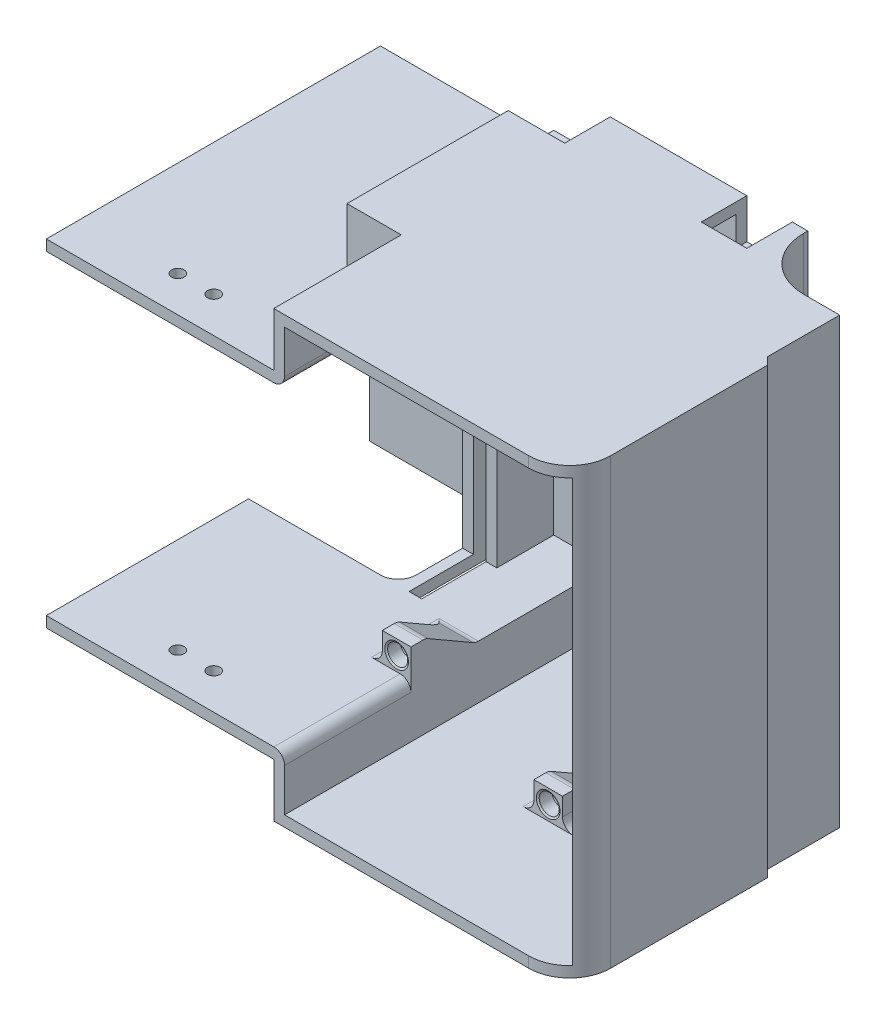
ISO-10303-21;
HEADER;
FILE_DESCRIPTION(('STEP AP214'),'2;1');
FILE_NAME('part.step','',(''),(''),'','','');
FILE_SCHEMA(('AUTOMOTIVE_DESIGN { 1 0 10303 214 1 1 1 1 }'));
ENDSEC;
DATA;
#1=APPLICATION_CONTEXT('core data for automotive mechanical design processes');
#2=APPLICATION_PROTOCOL_DEFINITION('international standard','automotive_design',2000,#1);
#3=PRODUCT_CONTEXT('',#1,'mechanical');
#4=PRODUCT('Part','Part','',(#3));
#5=PRODUCT_RELATED_PRODUCT_CATEGORY('part','',(#4));
#6=PRODUCT_DEFINITION_FORMATION('','',#4);
#7=PRODUCT_DEFINITION_CONTEXT('part definition',#1,'design');
#8=PRODUCT_DEFINITION('design','',#6,#7);
#9=PRODUCT_DEFINITION_SHAPE('','',#8);
#10=(LENGTH_UNIT() NAMED_UNIT(*) SI_UNIT(.MILLI.,.METRE.));
#11=(NAMED_UNIT(*) PLANE_ANGLE_UNIT() SI_UNIT($,.RADIAN.));
#12=(NAMED_UNIT(*) SI_UNIT($,.STERADIAN.) SOLID_ANGLE_UNIT());
#13=UNCERTAINTY_MEASURE_WITH_UNIT(LENGTH_MEASURE(1.E-05),#10,'distance_accuracy_value','');
#14=(GEOMETRIC_REPRESENTATION_CONTEXT(3) GLOBAL_UNCERTAINTY_ASSIGNED_CONTEXT((#13)) GLOBAL_UNIT_ASSIGNED_CONTEXT((#10,
#11,#12)) REPRESENTATION_CONTEXT('',''));
#15=CARTESIAN_POINT('',(0.,0.,0.));
#16=DIRECTION('',(0.,0.,1.));
#17=DIRECTION('',(1.,0.,0.));
#18=AXIS2_PLACEMENT_3D('',#15,#16,#17);
#19=CARTESIAN_POINT('',(0.,-58.9125,-240.705250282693));
#20=DIRECTION('',(0.,-1.,0.));
#21=DIRECTION('',(0.,0.,1.));
#22=AXIS2_PLACEMENT_3D('',#19,#20,#21);
#23=PLANE('',#22);
#24=DIRECTION('',(0.,0.,-1.));
#25=VECTOR('',#24,1.);
#26=CARTESIAN_POINT('',(111.775,-58.9125,110.775));
#27=LINE('',#26,#25);
#28=CARTESIAN_POINT('',(111.775,-58.9125,91.9711524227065));
#29=VERTEX_POINT('',#28);
#30=CARTESIAN_POINT('',(111.775,-58.9125,110.775));
#31=VERTEX_POINT('',#30);
#32=EDGE_CURVE('E703',#29,#31,#27,.F.);
#33=ORIENTED_EDGE('',*,*,#32,.T.);
#34=DIRECTION('',(1.,0.,0.));
#35=VECTOR('',#34,1.);
#36=CARTESIAN_POINT('',(100.775,-58.9125,110.775));
#37=LINE('',#36,#35);
#38=CARTESIAN_POINT('',(97.775,-58.9125,110.775));
#39=VERTEX_POINT('',#38);
#40=EDGE_CURVE('E766',#39,#31,#37,.T.);
#41=ORIENTED_EDGE('',*,*,#40,.F.);
#42=DIRECTION('',(0.,0.,1.));
#43=VECTOR('',#42,1.);
#44=CARTESIAN_POINT('',(97.775,-58.9125,92.7749999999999));
#45=LINE('',#44,#43);
#46=CARTESIAN_POINT('',(97.775,-58.9125,91.9711524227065));
#47=VERTEX_POINT('',#46);
#48=EDGE_CURVE('E707',#39,#47,#45,.F.);
#49=ORIENTED_EDGE('',*,*,#48,.T.);
#50=DIRECTION('',(-1.,0.,0.));
#51=VECTOR('',#50,1.);
#52=CARTESIAN_POINT('',(108.775,-58.9125,91.9711524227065));
#53=LINE('',#52,#51);
#54=EDGE_CURVE('E849',#47,#29,#53,.F.);
#55=ORIENTED_EDGE('',*,*,#54,.T.);
#56=EDGE_LOOP('',(#33,#41,#49,#55));
#57=FACE_BOUND('',#56,.T.);
#58=DIRECTION('',(-1.,0.,0.));
#59=VECTOR('',#58,1.);
#60=CARTESIAN_POINT('',(66.5,-58.9125,58.832));
#61=LINE('',#60,#59);
#62=CARTESIAN_POINT('',(102.235,-58.9125,58.832));
#63=VERTEX_POINT('',#62);
#64=CARTESIAN_POINT('',(66.5,-58.9125,58.832));
#65=VERTEX_POINT('',#64);
#66=EDGE_CURVE('E691',#63,#65,#61,.T.);
#67=ORIENTED_EDGE('',*,*,#66,.T.);
#68=DIRECTION('',(0.,0.,1.));
#69=VECTOR('',#68,1.);
#70=CARTESIAN_POINT('',(66.5,-58.9125,-240.705250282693));
#71=LINE('',#70,#69);
#72=CARTESIAN_POINT('',(66.5,-58.9125,146.05));
#73=VERTEX_POINT('',#72);
#74=EDGE_CURVE('E1192',#65,#73,#71,.T.);
#75=ORIENTED_EDGE('',*,*,#74,.T.);
#76=DIRECTION('',(-1.,0.,0.));
#77=VECTOR('',#76,1.);
#78=CARTESIAN_POINT('',(0.,-58.9125,146.05));
#79=LINE('',#78,#77);
#80=CARTESIAN_POINT('',(134.62,-58.9125,146.05));
#81=VERTEX_POINT('',#80);
#82=EDGE_CURVE('E1962',#81,#73,#79,.T.);
#83=ORIENTED_EDGE('',*,*,#82,.F.);
#84=CARTESIAN_POINT('',(134.62,-58.9125,134.62));
#85=DIRECTION('',(0.,1.,0.));
#86=DIRECTION('',(0.,0.,1.));
#87=AXIS2_PLACEMENT_3D('',#84,#85,#86);
#88=CIRCLE('',#87,11.43);
#89=CARTESIAN_POINT('',(143.05,-58.9125,142.338808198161));
#90=VERTEX_POINT('',#89);
#91=EDGE_CURVE('E1929',#90,#81,#88,.F.);
#92=ORIENTED_EDGE('',*,*,#91,.F.);
#93=DIRECTION('',(0.,0.,1.));
#94=VECTOR('',#93,1.);
#95=CARTESIAN_POINT('',(143.05,-58.9125,-240.705250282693));
#96=LINE('',#95,#94);
#97=CARTESIAN_POINT('',(143.05,-58.9125,71.707));
#98=VERTEX_POINT('',#97);
#99=EDGE_CURVE('E1249',#98,#90,#96,.T.);
#100=ORIENTED_EDGE('',*,*,#99,.F.);
#101=DIRECTION('',(-1.,0.,0.));
#102=VECTOR('',#101,1.);
#103=CARTESIAN_POINT('',(0.,-58.9125,71.707));
#104=LINE('',#103,#102);
#105=CARTESIAN_POINT('',(133.985,-58.9125,71.707));
#106=VERTEX_POINT('',#105);
#107=EDGE_CURVE('E709',#98,#106,#104,.T.);
#108=ORIENTED_EDGE('',*,*,#107,.T.);
#109=CARTESIAN_POINT('',(133.985,-58.9125,53.975));
#110=DIRECTION('',(0.,1.,0.));
#111=DIRECTION('',(-1.,0.,0.));
#112=AXIS2_PLACEMENT_3D('',#109,#110,#111);
#113=CIRCLE('',#112,17.732);
#114=CARTESIAN_POINT('',(119.253,-58.9125,63.8437385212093));
#115=VERTEX_POINT('',#114);
#116=EDGE_CURVE('E1013',#115,#106,#113,.T.);
#117=ORIENTED_EDGE('',*,*,#116,.F.);
#118=DIRECTION('',(0.,0.,1.));
#119=VECTOR('',#118,1.);
#120=CARTESIAN_POINT('',(119.253,-58.9125,-83.146503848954));
#121=LINE('',#120,#119);
#122=CARTESIAN_POINT('',(119.253,-58.9125,59.832));
#123=VERTEX_POINT('',#122);
#124=EDGE_CURVE('E713',#123,#115,#121,.T.);
#125=ORIENTED_EDGE('',*,*,#124,.F.);
#126=DIRECTION('',(1.,0.,0.));
#127=VECTOR('',#126,1.);
#128=CARTESIAN_POINT('',(0.,-58.9125,59.832));
#129=LINE('',#128,#127);
#130=CARTESIAN_POINT('',(117.935,-58.9125,59.832));
#131=VERTEX_POINT('',#130);
#132=EDGE_CURVE('E1190',#131,#123,#129,.T.);
#133=ORIENTED_EDGE('',*,*,#132,.F.);
#134=CARTESIAN_POINT('',(117.935,-58.9125,62.832));
#135=DIRECTION('',(0.,-1.,0.));
#136=DIRECTION('',(0.,0.,-1.));
#137=AXIS2_PLACEMENT_3D('',#134,#135,#136);
#138=CIRCLE('',#137,3.);
#139=CARTESIAN_POINT('',(114.935,-58.9125,62.832));
#140=VERTEX_POINT('',#139);
#141=EDGE_CURVE('E2260',#131,#140,#138,.F.);
#142=ORIENTED_EDGE('',*,*,#141,.T.);
#143=DIRECTION('',(0.,0.,1.));
#144=VECTOR('',#143,1.);
#145=CARTESIAN_POINT('',(114.935,-58.9125,52.832));
#146=LINE('',#145,#144);
#147=CARTESIAN_POINT('',(114.935,-58.9125,65.532));
#148=VERTEX_POINT('',#147);
#149=EDGE_CURVE('E704',#140,#148,#146,.T.);
#150=ORIENTED_EDGE('',*,*,#149,.T.);
#151=DIRECTION('',(1.,0.,0.));
#152=VECTOR('',#151,1.);
#153=CARTESIAN_POINT('',(0.,-58.9125,65.532));
#154=LINE('',#153,#152);
#155=CARTESIAN_POINT('',(102.235,-58.9125,65.532));
#156=VERTEX_POINT('',#155);
#157=EDGE_CURVE('E702',#156,#148,#154,.T.);
#158=ORIENTED_EDGE('',*,*,#157,.F.);
#159=DIRECTION('',(0.,0.,-1.));
#160=VECTOR('',#159,1.);
#161=CARTESIAN_POINT('',(102.235,-58.9125,52.832));
#162=LINE('',#161,#160);
#163=EDGE_CURVE('E687',#156,#63,#162,.T.);
#164=ORIENTED_EDGE('',*,*,#163,.T.);
#165=EDGE_LOOP('',(#67,#75,#83,#92,#100,#108,#117,#125,#133,#142,#150,#158,#164));
#166=FACE_BOUND('',#165,.T.);
#167=ADVANCED_FACE('F35',(#57,#166),#23,.F.);
#168=CARTESIAN_POINT('',(146.05,-61.9125,50.8));
#169=DIRECTION('',(0.,-1.,0.));
#170=DIRECTION('',(0.,0.,1.));
#171=AXIS2_PLACEMENT_3D('',#168,#169,#170);
#172=PLANE('',#171);
#173=DIRECTION('',(0.,0.,1.));
#174=VECTOR('',#173,1.);
#175=CARTESIAN_POINT('',(64.135,-61.9125,50.8));
#176=LINE('',#175,#174);
#177=CARTESIAN_POINT('',(64.135,-61.9125,55.832));
#178=VERTEX_POINT('',#177);
#179=CARTESIAN_POINT('',(64.135,-61.9125,65.532));
#180=VERTEX_POINT('',#179);
#181=EDGE_CURVE('E1117',#178,#180,#176,.T.);
#182=ORIENTED_EDGE('',*,*,#181,.F.);
#183=DIRECTION('',(-1.,0.,0.));
#184=VECTOR('',#183,1.);
#185=CARTESIAN_POINT('',(102.235,-61.9125,55.832));
#186=LINE('',#185,#184);
#187=CARTESIAN_POINT('',(102.235,-61.9125,55.832));
#188=VERTEX_POINT('',#187);
#189=EDGE_CURVE('E1182',#188,#178,#186,.T.);
#190=ORIENTED_EDGE('',*,*,#189,.F.);
#191=DIRECTION('',(0.,0.,1.));
#192=VECTOR('',#191,1.);
#193=CARTESIAN_POINT('',(102.235,-61.9125,50.8));
#194=LINE('',#193,#192);
#195=CARTESIAN_POINT('',(102.235,-61.9125,65.532));
#196=VERTEX_POINT('',#195);
#197=EDGE_CURVE('E1093',#196,#188,#194,.F.);
#198=ORIENTED_EDGE('',*,*,#197,.F.);
#199=DIRECTION('',(1.,0.,0.));
#200=VECTOR('',#199,1.);
#201=CARTESIAN_POINT('',(146.05,-61.9125,65.532));
#202=LINE('',#201,#200);
#203=CARTESIAN_POINT('',(114.935,-61.9125,65.532));
#204=VERTEX_POINT('',#203);
#205=EDGE_CURVE('E1094',#204,#196,#202,.F.);
#206=ORIENTED_EDGE('',*,*,#205,.F.);
#207=DIRECTION('',(0.,0.,1.));
#208=VECTOR('',#207,1.);
#209=CARTESIAN_POINT('',(114.935,-61.9125,50.8));
#210=LINE('',#209,#208);
#211=CARTESIAN_POINT('',(114.935,-61.9125,62.832));
#212=VERTEX_POINT('',#211);
#213=EDGE_CURVE('E1090',#212,#204,#210,.T.);
#214=ORIENTED_EDGE('',*,*,#213,.F.);
#215=CARTESIAN_POINT('',(117.935,-61.9125,62.832));
#216=DIRECTION('',(0.,-1.,0.));
#217=DIRECTION('',(0.,0.,-1.));
#218=AXIS2_PLACEMENT_3D('',#215,#216,#217);
#219=CIRCLE('',#218,3.);
#220=CARTESIAN_POINT('',(117.935,-61.9125,59.832));
#221=VERTEX_POINT('',#220);
#222=EDGE_CURVE('E1434',#212,#221,#219,.T.);
#223=ORIENTED_EDGE('',*,*,#222,.T.);
#224=DIRECTION('',(1.,0.,0.));
#225=VECTOR('',#224,1.);
#226=CARTESIAN_POINT('',(146.05,-61.9125,59.832));
#227=LINE('',#226,#225);
#228=CARTESIAN_POINT('',(119.825996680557,-61.9125,59.832));
#229=VERTEX_POINT('',#228);
#230=EDGE_CURVE('E872',#221,#229,#227,.T.);
#231=ORIENTED_EDGE('',*,*,#230,.T.);
#232=CARTESIAN_POINT('',(119.825996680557,-61.9125,60.832));
#233=DIRECTION('',(0.,-1.,0.));
#234=DIRECTION('',(0.,0.,-1.));
#235=AXIS2_PLACEMENT_3D('',#232,#233,#234);
#236=CIRCLE('',#235,1.);
#237=CARTESIAN_POINT('',(120.726009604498,-61.9125,60.3961367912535));
#238=VERTEX_POINT('',#237);
#239=EDGE_CURVE('E2273',#229,#238,#236,.T.);
#240=ORIENTED_EDGE('',*,*,#239,.T.);
#241=CARTESIAN_POINT('',(133.985,-61.9125,53.975));
#242=DIRECTION('',(0.,-1.,0.));
#243=DIRECTION('',(0.,0.,-1.));
#244=AXIS2_PLACEMENT_3D('',#241,#242,#243);
#245=CIRCLE('',#244,14.732);
#246=CARTESIAN_POINT('',(133.985,-61.9125,68.707));
#247=VERTEX_POINT('',#246);
#248=EDGE_CURVE('E966',#247,#238,#245,.T.);
#249=ORIENTED_EDGE('',*,*,#248,.F.);
#250=DIRECTION('',(1.,0.,0.));
#251=VECTOR('',#250,1.);
#252=CARTESIAN_POINT('',(146.05,-61.9125,68.707));
#253=LINE('',#252,#251);
#254=CARTESIAN_POINT('',(144.018,-61.9125,68.707));
#255=VERTEX_POINT('',#254);
#256=EDGE_CURVE('E2118',#255,#247,#253,.F.);
#257=ORIENTED_EDGE('',*,*,#256,.F.);
#258=DIRECTION('',(0.,0.,1.));
#259=VECTOR('',#258,1.);
#260=CARTESIAN_POINT('',(144.018,-61.9125,50.8));
#261=LINE('',#260,#259);
#262=CARTESIAN_POINT('',(144.018,-61.9125,88.9));
#263=VERTEX_POINT('',#262);
#264=EDGE_CURVE('E1083',#263,#255,#261,.F.);
#265=ORIENTED_EDGE('',*,*,#264,.F.);
#266=DIRECTION('',(1.,0.,0.));
#267=VECTOR('',#266,1.);
#268=CARTESIAN_POINT('',(146.05,-61.9125,88.9));
#269=LINE('',#268,#267);
#270=CARTESIAN_POINT('',(144.05,-61.9125,88.9));
#271=VERTEX_POINT('',#270);
#272=EDGE_CURVE('E1070',#271,#263,#269,.F.);
#273=ORIENTED_EDGE('',*,*,#272,.F.);
#274=DIRECTION('',(-0.707106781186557,0.,-0.707106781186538));
#275=VECTOR('',#274,1.);
#276=CARTESIAN_POINT('',(126.,-61.9125,70.8500000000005));
#277=LINE('',#276,#275);
#278=CARTESIAN_POINT('',(146.05,-61.9125,90.9));
#279=VERTEX_POINT('',#278);
#280=EDGE_CURVE('E1046',#279,#271,#277,.T.);
#281=ORIENTED_EDGE('',*,*,#280,.F.);
#282=DIRECTION('',(0.,0.,1.));
#283=VECTOR('',#282,1.);
#284=CARTESIAN_POINT('',(146.05,-61.9125,50.8));
#285=LINE('',#284,#283);
#286=CARTESIAN_POINT('',(146.05,-61.9125,134.62));
#287=VERTEX_POINT('',#286);
#288=EDGE_CURVE('E1074',#287,#279,#285,.F.);
#289=ORIENTED_EDGE('',*,*,#288,.F.);
#290=CARTESIAN_POINT('',(134.62,-61.9125,134.62));
#291=DIRECTION('',(0.,1.,0.));
#292=DIRECTION('',(0.,0.,1.));
#293=AXIS2_PLACEMENT_3D('',#290,#291,#292);
#294=CIRCLE('',#293,11.43);
#295=CARTESIAN_POINT('',(134.62,-61.9125,146.05));
#296=VERTEX_POINT('',#295);
#297=EDGE_CURVE('E1103',#287,#296,#294,.F.);
#298=ORIENTED_EDGE('',*,*,#297,.T.);
#299=DIRECTION('',(1.,0.,0.));
#300=VECTOR('',#299,1.);
#301=CARTESIAN_POINT('',(0.,-61.9125,146.05));
#302=LINE('',#301,#300);
#303=CARTESIAN_POINT('',(63.5,-61.9125,146.05));
#304=VERTEX_POINT('',#303);
#305=EDGE_CURVE('E1111',#296,#304,#302,.F.);
#306=ORIENTED_EDGE('',*,*,#305,.T.);
#307=DIRECTION('',(0.,0.,-1.));
#308=VECTOR('',#307,1.);
#309=CARTESIAN_POINT('',(63.5,-61.9125,146.05));
#310=LINE('',#309,#308);
#311=CARTESIAN_POINT('',(63.5,-61.9125,110.49));
#312=VERTEX_POINT('',#311);
#313=EDGE_CURVE('E2059',#312,#304,#310,.F.);
#314=ORIENTED_EDGE('',*,*,#313,.F.);
#315=DIRECTION('',(1.,0.,0.));
#316=VECTOR('',#315,1.);
#317=CARTESIAN_POINT('',(146.05,-61.9125,110.49));
#318=LINE('',#317,#316);
#319=CARTESIAN_POINT('',(48.375,-61.9125,110.49));
#320=VERTEX_POINT('',#319);
#321=EDGE_CURVE('E1100',#320,#312,#318,.T.);
#322=ORIENTED_EDGE('',*,*,#321,.F.);
#323=DIRECTION('',(0.,0.,-1.));
#324=VECTOR('',#323,1.);
#325=CARTESIAN_POINT('',(48.375,-61.9125,50.8));
#326=LINE('',#325,#324);
#327=CARTESIAN_POINT('',(48.375,-61.9125,65.532));
#328=VERTEX_POINT('',#327);
#329=EDGE_CURVE('E1933',#320,#328,#326,.T.);
#330=ORIENTED_EDGE('',*,*,#329,.T.);
#331=DIRECTION('',(1.,0.,0.));
#332=VECTOR('',#331,1.);
#333=CARTESIAN_POINT('',(146.05,-61.9125,65.532));
#334=LINE('',#333,#332);
#335=EDGE_CURVE('E1120',#180,#328,#334,.F.);
#336=ORIENTED_EDGE('',*,*,#335,.F.);
#337=EDGE_LOOP('',(#182,#190,#198,#206,#214,#223,#231,#240,#249,#257,#265,#273,#281,#289,#298,
#306,#314,#322,#330,#336));
#338=FACE_BOUND('',#337,.T.);
#339=ADVANCED_FACE('F1497',(#338),#172,.T.);
#340=CARTESIAN_POINT('',(102.235,-50.8,52.832));
#341=DIRECTION('',(-1.,0.,0.));
#342=DIRECTION('',(0.,0.,1.));
#343=AXIS2_PLACEMENT_3D('',#340,#341,#342);
#344=PLANE('',#343);
#345=DIRECTION('',(0.,-1.,0.));
#346=VECTOR('',#345,1.);
#347=CARTESIAN_POINT('',(102.235,-50.8,55.832));
#348=LINE('',#347,#346);
#349=CARTESIAN_POINT('',(102.235,-50.8,55.832));
#350=VERTEX_POINT('',#349);
#351=EDGE_CURVE('E1165',#350,#188,#348,.T.);
#352=ORIENTED_EDGE('',*,*,#351,.F.);
#353=DIRECTION('',(0.,0.,1.));
#354=VECTOR('',#353,1.);
#355=CARTESIAN_POINT('',(102.235,-50.8,52.832));
#356=LINE('',#355,#354);
#357=CARTESIAN_POINT('',(102.235,-50.8,56.832));
#358=VERTEX_POINT('',#357);
#359=EDGE_CURVE('E51',#350,#358,#356,.T.);
#360=ORIENTED_EDGE('',*,*,#359,.T.);
#361=DIRECTION('',(0.,-1.,0.));
#362=VECTOR('',#361,1.);
#363=CARTESIAN_POINT('',(102.235,-50.8,56.832));
#364=LINE('',#363,#362);
#365=CARTESIAN_POINT('',(102.235,-49.5128466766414,56.832));
#366=VERTEX_POINT('',#365);
#367=EDGE_CURVE('E1146',#358,#366,#364,.F.);
#368=ORIENTED_EDGE('',*,*,#367,.T.);
#369=DIRECTION('',(0.,0.,-1.));
#370=VECTOR('',#369,1.);
#371=CARTESIAN_POINT('',(102.235,-49.5128466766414,58.832));
#372=LINE('',#371,#370);
#373=CARTESIAN_POINT('',(102.235,-49.5128466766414,57.832));
#374=VERTEX_POINT('',#373);
#375=EDGE_CURVE('E1177',#374,#366,#372,.T.);
#376=ORIENTED_EDGE('',*,*,#375,.F.);
#377=CARTESIAN_POINT('',(102.235,-50.5128466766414,57.832));
#378=DIRECTION('',(-1.,0.,0.));
#379=DIRECTION('',(0.,0.,1.));
#380=AXIS2_PLACEMENT_3D('',#377,#378,#379);
#381=CIRCLE('',#380,1.);
#382=CARTESIAN_POINT('',(102.235,-50.5128466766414,58.832));
#383=VERTEX_POINT('',#382);
#384=EDGE_CURVE('E690',#374,#383,#381,.F.);
#385=ORIENTED_EDGE('',*,*,#384,.T.);
#386=DIRECTION('',(0.,-1.,0.));
#387=VECTOR('',#386,1.);
#388=CARTESIAN_POINT('',(102.235,-58.9125,58.832));
#389=LINE('',#388,#387);
#390=EDGE_CURVE('E682',#383,#63,#389,.T.);
#391=ORIENTED_EDGE('',*,*,#390,.T.);
#392=ORIENTED_EDGE('',*,*,#163,.F.);
#393=DIRECTION('',(0.,-1.,0.));
#394=VECTOR('',#393,1.);
#395=CARTESIAN_POINT('',(102.235,-50.8,65.532));
#396=LINE('',#395,#394);
#397=EDGE_CURVE('E1091',#156,#196,#396,.T.);
#398=ORIENTED_EDGE('',*,*,#397,.T.);
#399=ORIENTED_EDGE('',*,*,#197,.T.);
#400=EDGE_LOOP('',(#352,#360,#368,#376,#385,#391,#392,#398,#399));
#401=FACE_BOUND('',#400,.T.);
#402=ADVANCED_FACE('F684',(#401),#344,.F.);
#403=CARTESIAN_POINT('',(64.135,-61.9125,52.832));
#404=DIRECTION('',(1.,0.,0.));
#405=DIRECTION('',(0.,0.,-1.));
#406=AXIS2_PLACEMENT_3D('',#403,#404,#405);
#407=PLANE('',#406);
#408=DIRECTION('',(0.,1.,0.));
#409=VECTOR('',#408,1.);
#410=CARTESIAN_POINT('',(64.135,-50.8,55.832));
#411=LINE('',#410,#409);
#412=CARTESIAN_POINT('',(64.135,-50.8,55.832));
#413=VERTEX_POINT('',#412);
#414=EDGE_CURVE('E1184',#178,#413,#411,.T.);
#415=ORIENTED_EDGE('',*,*,#414,.F.);
#416=ORIENTED_EDGE('',*,*,#181,.T.);
#417=DIRECTION('',(0.,-1.,0.));
#418=VECTOR('',#417,1.);
#419=CARTESIAN_POINT('',(64.135,74.295,65.532));
#420=LINE('',#419,#418);
#421=CARTESIAN_POINT('',(64.135,-50.8,65.532));
#422=VERTEX_POINT('',#421);
#423=EDGE_CURVE('E1114',#180,#422,#420,.F.);
#424=ORIENTED_EDGE('',*,*,#423,.T.);
#425=DIRECTION('',(0.,0.,-1.));
#426=VECTOR('',#425,1.);
#427=CARTESIAN_POINT('',(64.135,-50.8,52.832));
#428=LINE('',#427,#426);
#429=EDGE_CURVE('E1136',#422,#413,#428,.T.);
#430=ORIENTED_EDGE('',*,*,#429,.T.);
#431=EDGE_LOOP('',(#415,#416,#424,#430));
#432=FACE_BOUND('',#431,.T.);
#433=ADVANCED_FACE('F1488',(#432),#407,.F.);
#434=CARTESIAN_POINT('',(114.935,-61.9125,52.832));
#435=DIRECTION('',(1.,0.,0.));
#436=DIRECTION('',(0.,0.,-1.));
#437=AXIS2_PLACEMENT_3D('',#434,#435,#436);
#438=PLANE('',#437);
#439=ORIENTED_EDGE('',*,*,#149,.F.);
#440=DIRECTION('',(0.,1.,0.));
#441=VECTOR('',#440,1.);
#442=CARTESIAN_POINT('',(114.935,-61.9125,62.832));
#443=LINE('',#442,#441);
#444=EDGE_CURVE('E2271',#140,#212,#443,.F.);
#445=ORIENTED_EDGE('',*,*,#444,.T.);
#446=ORIENTED_EDGE('',*,*,#213,.T.);
#447=DIRECTION('',(0.,-1.,0.));
#448=VECTOR('',#447,1.);
#449=CARTESIAN_POINT('',(114.935,74.295,65.532));
#450=LINE('',#449,#448);
#451=EDGE_CURVE('E1087',#204,#148,#450,.F.);
#452=ORIENTED_EDGE('',*,*,#451,.T.);
#453=EDGE_LOOP('',(#439,#445,#446,#452));
#454=FACE_BOUND('',#453,.T.);
#455=ADVANCED_FACE('F1484',(#454),#438,.F.);
#456=CARTESIAN_POINT('',(0.,-43.99,-240.705250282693));
#457=DIRECTION('',(0.,-1.,0.));
#458=DIRECTION('',(0.,0.,1.));
#459=AXIS2_PLACEMENT_3D('',#456,#457,#458);
#460=PLANE('',#459);
#461=CARTESIAN_POINT('',(36.75,-43.99,136.05));
#462=DIRECTION('',(0.,-1.,0.));
#463=DIRECTION('',(0.,0.,-1.));
#464=AXIS2_PLACEMENT_3D('',#461,#462,#463);
#465=CIRCLE('',#464,1.75);
#466=CARTESIAN_POINT('',(36.75,-43.99,134.3));
#467=VERTEX_POINT('',#466);
#468=EDGE_CURVE('E845',#467,#467,#465,.T.);
#469=ORIENTED_EDGE('',*,*,#468,.T.);
#470=EDGE_LOOP('',(#469));
#471=FACE_BOUND('',#470,.T.);
#472=CARTESIAN_POINT('',(26.75,-43.99,136.05));
#473=DIRECTION('',(0.,-1.,0.));
#474=DIRECTION('',(0.,0.,-1.));
#475=AXIS2_PLACEMENT_3D('',#472,#473,#474);
#476=CIRCLE('',#475,1.75);
#477=CARTESIAN_POINT('',(26.75,-43.99,134.3));
#478=VERTEX_POINT('',#477);
#479=EDGE_CURVE('E848',#478,#478,#476,.T.);
#480=ORIENTED_EDGE('',*,*,#479,.T.);
#481=EDGE_LOOP('',(#480));
#482=FACE_BOUND('',#481,.T.);
#483=DIRECTION('',(-1.,0.,0.));
#484=VECTOR('',#483,1.);
#485=CARTESIAN_POINT('',(0.,-43.99,89.65));
#486=LINE('',#485,#484);
#487=CARTESIAN_POINT('',(36.843,-43.99,89.65));
#488=VERTEX_POINT('',#487);
#489=CARTESIAN_POINT('',(0.0500000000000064,-43.99,89.65));
#490=VERTEX_POINT('',#489);
#491=EDGE_CURVE('E862',#488,#490,#486,.T.);
#492=ORIENTED_EDGE('',*,*,#491,.T.);
#493=DIRECTION('',(0.,0.,1.));
#494=VECTOR('',#493,1.);
#495=CARTESIAN_POINT('',(0.0500000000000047,-43.99,-240.705250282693));
#496=LINE('',#495,#494);
#497=CARTESIAN_POINT('',(0.0500000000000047,-43.99,146.05));
#498=VERTEX_POINT('',#497);
#499=EDGE_CURVE('E894',#490,#498,#496,.T.);
#500=ORIENTED_EDGE('',*,*,#499,.T.);
#501=DIRECTION('',(-1.,0.,0.));
#502=VECTOR('',#501,1.);
#503=CARTESIAN_POINT('',(0.,-43.99,146.05));
#504=LINE('',#503,#502);
#505=CARTESIAN_POINT('',(63.5,-43.99,146.05));
#506=VERTEX_POINT('',#505);
#507=EDGE_CURVE('E921',#506,#498,#504,.T.);
#508=ORIENTED_EDGE('',*,*,#507,.F.);
#509=DIRECTION('',(0.,0.,1.));
#510=VECTOR('',#509,1.);
#511=CARTESIAN_POINT('',(63.5,-43.99,-240.705250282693));
#512=LINE('',#511,#510);
#513=CARTESIAN_POINT('',(63.5,-43.99,110.775));
#514=VERTEX_POINT('',#513);
#515=EDGE_CURVE('E897',#506,#514,#512,.F.);
#516=ORIENTED_EDGE('',*,*,#515,.T.);
#517=DIRECTION('',(1.,0.,0.));
#518=VECTOR('',#517,1.);
#519=CARTESIAN_POINT('',(66.5,-43.99,110.775));
#520=LINE('',#519,#518);
#521=CARTESIAN_POINT('',(55.5,-43.99,110.775));
#522=VERTEX_POINT('',#521);
#523=EDGE_CURVE('E743',#522,#514,#520,.T.);
#524=ORIENTED_EDGE('',*,*,#523,.F.);
#525=DIRECTION('',(0.,0.,1.));
#526=VECTOR('',#525,1.);
#527=CARTESIAN_POINT('',(55.5,-43.99,92.7749999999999));
#528=LINE('',#527,#526);
#529=CARTESIAN_POINT('',(55.5,-43.99,91.9711524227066));
#530=VERTEX_POINT('',#529);
#531=EDGE_CURVE('E1358',#522,#530,#528,.F.);
#532=ORIENTED_EDGE('',*,*,#531,.T.);
#533=DIRECTION('',(-1.,0.,0.));
#534=VECTOR('',#533,1.);
#535=CARTESIAN_POINT('',(66.5,-43.99,91.9711524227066));
#536=LINE('',#535,#534);
#537=CARTESIAN_POINT('',(66.5,-43.99,91.9711524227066));
#538=VERTEX_POINT('',#537);
#539=EDGE_CURVE('E721',#530,#538,#536,.F.);
#540=ORIENTED_EDGE('',*,*,#539,.T.);
#541=DIRECTION('',(0.,0.,1.));
#542=VECTOR('',#541,1.);
#543=CARTESIAN_POINT('',(66.5,-43.99,-240.705250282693));
#544=LINE('',#543,#542);
#545=CARTESIAN_POINT('',(66.5,-43.99,55.832));
#546=VERTEX_POINT('',#545);
#547=EDGE_CURVE('E1336',#546,#538,#544,.T.);
#548=ORIENTED_EDGE('',*,*,#547,.F.);
#549=DIRECTION('',(1.,0.,0.));
#550=VECTOR('',#549,1.);
#551=CARTESIAN_POINT('',(0.,-43.99,55.832));
#552=LINE('',#551,#550);
#553=CARTESIAN_POINT('',(51.375,-43.99,55.832));
#554=VERTEX_POINT('',#553);
#555=EDGE_CURVE('E722',#554,#546,#552,.T.);
#556=ORIENTED_EDGE('',*,*,#555,.F.);
#557=DIRECTION('',(0.,0.,1.));
#558=VECTOR('',#557,1.);
#559=CARTESIAN_POINT('',(51.375,-43.99,-83.146503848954));
#560=LINE('',#559,#558);
#561=CARTESIAN_POINT('',(51.375,-43.99,71.707));
#562=VERTEX_POINT('',#561);
#563=EDGE_CURVE('E717',#554,#562,#560,.T.);
#564=ORIENTED_EDGE('',*,*,#563,.T.);
#565=DIRECTION('',(-1.,0.,0.));
#566=VECTOR('',#565,1.);
#567=CARTESIAN_POINT('',(0.,-43.99,71.707));
#568=LINE('',#567,#566);
#569=CARTESIAN_POINT('',(48.375,-43.99,71.707));
#570=VERTEX_POINT('',#569);
#571=EDGE_CURVE('E720',#562,#570,#568,.T.);
#572=ORIENTED_EDGE('',*,*,#571,.T.);
#573=DIRECTION('',(0.,0.,1.));
#574=VECTOR('',#573,1.);
#575=CARTESIAN_POINT('',(48.375,-43.99,0.));
#576=LINE('',#575,#574);
#577=CARTESIAN_POINT('',(48.375,-43.99,89.65));
#578=VERTEX_POINT('',#577);
#579=EDGE_CURVE('E919',#570,#578,#576,.T.);
#580=ORIENTED_EDGE('',*,*,#579,.T.);
#581=DIRECTION('',(1.,0.,0.));
#582=VECTOR('',#581,1.);
#583=CARTESIAN_POINT('',(0.,-43.99,89.65));
#584=LINE('',#583,#582);
#585=CARTESIAN_POINT('',(44.843,-43.99,89.65));
#586=VERTEX_POINT('',#585);
#587=EDGE_CURVE('E924',#586,#578,#584,.T.);
#588=ORIENTED_EDGE('',*,*,#587,.F.);
#589=DIRECTION('',(0.,0.,1.));
#590=VECTOR('',#589,1.);
#591=CARTESIAN_POINT('',(44.843,-43.99,0.));
#592=LINE('',#591,#590);
#593=CARTESIAN_POINT('',(44.843,-43.99,71.707));
#594=VERTEX_POINT('',#593);
#595=EDGE_CURVE('E941',#594,#586,#592,.T.);
#596=ORIENTED_EDGE('',*,*,#595,.F.);
#597=CARTESIAN_POINT('',(41.843,-43.99,71.707));
#598=VERTEX_POINT('',#597);
#599=EDGE_CURVE('E920',#594,#598,#568,.T.);
#600=ORIENTED_EDGE('',*,*,#599,.T.);
#601=DIRECTION('',(0.,0.,1.));
#602=VECTOR('',#601,1.);
#603=CARTESIAN_POINT('',(41.8429999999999,-43.99,-240.705250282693));
#604=LINE('',#603,#602);
#605=CARTESIAN_POINT('',(41.843,-43.99,84.65));
#606=VERTEX_POINT('',#605);
#607=EDGE_CURVE('E1367',#598,#606,#604,.T.);
#608=ORIENTED_EDGE('',*,*,#607,.T.);
#609=CARTESIAN_POINT('',(36.843,-43.99,84.65));
#610=DIRECTION('',(0.,-1.,0.));
#611=DIRECTION('',(0.,0.,-1.));
#612=AXIS2_PLACEMENT_3D('',#609,#610,#611);
#613=CIRCLE('',#612,5.);
#614=EDGE_CURVE('E1052',#606,#488,#613,.T.);
#615=ORIENTED_EDGE('',*,*,#614,.T.);
#616=EDGE_LOOP('',(#492,#500,#508,#516,#524,#532,#540,#548,#556,#564,#572,#580,#588,#596,#600,
#608,#615));
#617=FACE_BOUND('',#616,.T.);
#618=ADVANCED_FACE('F1487',(#471,#482,#617),#460,.F.);
#619=CARTESIAN_POINT('',(0.,0.,71.707));
#620=DIRECTION('',(0.,0.,-1.));
#621=DIRECTION('',(1.,0.,0.));
#622=AXIS2_PLACEMENT_3D('',#619,#620,#621);
#623=PLANE('',#622);
#624=DIRECTION('',(0.,1.,0.));
#625=VECTOR('',#624,1.);
#626=CARTESIAN_POINT('',(48.375,-61.9126030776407,71.707));
#627=LINE('',#626,#625);
#628=CARTESIAN_POINT('',(48.375,43.99,71.707));
#629=VERTEX_POINT('',#628);
#630=EDGE_CURVE('E1948',#570,#629,#627,.T.);
#631=ORIENTED_EDGE('',*,*,#630,.F.);
#632=ORIENTED_EDGE('',*,*,#571,.F.);
#633=DIRECTION('',(0.,1.,0.));
#634=VECTOR('',#633,1.);
#635=CARTESIAN_POINT('',(51.375,0.,71.707));
#636=LINE('',#635,#634);
#637=CARTESIAN_POINT('',(51.375,43.99,71.707));
#638=VERTEX_POINT('',#637);
#639=EDGE_CURVE('E910',#562,#638,#636,.T.);
#640=ORIENTED_EDGE('',*,*,#639,.T.);
#641=DIRECTION('',(-1.,0.,0.));
#642=VECTOR('',#641,1.);
#643=CARTESIAN_POINT('',(0.,43.99,71.707));
#644=LINE('',#643,#642);
#645=EDGE_CURVE('E906',#638,#629,#644,.T.);
#646=ORIENTED_EDGE('',*,*,#645,.T.);
#647=EDGE_LOOP('',(#631,#632,#640,#646));
#648=FACE_BOUND('',#647,.T.);
#649=ADVANCED_FACE('F1650',(#648),#623,.F.);
#650=CARTESIAN_POINT('',(114.935,50.8,52.832));
#651=DIRECTION('',(0.,-1.,0.));
#652=DIRECTION('',(0.,0.,-1.));
#653=AXIS2_PLACEMENT_3D('',#650,#651,#652);
#654=PLANE('',#653);
#655=DIRECTION('',(-1.,0.,0.));
#656=VECTOR('',#655,1.);
#657=CARTESIAN_POINT('',(114.935,50.8,55.832));
#658=LINE('',#657,#656);
#659=CARTESIAN_POINT('',(114.935,50.8,55.832));
#660=VERTEX_POINT('',#659);
#661=CARTESIAN_POINT('',(102.235,50.8,55.832));
#662=VERTEX_POINT('',#661);
#663=EDGE_CURVE('E1020',#660,#662,#658,.T.);
#664=ORIENTED_EDGE('',*,*,#663,.F.);
#665=DIRECTION('',(0.,0.,-1.));
#666=VECTOR('',#665,1.);
#667=CARTESIAN_POINT('',(114.935,50.8,52.832));
#668=LINE('',#667,#666);
#669=CARTESIAN_POINT('',(114.935,50.8,52.832));
#670=VERTEX_POINT('',#669);
#671=EDGE_CURVE('E909',#660,#670,#668,.T.);
#672=ORIENTED_EDGE('',*,*,#671,.T.);
#673=DIRECTION('',(1.,0.,0.));
#674=VECTOR('',#673,1.);
#675=CARTESIAN_POINT('',(45.593,50.8,52.832));
#676=LINE('',#675,#674);
#677=CARTESIAN_POINT('',(102.235,50.8,52.832));
#678=VERTEX_POINT('',#677);
#679=EDGE_CURVE('E1395',#670,#678,#676,.F.);
#680=ORIENTED_EDGE('',*,*,#679,.T.);
#681=DIRECTION('',(0.,0.,1.));
#682=VECTOR('',#681,1.);
#683=CARTESIAN_POINT('',(102.235,50.8,52.832));
#684=LINE('',#683,#682);
#685=EDGE_CURVE('E986',#678,#662,#684,.T.);
#686=ORIENTED_EDGE('',*,*,#685,.T.);
#687=EDGE_LOOP('',(#664,#672,#680,#686));
#688=FACE_BOUND('',#687,.T.);
#689=ADVANCED_FACE('F1653',(#688),#654,.F.);
#690=DIRECTION('',(0.,1.,0.));
#691=VECTOR('',#690,1.);
#692=CARTESIAN_POINT('',(41.843,0.,71.707));
#693=LINE('',#692,#691);
#694=CARTESIAN_POINT('',(41.843,43.99,71.707));
#695=VERTEX_POINT('',#694);
#696=EDGE_CURVE('E1041',#598,#695,#693,.T.);
#697=ORIENTED_EDGE('',*,*,#696,.F.);
#698=ORIENTED_EDGE('',*,*,#599,.F.);
#699=DIRECTION('',(0.,1.,0.));
#700=VECTOR('',#699,1.);
#701=CARTESIAN_POINT('',(44.843,-61.9126030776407,71.707));
#702=LINE('',#701,#700);
#703=CARTESIAN_POINT('',(44.843,43.99,71.707));
#704=VERTEX_POINT('',#703);
#705=EDGE_CURVE('E984',#594,#704,#702,.T.);
#706=ORIENTED_EDGE('',*,*,#705,.T.);
#707=EDGE_CURVE('E854',#704,#695,#644,.T.);
#708=ORIENTED_EDGE('',*,*,#707,.T.);
#709=EDGE_LOOP('',(#697,#698,#706,#708));
#710=FACE_BOUND('',#709,.T.);
#711=ADVANCED_FACE('F1656',(#710),#623,.F.);
#712=CARTESIAN_POINT('',(1.27,46.99,146.05));
#713=DIRECTION('',(0.,-1.,0.));
#714=DIRECTION('',(0.,0.,-1.));
#715=AXIS2_PLACEMENT_3D('',#712,#713,#714);
#716=PLANE('',#715);
#717=CARTESIAN_POINT('',(36.75,46.99,136.05));
#718=DIRECTION('',(0.,-1.,0.));
#719=DIRECTION('',(0.,0.,-1.));
#720=AXIS2_PLACEMENT_3D('',#717,#718,#719);
#721=CIRCLE('',#720,1.75);
#722=CARTESIAN_POINT('',(36.75,46.99,134.3));
#723=VERTEX_POINT('',#722);
#724=EDGE_CURVE('E850',#723,#723,#721,.T.);
#725=ORIENTED_EDGE('',*,*,#724,.T.);
#726=EDGE_LOOP('',(#725));
#727=FACE_BOUND('',#726,.T.);
#728=CARTESIAN_POINT('',(26.75,46.99,136.05));
#729=DIRECTION('',(0.,-1.,0.));
#730=DIRECTION('',(0.,0.,-1.));
#731=AXIS2_PLACEMENT_3D('',#728,#729,#730);
#732=CIRCLE('',#731,1.75);
#733=CARTESIAN_POINT('',(26.75,46.99,134.3));
#734=VERTEX_POINT('',#733);
#735=EDGE_CURVE('E853',#734,#734,#732,.T.);
#736=ORIENTED_EDGE('',*,*,#735,.T.);
#737=EDGE_LOOP('',(#736));
#738=FACE_BOUND('',#737,.T.);
#739=DIRECTION('',(1.,0.,0.));
#740=VECTOR('',#739,1.);
#741=CARTESIAN_POINT('',(48.375,46.99,52.832));
#742=LINE('',#741,#740);
#743=CARTESIAN_POINT('',(0.049999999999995,46.99,52.832));
#744=VERTEX_POINT('',#743);
#745=CARTESIAN_POINT('',(44.843,46.99,52.832));
#746=VERTEX_POINT('',#745);
#747=EDGE_CURVE('E891',#744,#746,#742,.T.);
#748=ORIENTED_EDGE('',*,*,#747,.F.);
#749=DIRECTION('',(0.,0.,1.));
#750=VECTOR('',#749,1.);
#751=CARTESIAN_POINT('',(0.0499999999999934,46.99,146.05));
#752=LINE('',#751,#750);
#753=CARTESIAN_POINT('',(0.0499999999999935,46.99,146.05));
#754=VERTEX_POINT('',#753);
#755=EDGE_CURVE('E865',#744,#754,#752,.T.);
#756=ORIENTED_EDGE('',*,*,#755,.T.);
#757=DIRECTION('',(1.,0.,0.));
#758=VECTOR('',#757,1.);
#759=CARTESIAN_POINT('',(0.,46.99,146.05));
#760=LINE('',#759,#758);
#761=CARTESIAN_POINT('',(63.5,46.99,146.05));
#762=VERTEX_POINT('',#761);
#763=EDGE_CURVE('E937',#762,#754,#760,.F.);
#764=ORIENTED_EDGE('',*,*,#763,.F.);
#765=DIRECTION('',(0.,0.,-1.));
#766=VECTOR('',#765,1.);
#767=CARTESIAN_POINT('',(63.5,46.99,146.05));
#768=LINE('',#767,#766);
#769=CARTESIAN_POINT('',(63.5,46.99,110.49));
#770=VERTEX_POINT('',#769);
#771=EDGE_CURVE('E943',#770,#762,#768,.F.);
#772=ORIENTED_EDGE('',*,*,#771,.F.);
#773=DIRECTION('',(1.,0.,0.));
#774=VECTOR('',#773,1.);
#775=CARTESIAN_POINT('',(1.27,46.99,110.49));
#776=LINE('',#775,#774);
#777=CARTESIAN_POINT('',(48.375,46.99,110.49));
#778=VERTEX_POINT('',#777);
#779=EDGE_CURVE('E1412',#778,#770,#776,.T.);
#780=ORIENTED_EDGE('',*,*,#779,.F.);
#781=DIRECTION('',(0.,0.,-1.));
#782=VECTOR('',#781,1.);
#783=CARTESIAN_POINT('',(48.375,46.99,146.050103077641));
#784=LINE('',#783,#782);
#785=CARTESIAN_POINT('',(48.375,46.99,89.65));
#786=VERTEX_POINT('',#785);
#787=EDGE_CURVE('E879',#778,#786,#784,.T.);
#788=ORIENTED_EDGE('',*,*,#787,.T.);
#789=DIRECTION('',(1.,0.,0.));
#790=VECTOR('',#789,1.);
#791=CARTESIAN_POINT('',(1.27,46.99,89.65));
#792=LINE('',#791,#790);
#793=CARTESIAN_POINT('',(44.843,46.99,89.65));
#794=VERTEX_POINT('',#793);
#795=EDGE_CURVE('E968',#794,#786,#792,.T.);
#796=ORIENTED_EDGE('',*,*,#795,.F.);
#797=DIRECTION('',(0.,0.,1.));
#798=VECTOR('',#797,1.);
#799=CARTESIAN_POINT('',(44.843,46.99,146.05));
#800=LINE('',#799,#798);
#801=EDGE_CURVE('E949',#746,#794,#800,.T.);
#802=ORIENTED_EDGE('',*,*,#801,.F.);
#803=EDGE_LOOP('',(#748,#756,#764,#772,#780,#788,#796,#802));
#804=FACE_BOUND('',#803,.T.);
#805=ADVANCED_FACE('F1685',(#727,#738,#804),#716,.F.);
#806=CARTESIAN_POINT('',(64.135,50.8,52.832));
#807=DIRECTION('',(0.,-1.,0.));
#808=DIRECTION('',(0.,0.,-1.));
#809=AXIS2_PLACEMENT_3D('',#806,#807,#808);
#810=PLANE('',#809);
#811=DIRECTION('',(1.,0.,0.));
#812=VECTOR('',#811,1.);
#813=CARTESIAN_POINT('',(45.593,50.8,52.832));
#814=LINE('',#813,#812);
#815=CARTESIAN_POINT('',(64.135,50.8,52.832));
#816=VERTEX_POINT('',#815);
#817=CARTESIAN_POINT('',(48.375,50.8,52.832));
#818=VERTEX_POINT('',#817);
#819=EDGE_CURVE('E963',#816,#818,#814,.F.);
#820=ORIENTED_EDGE('',*,*,#819,.T.);
#821=DIRECTION('',(0.,0.,1.));
#822=VECTOR('',#821,1.);
#823=CARTESIAN_POINT('',(48.375,50.8,52.832));
#824=LINE('',#823,#822);
#825=CARTESIAN_POINT('',(48.375,50.8,65.532));
#826=VERTEX_POINT('',#825);
#827=EDGE_CURVE('E959',#818,#826,#824,.T.);
#828=ORIENTED_EDGE('',*,*,#827,.T.);
#829=DIRECTION('',(-1.,0.,0.));
#830=VECTOR('',#829,1.);
#831=CARTESIAN_POINT('',(0.,50.8,65.532));
#832=LINE('',#831,#830);
#833=CARTESIAN_POINT('',(64.135,50.8,65.532));
#834=VERTEX_POINT('',#833);
#835=EDGE_CURVE('E2014',#834,#826,#832,.T.);
#836=ORIENTED_EDGE('',*,*,#835,.F.);
#837=DIRECTION('',(0.,0.,-1.));
#838=VECTOR('',#837,1.);
#839=CARTESIAN_POINT('',(64.135,50.8,52.832));
#840=LINE('',#839,#838);
#841=EDGE_CURVE('E962',#834,#816,#840,.T.);
#842=ORIENTED_EDGE('',*,*,#841,.T.);
#843=EDGE_LOOP('',(#820,#828,#836,#842));
#844=FACE_BOUND('',#843,.T.);
#845=ADVANCED_FACE('F1688',(#844),#810,.F.);
#846=CARTESIAN_POINT('',(119.253,-61.9125,50.8));
#847=DIRECTION('',(-1.,0.,0.));
#848=DIRECTION('',(0.,0.,1.));
#849=AXIS2_PLACEMENT_3D('',#846,#847,#848);
#850=PLANE('',#849);
#851=DIRECTION('',(0.,-1.,0.));
#852=VECTOR('',#851,1.);
#853=CARTESIAN_POINT('',(119.253,223.33077,53.975));
#854=LINE('',#853,#852);
#855=CARTESIAN_POINT('',(119.253,61.9125,53.975));
#856=VERTEX_POINT('',#855);
#857=CARTESIAN_POINT('',(119.253,-47.8,53.975));
#858=VERTEX_POINT('',#857);
#859=EDGE_CURVE('E1433',#856,#858,#854,.T.);
#860=ORIENTED_EDGE('',*,*,#859,.T.);
#861=DIRECTION('',(0.,0.,-1.));
#862=VECTOR('',#861,1.);
#863=CARTESIAN_POINT('',(119.253,-47.8,50.8));
#864=LINE('',#863,#862);
#865=CARTESIAN_POINT('',(119.253,-47.8,52.832));
#866=VERTEX_POINT('',#865);
#867=EDGE_CURVE('E1436',#858,#866,#864,.T.);
#868=ORIENTED_EDGE('',*,*,#867,.T.);
#869=DIRECTION('',(0.,1.,0.));
#870=VECTOR('',#869,1.);
#871=CARTESIAN_POINT('',(119.253,-74.295,52.832));
#872=LINE('',#871,#870);
#873=CARTESIAN_POINT('',(119.253,61.9125,52.832));
#874=VERTEX_POINT('',#873);
#875=EDGE_CURVE('E1029',#866,#874,#872,.T.);
#876=ORIENTED_EDGE('',*,*,#875,.T.);
#877=DIRECTION('',(0.,0.,1.));
#878=VECTOR('',#877,1.);
#879=CARTESIAN_POINT('',(119.253,61.9125,50.8));
#880=LINE('',#879,#878);
#881=EDGE_CURVE('E1387',#856,#874,#880,.F.);
#882=ORIENTED_EDGE('',*,*,#881,.F.);
#883=EDGE_LOOP('',(#860,#868,#876,#882));
#884=FACE_BOUND('',#883,.T.);
#885=ADVANCED_FACE('F1813',(#884),#850,.F.);
#886=CARTESIAN_POINT('',(114.935,61.9125,52.832));
#887=DIRECTION('',(1.,0.,0.));
#888=DIRECTION('',(0.,0.,-1.));
#889=AXIS2_PLACEMENT_3D('',#886,#887,#888);
#890=PLANE('',#889);
#891=DIRECTION('',(0.,-1.,0.));
#892=VECTOR('',#891,1.);
#893=CARTESIAN_POINT('',(114.935,61.9125,55.832));
#894=LINE('',#893,#892);
#895=CARTESIAN_POINT('',(114.935,58.9125,55.832));
#896=VERTEX_POINT('',#895);
#897=EDGE_CURVE('E729',#896,#660,#894,.T.);
#898=ORIENTED_EDGE('',*,*,#897,.F.);
#899=DIRECTION('',(0.,0.,1.));
#900=VECTOR('',#899,1.);
#901=CARTESIAN_POINT('',(114.935,58.9125,52.832));
#902=LINE('',#901,#900);
#903=CARTESIAN_POINT('',(114.935,58.9125,65.532));
#904=VERTEX_POINT('',#903);
#905=EDGE_CURVE('E1025',#896,#904,#902,.T.);
#906=ORIENTED_EDGE('',*,*,#905,.T.);
#907=DIRECTION('',(0.,1.,0.));
#908=VECTOR('',#907,1.);
#909=CARTESIAN_POINT('',(114.935,-74.295,65.532));
#910=LINE('',#909,#908);
#911=CARTESIAN_POINT('',(114.935,61.9125,65.532));
#912=VERTEX_POINT('',#911);
#913=EDGE_CURVE('E1038',#912,#904,#910,.F.);
#914=ORIENTED_EDGE('',*,*,#913,.F.);
#915=DIRECTION('',(0.,0.,1.));
#916=VECTOR('',#915,1.);
#917=CARTESIAN_POINT('',(114.935,61.9125,50.8));
#918=LINE('',#917,#916);
#919=CARTESIAN_POINT('',(114.935,61.9125,52.832));
#920=VERTEX_POINT('',#919);
#921=EDGE_CURVE('E1425',#920,#912,#918,.T.);
#922=ORIENTED_EDGE('',*,*,#921,.F.);
#923=DIRECTION('',(0.,1.,0.));
#924=VECTOR('',#923,1.);
#925=CARTESIAN_POINT('',(114.935,-74.295,52.832));
#926=LINE('',#925,#924);
#927=EDGE_CURVE('E1028',#920,#670,#926,.F.);
#928=ORIENTED_EDGE('',*,*,#927,.T.);
#929=ORIENTED_EDGE('',*,*,#671,.F.);
#930=EDGE_LOOP('',(#898,#906,#914,#922,#928,#929));
#931=FACE_BOUND('',#930,.T.);
#932=ADVANCED_FACE('F1817',(#931),#890,.F.);
#933=CARTESIAN_POINT('',(0.,-74.295,65.532));
#934=DIRECTION('',(0.,0.,-1.));
#935=DIRECTION('',(-1.,0.,0.));
#936=AXIS2_PLACEMENT_3D('',#933,#934,#935);
#937=PLANE('',#936);
#938=DIRECTION('',(1.,0.,0.));
#939=VECTOR('',#938,1.);
#940=CARTESIAN_POINT('',(0.,58.9125,65.532));
#941=LINE('',#940,#939);
#942=CARTESIAN_POINT('',(102.235,58.9125,65.532));
#943=VERTEX_POINT('',#942);
#944=EDGE_CURVE('E1030',#943,#904,#941,.T.);
#945=ORIENTED_EDGE('',*,*,#944,.F.);
#946=DIRECTION('',(0.,1.,0.));
#947=VECTOR('',#946,1.);
#948=CARTESIAN_POINT('',(102.235,50.8,65.532));
#949=LINE('',#948,#947);
#950=CARTESIAN_POINT('',(102.235,61.9125,65.532));
#951=VERTEX_POINT('',#950);
#952=EDGE_CURVE('E1398',#943,#951,#949,.T.);
#953=ORIENTED_EDGE('',*,*,#952,.T.);
#954=DIRECTION('',(1.,0.,0.));
#955=VECTOR('',#954,1.);
#956=CARTESIAN_POINT('',(146.05,61.9125,65.532));
#957=LINE('',#956,#955);
#958=EDGE_CURVE('E2100',#912,#951,#957,.F.);
#959=ORIENTED_EDGE('',*,*,#958,.F.);
#960=ORIENTED_EDGE('',*,*,#913,.T.);
#961=EDGE_LOOP('',(#945,#953,#959,#960));
#962=FACE_BOUND('',#961,.T.);
#963=ADVANCED_FACE('F1821',(#962),#937,.T.);
#964=CARTESIAN_POINT('',(102.235,50.8,52.832));
#965=DIRECTION('',(-1.,0.,0.));
#966=DIRECTION('',(0.,0.,1.));
#967=AXIS2_PLACEMENT_3D('',#964,#965,#966);
#968=PLANE('',#967);
#969=ORIENTED_EDGE('',*,*,#952,.F.);
#970=DIRECTION('',(0.,0.,-1.));
#971=VECTOR('',#970,1.);
#972=CARTESIAN_POINT('',(102.235,58.9125,52.832));
#973=LINE('',#972,#971);
#974=CARTESIAN_POINT('',(102.235,58.9125,55.832));
#975=VERTEX_POINT('',#974);
#976=EDGE_CURVE('E1034',#943,#975,#973,.T.);
#977=ORIENTED_EDGE('',*,*,#976,.T.);
#978=DIRECTION('',(0.,1.,0.));
#979=VECTOR('',#978,1.);
#980=CARTESIAN_POINT('',(102.235,50.8,55.832));
#981=LINE('',#980,#979);
#982=EDGE_CURVE('E1022',#662,#975,#981,.T.);
#983=ORIENTED_EDGE('',*,*,#982,.F.);
#984=ORIENTED_EDGE('',*,*,#685,.F.);
#985=DIRECTION('',(0.,1.,0.));
#986=VECTOR('',#985,1.);
#987=CARTESIAN_POINT('',(102.235,-74.295,52.832));
#988=LINE('',#987,#986);
#989=CARTESIAN_POINT('',(102.235,61.9125,52.832));
#990=VERTEX_POINT('',#989);
#991=EDGE_CURVE('E1037',#678,#990,#988,.T.);
#992=ORIENTED_EDGE('',*,*,#991,.T.);
#993=DIRECTION('',(0.,0.,1.));
#994=VECTOR('',#993,1.);
#995=CARTESIAN_POINT('',(102.235,61.9125,50.8));
#996=LINE('',#995,#994);
#997=EDGE_CURVE('E2028',#951,#990,#996,.F.);
#998=ORIENTED_EDGE('',*,*,#997,.F.);
#999=EDGE_LOOP('',(#969,#977,#983,#984,#992,#998));
#1000=FACE_BOUND('',#999,.T.);
#1001=ADVANCED_FACE('F1825',(#1000),#968,.F.);
#1002=CARTESIAN_POINT('',(64.135,61.9125,52.832));
#1003=DIRECTION('',(1.,0.,0.));
#1004=DIRECTION('',(0.,0.,-1.));
#1005=AXIS2_PLACEMENT_3D('',#1002,#1003,#1004);
#1006=PLANE('',#1005);
#1007=ORIENTED_EDGE('',*,*,#841,.F.);
#1008=DIRECTION('',(0.,1.,0.));
#1009=VECTOR('',#1008,1.);
#1010=CARTESIAN_POINT('',(64.135,-74.295,65.532));
#1011=LINE('',#1010,#1009);
#1012=CARTESIAN_POINT('',(64.135,61.9125,65.532));
#1013=VERTEX_POINT('',#1012);
#1014=EDGE_CURVE('E2015',#1013,#834,#1011,.F.);
#1015=ORIENTED_EDGE('',*,*,#1014,.F.);
#1016=DIRECTION('',(0.,0.,1.));
#1017=VECTOR('',#1016,1.);
#1018=CARTESIAN_POINT('',(64.135,61.9125,50.8));
#1019=LINE('',#1018,#1017);
#1020=CARTESIAN_POINT('',(64.135,61.9125,52.832));
#1021=VERTEX_POINT('',#1020);
#1022=EDGE_CURVE('E2027',#1021,#1013,#1019,.T.);
#1023=ORIENTED_EDGE('',*,*,#1022,.F.);
#1024=DIRECTION('',(0.,1.,0.));
#1025=VECTOR('',#1024,1.);
#1026=CARTESIAN_POINT('',(64.135,-74.295,52.832));
#1027=LINE('',#1026,#1025);
#1028=EDGE_CURVE('E2017',#1021,#816,#1027,.F.);
#1029=ORIENTED_EDGE('',*,*,#1028,.T.);
#1030=EDGE_LOOP('',(#1007,#1015,#1023,#1029));
#1031=FACE_BOUND('',#1030,.T.);
#1032=ADVANCED_FACE('F1829',(#1031),#1006,.F.);
#1033=CARTESIAN_POINT('',(0.,-74.295,65.532));
#1034=DIRECTION('',(0.,0.,-1.));
#1035=DIRECTION('',(-1.,0.,0.));
#1036=AXIS2_PLACEMENT_3D('',#1033,#1034,#1035);
#1037=PLANE('',#1036);
#1038=DIRECTION('',(0.,-1.,0.));
#1039=VECTOR('',#1038,1.);
#1040=CARTESIAN_POINT('',(48.375,-74.295,65.532));
#1041=LINE('',#1040,#1039);
#1042=CARTESIAN_POINT('',(48.375,61.9125,65.532));
#1043=VERTEX_POINT('',#1042);
#1044=EDGE_CURVE('E955',#1043,#826,#1041,.T.);
#1045=ORIENTED_EDGE('',*,*,#1044,.F.);
#1046=DIRECTION('',(1.,0.,0.));
#1047=VECTOR('',#1046,1.);
#1048=CARTESIAN_POINT('',(146.05,61.9125,65.532));
#1049=LINE('',#1048,#1047);
#1050=EDGE_CURVE('E1411',#1013,#1043,#1049,.F.);
#1051=ORIENTED_EDGE('',*,*,#1050,.F.);
#1052=ORIENTED_EDGE('',*,*,#1014,.T.);
#1053=ORIENTED_EDGE('',*,*,#835,.T.);
#1054=EDGE_LOOP('',(#1045,#1051,#1052,#1053));
#1055=FACE_BOUND('',#1054,.T.);
#1056=ADVANCED_FACE('F1833',(#1055),#1037,.T.);
#1057=CARTESIAN_POINT('',(0.,0.,110.49));
#1058=DIRECTION('',(0.,0.,1.));
#1059=DIRECTION('',(1.,0.,0.));
#1060=AXIS2_PLACEMENT_3D('',#1057,#1058,#1059);
#1061=PLANE('',#1060);
#1062=DIRECTION('',(0.,1.,0.));
#1063=VECTOR('',#1062,1.);
#1064=CARTESIAN_POINT('',(48.375,0.,110.49));
#1065=LINE('',#1064,#1063);
#1066=CARTESIAN_POINT('',(48.375,61.9125,110.49));
#1067=VERTEX_POINT('',#1066);
#1068=EDGE_CURVE('E956',#778,#1067,#1065,.T.);
#1069=ORIENTED_EDGE('',*,*,#1068,.F.);
#1070=ORIENTED_EDGE('',*,*,#779,.T.);
#1071=DIRECTION('',(0.,1.,0.));
#1072=VECTOR('',#1071,1.);
#1073=CARTESIAN_POINT('',(63.5,46.99,110.49));
#1074=LINE('',#1073,#1072);
#1075=CARTESIAN_POINT('',(63.5,61.9125,110.49));
#1076=VERTEX_POINT('',#1075);
#1077=EDGE_CURVE('E2001',#770,#1076,#1074,.T.);
#1078=ORIENTED_EDGE('',*,*,#1077,.T.);
#1079=DIRECTION('',(1.,0.,0.));
#1080=VECTOR('',#1079,1.);
#1081=CARTESIAN_POINT('',(146.05,61.9125,110.49));
#1082=LINE('',#1081,#1080);
#1083=EDGE_CURVE('E1407',#1067,#1076,#1082,.T.);
#1084=ORIENTED_EDGE('',*,*,#1083,.F.);
#1085=EDGE_LOOP('',(#1069,#1070,#1078,#1084));
#1086=FACE_BOUND('',#1085,.T.);
#1087=ADVANCED_FACE('F1837',(#1086),#1061,.T.);
#1088=CARTESIAN_POINT('',(45.593,-74.295,52.832));
#1089=DIRECTION('',(0.,0.,1.));
#1090=DIRECTION('',(1.,0.,0.));
#1091=AXIS2_PLACEMENT_3D('',#1088,#1089,#1090);
#1092=PLANE('',#1091);
#1093=CARTESIAN_POINT('',(116.253,-47.8,52.832));
#1094=DIRECTION('',(0.,0.,1.));
#1095=DIRECTION('',(1.,0.,0.));
#1096=AXIS2_PLACEMENT_3D('',#1093,#1094,#1095);
#1097=CIRCLE('',#1096,3.);
#1098=CARTESIAN_POINT('',(116.253,-50.8,52.832));
#1099=VERTEX_POINT('',#1098);
#1100=EDGE_CURVE('E1439',#866,#1099,#1097,.F.);
#1101=ORIENTED_EDGE('',*,*,#1100,.T.);
#1102=DIRECTION('',(1.,0.,0.));
#1103=VECTOR('',#1102,1.);
#1104=CARTESIAN_POINT('',(45.593,-50.8,52.832));
#1105=LINE('',#1104,#1103);
#1106=CARTESIAN_POINT('',(48.375,-50.8,52.832));
#1107=VERTEX_POINT('',#1106);
#1108=EDGE_CURVE('E967',#1099,#1107,#1105,.F.);
#1109=ORIENTED_EDGE('',*,*,#1108,.T.);
#1110=DIRECTION('',(0.,1.,0.));
#1111=VECTOR('',#1110,1.);
#1112=CARTESIAN_POINT('',(48.375,-74.295,52.832));
#1113=LINE('',#1112,#1111);
#1114=EDGE_CURVE('E964',#1107,#818,#1113,.T.);
#1115=ORIENTED_EDGE('',*,*,#1114,.T.);
#1116=ORIENTED_EDGE('',*,*,#819,.F.);
#1117=ORIENTED_EDGE('',*,*,#1028,.F.);
#1118=DIRECTION('',(1.,0.,0.));
#1119=VECTOR('',#1118,1.);
#1120=CARTESIAN_POINT('',(146.05,61.9125,52.832));
#1121=LINE('',#1120,#1119);
#1122=EDGE_CURVE('E2024',#990,#1021,#1121,.F.);
#1123=ORIENTED_EDGE('',*,*,#1122,.F.);
#1124=ORIENTED_EDGE('',*,*,#991,.F.);
#1125=ORIENTED_EDGE('',*,*,#679,.F.);
#1126=ORIENTED_EDGE('',*,*,#927,.F.);
#1127=DIRECTION('',(1.,0.,0.));
#1128=VECTOR('',#1127,1.);
#1129=CARTESIAN_POINT('',(146.05,61.9125,52.832));
#1130=LINE('',#1129,#1128);
#1131=EDGE_CURVE('E1422',#874,#920,#1130,.F.);
#1132=ORIENTED_EDGE('',*,*,#1131,.F.);
#1133=ORIENTED_EDGE('',*,*,#875,.F.);
#1134=EDGE_LOOP('',(#1101,#1109,#1115,#1116,#1117,#1123,#1124,#1125,#1126,#1132,#1133));
#1135=FACE_BOUND('',#1134,.T.);
#1136=ADVANCED_FACE('F1841',(#1135),#1092,.F.);
#1137=CARTESIAN_POINT('',(133.985,223.33077,53.975));
#1138=DIRECTION('',(0.,-1.,0.));
#1139=DIRECTION('',(0.,0.,-1.));
#1140=AXIS2_PLACEMENT_3D('',#1137,#1138,#1139);
#1141=CYLINDRICAL_SURFACE('',#1140,14.732);
#1142=DIRECTION('',(0.,-1.,0.));
#1143=VECTOR('',#1142,1.);
#1144=CARTESIAN_POINT('',(120.726009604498,223.33077,60.3961367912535));
#1145=LINE('',#1144,#1143);
#1146=CARTESIAN_POINT('',(120.726009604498,-47.8,60.3961367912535));
#1147=VERTEX_POINT('',#1146);
#1148=EDGE_CURVE('E2269',#238,#1147,#1145,.F.);
#1149=ORIENTED_EDGE('',*,*,#1148,.T.);
#1150=CARTESIAN_POINT('',(133.985,-47.8,53.975));
#1151=DIRECTION('',(0.,1.,0.));
#1152=DIRECTION('',(0.,0.,1.));
#1153=AXIS2_PLACEMENT_3D('',#1150,#1151,#1152);
#1154=CIRCLE('',#1153,14.732);
#1155=EDGE_CURVE('E1446',#1147,#858,#1154,.F.);
#1156=ORIENTED_EDGE('',*,*,#1155,.T.);
#1157=ORIENTED_EDGE('',*,*,#859,.F.);
#1158=CARTESIAN_POINT('',(133.985,61.9125,53.975));
#1159=DIRECTION('',(0.,-1.,0.));
#1160=DIRECTION('',(0.,0.,-1.));
#1161=AXIS2_PLACEMENT_3D('',#1158,#1159,#1160);
#1162=CIRCLE('',#1161,14.732);
#1163=CARTESIAN_POINT('',(133.985,61.9125,68.707));
#1164=VERTEX_POINT('',#1163);
#1165=EDGE_CURVE('E1414',#1164,#856,#1162,.T.);
#1166=ORIENTED_EDGE('',*,*,#1165,.F.);
#1167=DIRECTION('',(0.,1.,0.));
#1168=VECTOR('',#1167,1.);
#1169=CARTESIAN_POINT('',(133.985,0.,68.707));
#1170=LINE('',#1169,#1168);
#1171=EDGE_CURVE('E2114',#247,#1164,#1170,.T.);
#1172=ORIENTED_EDGE('',*,*,#1171,.F.);
#1173=ORIENTED_EDGE('',*,*,#248,.T.);
#1174=EDGE_LOOP('',(#1149,#1156,#1157,#1166,#1172,#1173));
#1175=FACE_BOUND('',#1174,.T.);
#1176=ADVANCED_FACE('F1845',(#1175),#1141,.F.);
#1177=CARTESIAN_POINT('',(0.,0.,68.707));
#1178=DIRECTION('',(0.,0.,-1.));
#1179=DIRECTION('',(-1.,0.,0.));
#1180=AXIS2_PLACEMENT_3D('',#1177,#1178,#1179);
#1181=PLANE('',#1180);
#1182=DIRECTION('',(0.,1.,0.));
#1183=VECTOR('',#1182,1.);
#1184=CARTESIAN_POINT('',(144.018,-74.295,68.707));
#1185=LINE('',#1184,#1183);
#1186=CARTESIAN_POINT('',(144.018,61.9125,68.707));
#1187=VERTEX_POINT('',#1186);
#1188=EDGE_CURVE('E1108',#1187,#255,#1185,.F.);
#1189=ORIENTED_EDGE('',*,*,#1188,.T.);
#1190=ORIENTED_EDGE('',*,*,#256,.T.);
#1191=ORIENTED_EDGE('',*,*,#1171,.T.);
#1192=DIRECTION('',(1.,0.,0.));
#1193=VECTOR('',#1192,1.);
#1194=CARTESIAN_POINT('',(146.05,61.9125,68.707));
#1195=LINE('',#1194,#1193);
#1196=EDGE_CURVE('E1393',#1187,#1164,#1195,.F.);
#1197=ORIENTED_EDGE('',*,*,#1196,.F.);
#1198=EDGE_LOOP('',(#1189,#1190,#1191,#1197));
#1199=FACE_BOUND('',#1198,.T.);
#1200=ADVANCED_FACE('F1849',(#1199),#1181,.T.);
#1201=CARTESIAN_POINT('',(144.018,-74.295,68.707));
#1202=DIRECTION('',(-1.,0.,0.));
#1203=DIRECTION('',(0.,0.,1.));
#1204=AXIS2_PLACEMENT_3D('',#1201,#1202,#1203);
#1205=PLANE('',#1204);
#1206=DIRECTION('',(0.,1.,0.));
#1207=VECTOR('',#1206,1.);
#1208=CARTESIAN_POINT('',(144.018,-74.295,88.9));
#1209=LINE('',#1208,#1207);
#1210=CARTESIAN_POINT('',(144.018,61.9125,88.9));
#1211=VERTEX_POINT('',#1210);
#1212=EDGE_CURVE('E1086',#1211,#263,#1209,.F.);
#1213=ORIENTED_EDGE('',*,*,#1212,.T.);
#1214=ORIENTED_EDGE('',*,*,#264,.T.);
#1215=ORIENTED_EDGE('',*,*,#1188,.F.);
#1216=DIRECTION('',(0.,0.,1.));
#1217=VECTOR('',#1216,1.);
#1218=CARTESIAN_POINT('',(144.018,61.9125,50.8));
#1219=LINE('',#1218,#1217);
#1220=EDGE_CURVE('E1381',#1211,#1187,#1219,.F.);
#1221=ORIENTED_EDGE('',*,*,#1220,.F.);
#1222=EDGE_LOOP('',(#1213,#1214,#1215,#1221));
#1223=FACE_BOUND('',#1222,.T.);
#1224=ADVANCED_FACE('F1853',(#1223),#1205,.F.);
#1225=CARTESIAN_POINT('',(144.018,-74.295,88.9));
#1226=DIRECTION('',(0.,0.,1.));
#1227=DIRECTION('',(1.,0.,0.));
#1228=AXIS2_PLACEMENT_3D('',#1225,#1226,#1227);
#1229=PLANE('',#1228);
#1230=DIRECTION('',(0.,-1.,0.));
#1231=VECTOR('',#1230,1.);
#1232=CARTESIAN_POINT('',(144.05,-61.9125,88.9));
#1233=LINE('',#1232,#1231);
#1234=CARTESIAN_POINT('',(144.05,61.9125,88.9));
#1235=VERTEX_POINT('',#1234);
#1236=EDGE_CURVE('E1075',#1235,#271,#1233,.T.);
#1237=ORIENTED_EDGE('',*,*,#1236,.T.);
#1238=ORIENTED_EDGE('',*,*,#272,.T.);
#1239=ORIENTED_EDGE('',*,*,#1212,.F.);
#1240=DIRECTION('',(1.,0.,0.));
#1241=VECTOR('',#1240,1.);
#1242=CARTESIAN_POINT('',(146.05,61.9125,88.9));
#1243=LINE('',#1242,#1241);
#1244=EDGE_CURVE('E1377',#1235,#1211,#1243,.F.);
#1245=ORIENTED_EDGE('',*,*,#1244,.F.);
#1246=EDGE_LOOP('',(#1237,#1238,#1239,#1245));
#1247=FACE_BOUND('',#1246,.T.);
#1248=ADVANCED_FACE('F1857',(#1247),#1229,.F.);
#1249=CARTESIAN_POINT('',(146.05,-61.9125,50.8));
#1250=DIRECTION('',(1.,0.,0.));
#1251=DIRECTION('',(0.,0.,-1.));
#1252=AXIS2_PLACEMENT_3D('',#1249,#1250,#1251);
#1253=PLANE('',#1252);
#1254=DIRECTION('',(0.,1.,0.));
#1255=VECTOR('',#1254,1.);
#1256=CARTESIAN_POINT('',(146.05,-223.33077,134.62));
#1257=LINE('',#1256,#1255);
#1258=CARTESIAN_POINT('',(146.05,61.9125,134.62));
#1259=VERTEX_POINT('',#1258);
#1260=EDGE_CURVE('E1419',#287,#1259,#1257,.T.);
#1261=ORIENTED_EDGE('',*,*,#1260,.F.);
#1262=ORIENTED_EDGE('',*,*,#288,.T.);
#1263=DIRECTION('',(0.,1.,0.));
#1264=VECTOR('',#1263,1.);
#1265=CARTESIAN_POINT('',(146.05,61.9125,90.9));
#1266=LINE('',#1265,#1264);
#1267=CARTESIAN_POINT('',(146.05,61.9125,90.9));
#1268=VERTEX_POINT('',#1267);
#1269=EDGE_CURVE('E1382',#279,#1268,#1266,.T.);
#1270=ORIENTED_EDGE('',*,*,#1269,.T.);
#1271=DIRECTION('',(0.,0.,1.));
#1272=VECTOR('',#1271,1.);
#1273=CARTESIAN_POINT('',(146.05,61.9125,50.8));
#1274=LINE('',#1273,#1272);
#1275=EDGE_CURVE('E1378',#1259,#1268,#1274,.F.);
#1276=ORIENTED_EDGE('',*,*,#1275,.F.);
#1277=EDGE_LOOP('',(#1261,#1262,#1270,#1276));
#1278=FACE_BOUND('',#1277,.T.);
#1279=ADVANCED_FACE('F1861',(#1278),#1253,.T.);
#1280=CARTESIAN_POINT('',(146.05,61.9125,50.8));
#1281=DIRECTION('',(0.,1.,0.));
#1282=DIRECTION('',(0.,0.,1.));
#1283=AXIS2_PLACEMENT_3D('',#1280,#1281,#1282);
#1284=PLANE('',#1283);
#1285=ORIENTED_EDGE('',*,*,#1275,.T.);
#1286=DIRECTION('',(-0.707106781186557,0.,-0.707106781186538));
#1287=VECTOR('',#1286,1.);
#1288=CARTESIAN_POINT('',(126.,61.9125,70.8500000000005));
#1289=LINE('',#1288,#1287);
#1290=EDGE_CURVE('E1375',#1268,#1235,#1289,.T.);
#1291=ORIENTED_EDGE('',*,*,#1290,.T.);
#1292=ORIENTED_EDGE('',*,*,#1244,.T.);
#1293=ORIENTED_EDGE('',*,*,#1220,.T.);
#1294=ORIENTED_EDGE('',*,*,#1196,.T.);
#1295=ORIENTED_EDGE('',*,*,#1165,.T.);
#1296=ORIENTED_EDGE('',*,*,#881,.T.);
#1297=ORIENTED_EDGE('',*,*,#1131,.T.);
#1298=ORIENTED_EDGE('',*,*,#921,.T.);
#1299=ORIENTED_EDGE('',*,*,#958,.T.);
#1300=ORIENTED_EDGE('',*,*,#997,.T.);
#1301=ORIENTED_EDGE('',*,*,#1122,.T.);
#1302=ORIENTED_EDGE('',*,*,#1022,.T.);
#1303=ORIENTED_EDGE('',*,*,#1050,.T.);
#1304=DIRECTION('',(0.,0.,-1.));
#1305=VECTOR('',#1304,1.);
#1306=CARTESIAN_POINT('',(48.375,61.9125,50.8));
#1307=LINE('',#1306,#1305);
#1308=EDGE_CURVE('E953',#1067,#1043,#1307,.T.);
#1309=ORIENTED_EDGE('',*,*,#1308,.F.);
#1310=ORIENTED_EDGE('',*,*,#1083,.T.);
#1311=DIRECTION('',(0.,0.,-1.));
#1312=VECTOR('',#1311,1.);
#1313=CARTESIAN_POINT('',(63.5,61.9125,146.05));
#1314=LINE('',#1313,#1312);
#1315=CARTESIAN_POINT('',(63.5,61.9125,146.05));
#1316=VERTEX_POINT('',#1315);
#1317=EDGE_CURVE('E1410',#1076,#1316,#1314,.F.);
#1318=ORIENTED_EDGE('',*,*,#1317,.T.);
#1319=DIRECTION('',(1.,0.,0.));
#1320=VECTOR('',#1319,1.);
#1321=CARTESIAN_POINT('',(0.,61.9125,146.05));
#1322=LINE('',#1321,#1320);
#1323=CARTESIAN_POINT('',(134.62,61.9125,146.05));
#1324=VERTEX_POINT('',#1323);
#1325=EDGE_CURVE('E947',#1324,#1316,#1322,.F.);
#1326=ORIENTED_EDGE('',*,*,#1325,.F.);
#1327=CARTESIAN_POINT('',(134.62,61.9125,134.62));
#1328=DIRECTION('',(0.,1.,0.));
#1329=DIRECTION('',(0.,0.,1.));
#1330=AXIS2_PLACEMENT_3D('',#1327,#1328,#1329);
#1331=CIRCLE('',#1330,11.43);
#1332=EDGE_CURVE('E1246',#1259,#1324,#1331,.F.);
#1333=ORIENTED_EDGE('',*,*,#1332,.F.);
#1334=EDGE_LOOP('',(#1285,#1291,#1292,#1293,#1294,#1295,#1296,#1297,#1298,#1299,#1300,#1301,
#1302,#1303,#1309,#1310,#1318,#1326,#1333));
#1335=FACE_BOUND('',#1334,.T.);
#1336=ADVANCED_FACE('F1865',(#1335),#1284,.T.);
#1337=CARTESIAN_POINT('',(63.5,46.99,146.05));
#1338=DIRECTION('',(1.,0.,0.));
#1339=DIRECTION('',(0.,0.,-1.));
#1340=AXIS2_PLACEMENT_3D('',#1337,#1338,#1339);
#1341=PLANE('',#1340);
#1342=ORIENTED_EDGE('',*,*,#1077,.F.);
#1343=ORIENTED_EDGE('',*,*,#771,.T.);
#1344=DIRECTION('',(0.,1.,0.));
#1345=VECTOR('',#1344,1.);
#1346=CARTESIAN_POINT('',(63.5,0.,146.05));
#1347=LINE('',#1346,#1345);
#1348=EDGE_CURVE('E942',#1316,#762,#1347,.F.);
#1349=ORIENTED_EDGE('',*,*,#1348,.F.);
#1350=ORIENTED_EDGE('',*,*,#1317,.F.);
#1351=EDGE_LOOP('',(#1342,#1343,#1349,#1350));
#1352=FACE_BOUND('',#1351,.T.);
#1353=ADVANCED_FACE('F1869',(#1352),#1341,.F.);
#1354=CARTESIAN_POINT('',(134.62,-223.33077,134.62));
#1355=DIRECTION('',(0.,1.,0.));
#1356=DIRECTION('',(0.,0.,1.));
#1357=AXIS2_PLACEMENT_3D('',#1354,#1355,#1356);
#1358=CYLINDRICAL_SURFACE('',#1357,11.43);
#1359=DIRECTION('',(0.,1.,0.));
#1360=VECTOR('',#1359,1.);
#1361=CARTESIAN_POINT('',(143.05,-223.33077,142.338808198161));
#1362=LINE('',#1361,#1360);
#1363=CARTESIAN_POINT('',(143.05,58.9125,142.338808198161));
#1364=VERTEX_POINT('',#1363);
#1365=EDGE_CURVE('E823',#90,#1364,#1362,.T.);
#1366=ORIENTED_EDGE('',*,*,#1365,.F.);
#1367=ORIENTED_EDGE('',*,*,#91,.T.);
#1368=DIRECTION('',(0.,-1.,0.));
#1369=VECTOR('',#1368,1.);
#1370=CARTESIAN_POINT('',(134.62,0.,146.05));
#1371=LINE('',#1370,#1369);
#1372=EDGE_CURVE('E1927',#81,#296,#1371,.T.);
#1373=ORIENTED_EDGE('',*,*,#1372,.T.);
#1374=ORIENTED_EDGE('',*,*,#297,.F.);
#1375=ORIENTED_EDGE('',*,*,#1260,.T.);
#1376=ORIENTED_EDGE('',*,*,#1332,.T.);
#1377=DIRECTION('',(0.,1.,0.));
#1378=VECTOR('',#1377,1.);
#1379=CARTESIAN_POINT('',(134.62,0.,146.05));
#1380=LINE('',#1379,#1378);
#1381=CARTESIAN_POINT('',(134.62,58.9125,146.05));
#1382=VERTEX_POINT('',#1381);
#1383=EDGE_CURVE('E945',#1382,#1324,#1380,.T.);
#1384=ORIENTED_EDGE('',*,*,#1383,.F.);
#1385=CARTESIAN_POINT('',(134.62,58.9125,134.62));
#1386=DIRECTION('',(0.,1.,0.));
#1387=DIRECTION('',(0.,0.,1.));
#1388=AXIS2_PLACEMENT_3D('',#1385,#1386,#1387);
#1389=CIRCLE('',#1388,11.43);
#1390=EDGE_CURVE('E981',#1364,#1382,#1389,.F.);
#1391=ORIENTED_EDGE('',*,*,#1390,.F.);
#1392=EDGE_LOOP('',(#1366,#1367,#1373,#1374,#1375,#1376,#1384,#1391));
#1393=FACE_BOUND('',#1392,.T.);
#1394=ADVANCED_FACE('F1683',(#1393),#1358,.T.);
#1395=CARTESIAN_POINT('',(0.,0.,146.05));
#1396=DIRECTION('',(0.,0.,1.));
#1397=DIRECTION('',(1.,0.,0.));
#1398=AXIS2_PLACEMENT_3D('',#1395,#1396,#1397);
#1399=PLANE('',#1398);
#1400=DIRECTION('',(0.,1.,0.));
#1401=VECTOR('',#1400,1.);
#1402=CARTESIAN_POINT('',(0.0499999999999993,0.,146.05));
#1403=LINE('',#1402,#1401);
#1404=CARTESIAN_POINT('',(0.0499999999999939,43.99,146.05));
#1405=VERTEX_POINT('',#1404);
#1406=EDGE_CURVE('E876',#1405,#754,#1403,.T.);
#1407=ORIENTED_EDGE('',*,*,#1406,.F.);
#1408=DIRECTION('',(-1.,0.,0.));
#1409=VECTOR('',#1408,1.);
#1410=CARTESIAN_POINT('',(0.,43.99,146.05));
#1411=LINE('',#1410,#1409);
#1412=CARTESIAN_POINT('',(63.5,43.99,146.05));
#1413=VERTEX_POINT('',#1412);
#1414=EDGE_CURVE('E868',#1413,#1405,#1411,.T.);
#1415=ORIENTED_EDGE('',*,*,#1414,.F.);
#1416=CARTESIAN_POINT('',(63.5,46.99,146.05));
#1417=DIRECTION('',(0.,0.,1.));
#1418=DIRECTION('',(1.,0.,0.));
#1419=AXIS2_PLACEMENT_3D('',#1416,#1417,#1418);
#1420=CIRCLE('',#1419,3.);
#1421=CARTESIAN_POINT('',(66.5,46.99,146.05));
#1422=VERTEX_POINT('',#1421);
#1423=EDGE_CURVE('E948',#1413,#1422,#1420,.T.);
#1424=ORIENTED_EDGE('',*,*,#1423,.T.);
#1425=DIRECTION('',(0.,-1.,0.));
#1426=VECTOR('',#1425,1.);
#1427=CARTESIAN_POINT('',(66.5,0.,146.05));
#1428=LINE('',#1427,#1426);
#1429=CARTESIAN_POINT('',(66.5,58.9125,146.05));
#1430=VERTEX_POINT('',#1429);
#1431=EDGE_CURVE('E998',#1430,#1422,#1428,.T.);
#1432=ORIENTED_EDGE('',*,*,#1431,.F.);
#1433=DIRECTION('',(-1.,0.,0.));
#1434=VECTOR('',#1433,1.);
#1435=CARTESIAN_POINT('',(0.,58.9125,146.05));
#1436=LINE('',#1435,#1434);
#1437=EDGE_CURVE('E808',#1382,#1430,#1436,.T.);
#1438=ORIENTED_EDGE('',*,*,#1437,.F.);
#1439=ORIENTED_EDGE('',*,*,#1383,.T.);
#1440=ORIENTED_EDGE('',*,*,#1325,.T.);
#1441=ORIENTED_EDGE('',*,*,#1348,.T.);
#1442=ORIENTED_EDGE('',*,*,#763,.T.);
#1443=EDGE_LOOP('',(#1407,#1415,#1424,#1432,#1438,#1439,#1440,#1441,#1442));
#1444=FACE_BOUND('',#1443,.T.);
#1445=ADVANCED_FACE('F1679',(#1444),#1399,.T.);
#1446=CARTESIAN_POINT('',(44.843,-61.9126030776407,0.));
#1447=DIRECTION('',(1.,0.,0.));
#1448=DIRECTION('',(0.,0.,-1.));
#1449=AXIS2_PLACEMENT_3D('',#1446,#1447,#1448);
#1450=PLANE('',#1449);
#1451=ORIENTED_EDGE('',*,*,#705,.F.);
#1452=ORIENTED_EDGE('',*,*,#595,.T.);
#1453=DIRECTION('',(0.,-1.,0.));
#1454=VECTOR('',#1453,1.);
#1455=CARTESIAN_POINT('',(44.843,61.9126030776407,89.65));
#1456=LINE('',#1455,#1454);
#1457=CARTESIAN_POINT('',(44.843,-46.99,89.65));
#1458=VERTEX_POINT('',#1457);
#1459=EDGE_CURVE('E952',#586,#1458,#1456,.T.);
#1460=ORIENTED_EDGE('',*,*,#1459,.T.);
#1461=DIRECTION('',(0.,0.,1.));
#1462=VECTOR('',#1461,1.);
#1463=CARTESIAN_POINT('',(44.843,-46.99,146.05));
#1464=LINE('',#1463,#1462);
#1465=CARTESIAN_POINT('',(44.843,-46.99,52.832));
#1466=VERTEX_POINT('',#1465);
#1467=EDGE_CURVE('E928',#1466,#1458,#1464,.T.);
#1468=ORIENTED_EDGE('',*,*,#1467,.F.);
#1469=DIRECTION('',(0.,-1.,0.));
#1470=VECTOR('',#1469,1.);
#1471=CARTESIAN_POINT('',(44.843,-61.9126030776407,52.832));
#1472=LINE('',#1471,#1470);
#1473=EDGE_CURVE('E916',#746,#1466,#1472,.T.);
#1474=ORIENTED_EDGE('',*,*,#1473,.F.);
#1475=ORIENTED_EDGE('',*,*,#801,.T.);
#1476=DIRECTION('',(0.,1.,0.));
#1477=VECTOR('',#1476,1.);
#1478=CARTESIAN_POINT('',(44.843,-61.9126030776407,89.65));
#1479=LINE('',#1478,#1477);
#1480=CARTESIAN_POINT('',(44.843,43.99,89.65));
#1481=VERTEX_POINT('',#1480);
#1482=EDGE_CURVE('E951',#1481,#794,#1479,.T.);
#1483=ORIENTED_EDGE('',*,*,#1482,.F.);
#1484=DIRECTION('',(0.,0.,1.));
#1485=VECTOR('',#1484,1.);
#1486=CARTESIAN_POINT('',(44.843,43.99,0.));
#1487=LINE('',#1486,#1485);
#1488=EDGE_CURVE('E987',#704,#1481,#1487,.T.);
#1489=ORIENTED_EDGE('',*,*,#1488,.F.);
#1490=EDGE_LOOP('',(#1451,#1452,#1460,#1468,#1474,#1475,#1483,#1489));
#1491=FACE_BOUND('',#1490,.T.);
#1492=ADVANCED_FACE('F1682',(#1491),#1450,.T.);
#1493=CARTESIAN_POINT('',(0.,-61.9126030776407,89.65));
#1494=DIRECTION('',(0.,0.,-1.));
#1495=DIRECTION('',(-1.,0.,0.));
#1496=AXIS2_PLACEMENT_3D('',#1493,#1494,#1495);
#1497=PLANE('',#1496);
#1498=DIRECTION('',(1.,0.,0.));
#1499=VECTOR('',#1498,1.);
#1500=CARTESIAN_POINT('',(0.,43.99,89.65));
#1501=LINE('',#1500,#1499);
#1502=CARTESIAN_POINT('',(48.375,43.99,89.65));
#1503=VERTEX_POINT('',#1502);
#1504=EDGE_CURVE('E989',#1481,#1503,#1501,.T.);
#1505=ORIENTED_EDGE('',*,*,#1504,.F.);
#1506=ORIENTED_EDGE('',*,*,#1482,.T.);
#1507=ORIENTED_EDGE('',*,*,#795,.T.);
#1508=DIRECTION('',(0.,1.,0.));
#1509=VECTOR('',#1508,1.);
#1510=CARTESIAN_POINT('',(48.375,-61.9126030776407,89.65));
#1511=LINE('',#1510,#1509);
#1512=EDGE_CURVE('E974',#1503,#786,#1511,.T.);
#1513=ORIENTED_EDGE('',*,*,#1512,.F.);
#1514=EDGE_LOOP('',(#1505,#1506,#1507,#1513));
#1515=FACE_BOUND('',#1514,.T.);
#1516=ADVANCED_FACE('F1879',(#1515),#1497,.T.);
#1517=CARTESIAN_POINT('',(48.375,-61.9126030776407,0.));
#1518=DIRECTION('',(1.,0.,0.));
#1519=DIRECTION('',(0.,0.,-1.));
#1520=AXIS2_PLACEMENT_3D('',#1517,#1518,#1519);
#1521=PLANE('',#1520);
#1522=ORIENTED_EDGE('',*,*,#1114,.F.);
#1523=DIRECTION('',(0.,0.,1.));
#1524=VECTOR('',#1523,1.);
#1525=CARTESIAN_POINT('',(48.375,-50.8,52.832));
#1526=LINE('',#1525,#1524);
#1527=CARTESIAN_POINT('',(48.375,-50.8,65.532));
#1528=VERTEX_POINT('',#1527);
#1529=EDGE_CURVE('E971',#1107,#1528,#1526,.T.);
#1530=ORIENTED_EDGE('',*,*,#1529,.T.);
#1531=DIRECTION('',(0.,1.,0.));
#1532=VECTOR('',#1531,1.);
#1533=CARTESIAN_POINT('',(48.375,74.295,65.532));
#1534=LINE('',#1533,#1532);
#1535=EDGE_CURVE('E1116',#328,#1528,#1534,.T.);
#1536=ORIENTED_EDGE('',*,*,#1535,.F.);
#1537=ORIENTED_EDGE('',*,*,#329,.F.);
#1538=DIRECTION('',(0.,-1.,0.));
#1539=VECTOR('',#1538,1.);
#1540=CARTESIAN_POINT('',(48.375,0.,110.49));
#1541=LINE('',#1540,#1539);
#1542=CARTESIAN_POINT('',(48.375,-46.99,110.49));
#1543=VERTEX_POINT('',#1542);
#1544=EDGE_CURVE('E1104',#1543,#320,#1541,.T.);
#1545=ORIENTED_EDGE('',*,*,#1544,.F.);
#1546=DIRECTION('',(0.,0.,-1.));
#1547=VECTOR('',#1546,1.);
#1548=CARTESIAN_POINT('',(48.375,-46.99,146.050103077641));
#1549=LINE('',#1548,#1547);
#1550=CARTESIAN_POINT('',(48.375,-46.99,89.65));
#1551=VERTEX_POINT('',#1550);
#1552=EDGE_CURVE('E1939',#1543,#1551,#1549,.T.);
#1553=ORIENTED_EDGE('',*,*,#1552,.T.);
#1554=DIRECTION('',(0.,-1.,0.));
#1555=VECTOR('',#1554,1.);
#1556=CARTESIAN_POINT('',(48.375,61.9126030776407,89.65));
#1557=LINE('',#1556,#1555);
#1558=EDGE_CURVE('E742',#578,#1551,#1557,.T.);
#1559=ORIENTED_EDGE('',*,*,#1558,.F.);
#1560=ORIENTED_EDGE('',*,*,#579,.F.);
#1561=ORIENTED_EDGE('',*,*,#630,.T.);
#1562=DIRECTION('',(0.,0.,1.));
#1563=VECTOR('',#1562,1.);
#1564=CARTESIAN_POINT('',(48.375,43.99,0.));
#1565=LINE('',#1564,#1563);
#1566=EDGE_CURVE('E976',#629,#1503,#1565,.T.);
#1567=ORIENTED_EDGE('',*,*,#1566,.T.);
#1568=ORIENTED_EDGE('',*,*,#1512,.T.);
#1569=ORIENTED_EDGE('',*,*,#787,.F.);
#1570=ORIENTED_EDGE('',*,*,#1068,.T.);
#1571=ORIENTED_EDGE('',*,*,#1308,.T.);
#1572=ORIENTED_EDGE('',*,*,#1044,.T.);
#1573=ORIENTED_EDGE('',*,*,#827,.F.);
#1574=EDGE_LOOP('',(#1522,#1530,#1536,#1537,#1545,#1553,#1559,#1560,#1561,#1567,#1568,#1569,
#1570,#1571,#1572,#1573));
#1575=FACE_BOUND('',#1574,.T.);
#1576=ADVANCED_FACE('F1883',(#1575),#1521,.F.);
#1577=DIRECTION('',(0.,1.,0.));
#1578=VECTOR('',#1577,1.);
#1579=CARTESIAN_POINT('',(133.985,0.,71.707));
#1580=LINE('',#1579,#1578);
#1581=CARTESIAN_POINT('',(133.985,58.9125,71.707));
#1582=VERTEX_POINT('',#1581);
#1583=EDGE_CURVE('E1011',#106,#1582,#1580,.T.);
#1584=ORIENTED_EDGE('',*,*,#1583,.F.);
#1585=ORIENTED_EDGE('',*,*,#107,.F.);
#1586=DIRECTION('',(0.,1.,0.));
#1587=VECTOR('',#1586,1.);
#1588=CARTESIAN_POINT('',(143.05,0.,71.707));
#1589=LINE('',#1588,#1587);
#1590=CARTESIAN_POINT('',(143.05,58.9125,71.707));
#1591=VERTEX_POINT('',#1590);
#1592=EDGE_CURVE('E958',#98,#1591,#1589,.T.);
#1593=ORIENTED_EDGE('',*,*,#1592,.T.);
#1594=DIRECTION('',(-1.,0.,0.));
#1595=VECTOR('',#1594,1.);
#1596=CARTESIAN_POINT('',(0.,58.9125,71.707));
#1597=LINE('',#1596,#1595);
#1598=EDGE_CURVE('E859',#1591,#1582,#1597,.T.);
#1599=ORIENTED_EDGE('',*,*,#1598,.T.);
#1600=EDGE_LOOP('',(#1584,#1585,#1593,#1599));
#1601=FACE_BOUND('',#1600,.T.);
#1602=ADVANCED_FACE('F1655',(#1601),#623,.F.);
#1603=CARTESIAN_POINT('',(0.,43.99,-240.705250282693));
#1604=DIRECTION('',(0.,1.,0.));
#1605=DIRECTION('',(0.,0.,1.));
#1606=AXIS2_PLACEMENT_3D('',#1603,#1604,#1605);
#1607=PLANE('',#1606);
#1608=CARTESIAN_POINT('',(36.75,43.99,136.05));
#1609=DIRECTION('',(0.,1.,0.));
#1610=DIRECTION('',(0.,0.,1.));
#1611=AXIS2_PLACEMENT_3D('',#1608,#1609,#1610);
#1612=CIRCLE('',#1611,1.75);
#1613=CARTESIAN_POINT('',(36.75,43.99,137.8));
#1614=VERTEX_POINT('',#1613);
#1615=EDGE_CURVE('E855',#1614,#1614,#1612,.T.);
#1616=ORIENTED_EDGE('',*,*,#1615,.T.);
#1617=EDGE_LOOP('',(#1616));
#1618=FACE_BOUND('',#1617,.T.);
#1619=CARTESIAN_POINT('',(26.75,43.99,136.05));
#1620=DIRECTION('',(0.,1.,0.));
#1621=DIRECTION('',(0.,0.,1.));
#1622=AXIS2_PLACEMENT_3D('',#1619,#1620,#1621);
#1623=CIRCLE('',#1622,1.75);
#1624=CARTESIAN_POINT('',(26.75,43.99,137.8));
#1625=VERTEX_POINT('',#1624);
#1626=EDGE_CURVE('E858',#1625,#1625,#1623,.T.);
#1627=ORIENTED_EDGE('',*,*,#1626,.T.);
#1628=EDGE_LOOP('',(#1627));
#1629=FACE_BOUND('',#1628,.T.);
#1630=ORIENTED_EDGE('',*,*,#1414,.T.);
#1631=DIRECTION('',(0.,0.,-1.));
#1632=VECTOR('',#1631,1.);
#1633=CARTESIAN_POINT('',(0.0499999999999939,43.99,-240.705250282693));
#1634=LINE('',#1633,#1632);
#1635=CARTESIAN_POINT('',(0.0499999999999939,43.99,55.832));
#1636=VERTEX_POINT('',#1635);
#1637=EDGE_CURVE('E882',#1405,#1636,#1634,.T.);
#1638=ORIENTED_EDGE('',*,*,#1637,.T.);
#1639=DIRECTION('',(1.,0.,0.));
#1640=VECTOR('',#1639,1.);
#1641=CARTESIAN_POINT('',(0.,43.99,55.832));
#1642=LINE('',#1641,#1640);
#1643=CARTESIAN_POINT('',(41.843,43.99,55.832));
#1644=VERTEX_POINT('',#1643);
#1645=EDGE_CURVE('E885',#1636,#1644,#1642,.T.);
#1646=ORIENTED_EDGE('',*,*,#1645,.T.);
#1647=DIRECTION('',(0.,0.,1.));
#1648=VECTOR('',#1647,1.);
#1649=CARTESIAN_POINT('',(41.843,43.99,-83.146503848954));
#1650=LINE('',#1649,#1648);
#1651=EDGE_CURVE('E914',#1644,#695,#1650,.T.);
#1652=ORIENTED_EDGE('',*,*,#1651,.T.);
#1653=ORIENTED_EDGE('',*,*,#707,.F.);
#1654=ORIENTED_EDGE('',*,*,#1488,.T.);
#1655=ORIENTED_EDGE('',*,*,#1504,.T.);
#1656=ORIENTED_EDGE('',*,*,#1566,.F.);
#1657=ORIENTED_EDGE('',*,*,#645,.F.);
#1658=DIRECTION('',(0.,0.,1.));
#1659=VECTOR('',#1658,1.);
#1660=CARTESIAN_POINT('',(51.375,43.99,-83.146503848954));
#1661=LINE('',#1660,#1659);
#1662=CARTESIAN_POINT('',(51.375,43.99,55.832));
#1663=VERTEX_POINT('',#1662);
#1664=EDGE_CURVE('E1024',#1663,#638,#1661,.T.);
#1665=ORIENTED_EDGE('',*,*,#1664,.F.);
#1666=DIRECTION('',(1.,0.,0.));
#1667=VECTOR('',#1666,1.);
#1668=CARTESIAN_POINT('',(0.,43.99,55.832));
#1669=LINE('',#1668,#1667);
#1670=CARTESIAN_POINT('',(66.5,43.99,55.832));
#1671=VERTEX_POINT('',#1670);
#1672=EDGE_CURVE('E991',#1663,#1671,#1669,.T.);
#1673=ORIENTED_EDGE('',*,*,#1672,.T.);
#1674=DIRECTION('',(0.,0.,1.));
#1675=VECTOR('',#1674,1.);
#1676=CARTESIAN_POINT('',(66.5,43.99,-240.705250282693));
#1677=LINE('',#1676,#1675);
#1678=CARTESIAN_POINT('',(66.5,43.99,91.9711524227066));
#1679=VERTEX_POINT('',#1678);
#1680=EDGE_CURVE('E1000',#1671,#1679,#1677,.T.);
#1681=ORIENTED_EDGE('',*,*,#1680,.T.);
#1682=DIRECTION('',(-1.,0.,0.));
#1683=VECTOR('',#1682,1.);
#1684=CARTESIAN_POINT('',(58.5,43.99,91.9711524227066));
#1685=LINE('',#1684,#1683);
#1686=CARTESIAN_POINT('',(55.5,43.99,91.9711524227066));
#1687=VERTEX_POINT('',#1686);
#1688=EDGE_CURVE('E1003',#1679,#1687,#1685,.T.);
#1689=ORIENTED_EDGE('',*,*,#1688,.T.);
#1690=DIRECTION('',(0.,0.,1.));
#1691=VECTOR('',#1690,1.);
#1692=CARTESIAN_POINT('',(55.5,43.99,-240.705250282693));
#1693=LINE('',#1692,#1691);
#1694=CARTESIAN_POINT('',(55.5,43.99,110.775));
#1695=VERTEX_POINT('',#1694);
#1696=EDGE_CURVE('E800',#1687,#1695,#1693,.T.);
#1697=ORIENTED_EDGE('',*,*,#1696,.T.);
#1698=DIRECTION('',(1.,0.,0.));
#1699=VECTOR('',#1698,1.);
#1700=CARTESIAN_POINT('',(66.5,43.99,110.775));
#1701=LINE('',#1700,#1699);
#1702=CARTESIAN_POINT('',(63.5,43.99,110.775));
#1703=VERTEX_POINT('',#1702);
#1704=EDGE_CURVE('E796',#1695,#1703,#1701,.T.);
#1705=ORIENTED_EDGE('',*,*,#1704,.T.);
#1706=DIRECTION('',(0.,0.,1.));
#1707=VECTOR('',#1706,1.);
#1708=CARTESIAN_POINT('',(63.5,43.99,-240.705250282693));
#1709=LINE('',#1708,#1707);
#1710=EDGE_CURVE('E799',#1703,#1413,#1709,.T.);
#1711=ORIENTED_EDGE('',*,*,#1710,.T.);
#1712=EDGE_LOOP('',(#1630,#1638,#1646,#1652,#1653,#1654,#1655,#1656,#1657,#1665,#1673,#1681,
#1689,#1697,#1705,#1711));
#1713=FACE_BOUND('',#1712,.T.);
#1714=ADVANCED_FACE('F1674',(#1618,#1629,#1713),#1607,.F.);
#1715=CARTESIAN_POINT('',(143.05,0.,-240.705250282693));
#1716=DIRECTION('',(1.,0.,0.));
#1717=DIRECTION('',(0.,0.,-1.));
#1718=AXIS2_PLACEMENT_3D('',#1715,#1716,#1717);
#1719=PLANE('',#1718);
#1720=ORIENTED_EDGE('',*,*,#1592,.F.);
#1721=ORIENTED_EDGE('',*,*,#99,.T.);
#1722=ORIENTED_EDGE('',*,*,#1365,.T.);
#1723=DIRECTION('',(0.,0.,1.));
#1724=VECTOR('',#1723,1.);
#1725=CARTESIAN_POINT('',(143.05,58.9125,-240.705250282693));
#1726=LINE('',#1725,#1724);
#1727=EDGE_CURVE('E983',#1591,#1364,#1726,.T.);
#1728=ORIENTED_EDGE('',*,*,#1727,.F.);
#1729=EDGE_LOOP('',(#1720,#1721,#1722,#1728));
#1730=FACE_BOUND('',#1729,.T.);
#1731=ADVANCED_FACE('F1677',(#1730),#1719,.F.);
#1732=CARTESIAN_POINT('',(0.,58.9125,-240.705250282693));
#1733=DIRECTION('',(0.,1.,0.));
#1734=DIRECTION('',(0.,0.,1.));
#1735=AXIS2_PLACEMENT_3D('',#1732,#1733,#1734);
#1736=PLANE('',#1735);
#1737=DIRECTION('',(1.,0.,0.));
#1738=VECTOR('',#1737,1.);
#1739=CARTESIAN_POINT('',(100.775,58.9125,110.775));
#1740=LINE('',#1739,#1738);
#1741=CARTESIAN_POINT('',(97.775,58.9125,110.775));
#1742=VERTEX_POINT('',#1741);
#1743=CARTESIAN_POINT('',(111.775,58.9125,110.775));
#1744=VERTEX_POINT('',#1743);
#1745=EDGE_CURVE('E820',#1742,#1744,#1740,.T.);
#1746=ORIENTED_EDGE('',*,*,#1745,.T.);
#1747=DIRECTION('',(0.,0.,-1.));
#1748=VECTOR('',#1747,1.);
#1749=CARTESIAN_POINT('',(111.775,58.9125,-240.705250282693));
#1750=LINE('',#1749,#1748);
#1751=CARTESIAN_POINT('',(111.775,58.9125,91.9711524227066));
#1752=VERTEX_POINT('',#1751);
#1753=EDGE_CURVE('E822',#1744,#1752,#1750,.T.);
#1754=ORIENTED_EDGE('',*,*,#1753,.T.);
#1755=DIRECTION('',(-1.,0.,0.));
#1756=VECTOR('',#1755,1.);
#1757=CARTESIAN_POINT('',(100.775,58.9125,91.9711524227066));
#1758=LINE('',#1757,#1756);
#1759=CARTESIAN_POINT('',(97.775,58.9125,91.9711524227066));
#1760=VERTEX_POINT('',#1759);
#1761=EDGE_CURVE('E1275',#1752,#1760,#1758,.T.);
#1762=ORIENTED_EDGE('',*,*,#1761,.T.);
#1763=DIRECTION('',(0.,0.,1.));
#1764=VECTOR('',#1763,1.);
#1765=CARTESIAN_POINT('',(97.775,58.9125,-240.705250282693));
#1766=LINE('',#1765,#1764);
#1767=EDGE_CURVE('E1061',#1760,#1742,#1766,.T.);
#1768=ORIENTED_EDGE('',*,*,#1767,.T.);
#1769=EDGE_LOOP('',(#1746,#1754,#1762,#1768));
#1770=FACE_BOUND('',#1769,.T.);
#1771=DIRECTION('',(0.,0.,1.));
#1772=VECTOR('',#1771,1.);
#1773=CARTESIAN_POINT('',(66.5,58.9125,-240.705250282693));
#1774=LINE('',#1773,#1772);
#1775=CARTESIAN_POINT('',(66.5,58.9125,55.832));
#1776=VERTEX_POINT('',#1775);
#1777=EDGE_CURVE('E995',#1776,#1430,#1774,.T.);
#1778=ORIENTED_EDGE('',*,*,#1777,.F.);
#1779=DIRECTION('',(1.,0.,0.));
#1780=VECTOR('',#1779,1.);
#1781=CARTESIAN_POINT('',(0.,58.9125,55.832));
#1782=LINE('',#1781,#1780);
#1783=EDGE_CURVE('E1033',#1776,#975,#1782,.T.);
#1784=ORIENTED_EDGE('',*,*,#1783,.T.);
#1785=ORIENTED_EDGE('',*,*,#976,.F.);
#1786=ORIENTED_EDGE('',*,*,#944,.T.);
#1787=ORIENTED_EDGE('',*,*,#905,.F.);
#1788=CARTESIAN_POINT('',(119.253,58.9125,55.832));
#1789=VERTEX_POINT('',#1788);
#1790=EDGE_CURVE('E1032',#896,#1789,#1782,.T.);
#1791=ORIENTED_EDGE('',*,*,#1790,.T.);
#1792=DIRECTION('',(0.,0.,1.));
#1793=VECTOR('',#1792,1.);
#1794=CARTESIAN_POINT('',(119.253,58.9125,-83.146503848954));
#1795=LINE('',#1794,#1793);
#1796=CARTESIAN_POINT('',(119.253,58.9125,63.8437385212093));
#1797=VERTEX_POINT('',#1796);
#1798=EDGE_CURVE('E1018',#1789,#1797,#1795,.T.);
#1799=ORIENTED_EDGE('',*,*,#1798,.T.);
#1800=CARTESIAN_POINT('',(133.985,58.9125,53.975));
#1801=DIRECTION('',(0.,1.,0.));
#1802=DIRECTION('',(-1.,0.,0.));
#1803=AXIS2_PLACEMENT_3D('',#1800,#1801,#1802);
#1804=CIRCLE('',#1803,17.732);
#1805=EDGE_CURVE('E994',#1797,#1582,#1804,.T.);
#1806=ORIENTED_EDGE('',*,*,#1805,.T.);
#1807=ORIENTED_EDGE('',*,*,#1598,.F.);
#1808=ORIENTED_EDGE('',*,*,#1727,.T.);
#1809=ORIENTED_EDGE('',*,*,#1390,.T.);
#1810=ORIENTED_EDGE('',*,*,#1437,.T.);
#1811=EDGE_LOOP('',(#1778,#1784,#1785,#1786,#1787,#1791,#1799,#1806,#1807,#1808,#1809,#1810));
#1812=FACE_BOUND('',#1811,.T.);
#1813=ADVANCED_FACE('F1890',(#1770,#1812),#1736,.F.);
#1814=CARTESIAN_POINT('',(66.5,0.,-240.705250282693));
#1815=DIRECTION('',(-1.,0.,0.));
#1816=DIRECTION('',(0.,0.,1.));
#1817=AXIS2_PLACEMENT_3D('',#1814,#1815,#1816);
#1818=PLANE('',#1817);
#1819=DIRECTION('',(0.,0.,-1.));
#1820=VECTOR('',#1819,1.);
#1821=CARTESIAN_POINT('',(66.5,35.99,106.775));
#1822=LINE('',#1821,#1820);
#1823=CARTESIAN_POINT('',(66.5,35.99,110.775));
#1824=VERTEX_POINT('',#1823);
#1825=CARTESIAN_POINT('',(66.5,35.99,107.435254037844));
#1826=VERTEX_POINT('',#1825);
#1827=EDGE_CURVE('E804',#1824,#1826,#1822,.T.);
#1828=ORIENTED_EDGE('',*,*,#1827,.T.);
#1829=CARTESIAN_POINT('',(66.5,38.99,107.435254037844));
#1830=DIRECTION('',(-1.,0.,0.));
#1831=DIRECTION('',(0.,0.,1.));
#1832=AXIS2_PLACEMENT_3D('',#1829,#1830,#1831);
#1833=CIRCLE('',#1832,3.);
#1834=CARTESIAN_POINT('',(66.5,36.3919237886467,105.935254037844));
#1835=VERTEX_POINT('',#1834);
#1836=EDGE_CURVE('E807',#1826,#1835,#1833,.F.);
#1837=ORIENTED_EDGE('',*,*,#1836,.T.);
#1838=DIRECTION('',(0.,0.500000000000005,-0.866025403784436));
#1839=VECTOR('',#1838,1.);
#1840=CARTESIAN_POINT('',(66.5,177.393684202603,-138.286958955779));
#1841=LINE('',#1840,#1839);
#1842=CARTESIAN_POINT('',(66.5,43.5880762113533,93.4711524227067));
#1843=VERTEX_POINT('',#1842);
#1844=EDGE_CURVE('E1227',#1835,#1843,#1841,.T.);
#1845=ORIENTED_EDGE('',*,*,#1844,.T.);
#1846=CARTESIAN_POINT('',(66.5,40.99,91.9711524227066));
#1847=DIRECTION('',(-1.,0.,0.));
#1848=DIRECTION('',(0.,0.,1.));
#1849=AXIS2_PLACEMENT_3D('',#1846,#1847,#1848);
#1850=CIRCLE('',#1849,3.);
#1851=EDGE_CURVE('E1058',#1843,#1679,#1850,.T.);
#1852=ORIENTED_EDGE('',*,*,#1851,.T.);
#1853=ORIENTED_EDGE('',*,*,#1680,.F.);
#1854=DIRECTION('',(0.,1.,0.));
#1855=VECTOR('',#1854,1.);
#1856=CARTESIAN_POINT('',(66.5,0.,55.832));
#1857=LINE('',#1856,#1855);
#1858=EDGE_CURVE('E999',#1671,#1776,#1857,.T.);
#1859=ORIENTED_EDGE('',*,*,#1858,.T.);
#1860=ORIENTED_EDGE('',*,*,#1777,.T.);
#1861=ORIENTED_EDGE('',*,*,#1431,.T.);
#1862=DIRECTION('',(0.,0.,1.));
#1863=VECTOR('',#1862,1.);
#1864=CARTESIAN_POINT('',(66.5,46.99,-240.705250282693));
#1865=LINE('',#1864,#1863);
#1866=CARTESIAN_POINT('',(66.5,46.99,110.775));
#1867=VERTEX_POINT('',#1866);
#1868=EDGE_CURVE('E1010',#1422,#1867,#1865,.F.);
#1869=ORIENTED_EDGE('',*,*,#1868,.T.);
#1870=DIRECTION('',(0.,1.,0.));
#1871=VECTOR('',#1870,1.);
#1872=CARTESIAN_POINT('',(66.5,35.99,110.775));
#1873=LINE('',#1872,#1871);
#1874=EDGE_CURVE('E787',#1824,#1867,#1873,.T.);
#1875=ORIENTED_EDGE('',*,*,#1874,.F.);
#1876=EDGE_LOOP('',(#1828,#1837,#1845,#1852,#1853,#1859,#1860,#1861,#1869,#1875));
#1877=FACE_BOUND('',#1876,.T.);
#1878=ADVANCED_FACE('F1894',(#1877),#1818,.F.);
#1879=CARTESIAN_POINT('',(133.985,223.33077,53.975));
#1880=DIRECTION('',(0.,-1.,0.));
#1881=DIRECTION('',(0.,0.,-1.));
#1882=AXIS2_PLACEMENT_3D('',#1879,#1880,#1881);
#1883=CYLINDRICAL_SURFACE('',#1882,17.732);
#1884=DIRECTION('',(0.,-1.,0.));
#1885=VECTOR('',#1884,1.);
#1886=CARTESIAN_POINT('',(119.253,223.33077,63.8437385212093));
#1887=LINE('',#1886,#1885);
#1888=EDGE_CURVE('E715',#115,#1797,#1887,.F.);
#1889=ORIENTED_EDGE('',*,*,#1888,.F.);
#1890=ORIENTED_EDGE('',*,*,#116,.T.);
#1891=ORIENTED_EDGE('',*,*,#1583,.T.);
#1892=ORIENTED_EDGE('',*,*,#1805,.F.);
#1893=EDGE_LOOP('',(#1889,#1890,#1891,#1892));
#1894=FACE_BOUND('',#1893,.T.);
#1895=ADVANCED_FACE('F1478',(#1894),#1883,.T.);
#1896=CARTESIAN_POINT('',(45.593,-74.295,55.832));
#1897=DIRECTION('',(0.,0.,1.));
#1898=DIRECTION('',(1.,0.,0.));
#1899=AXIS2_PLACEMENT_3D('',#1896,#1897,#1898);
#1900=PLANE('',#1899);
#1901=DIRECTION('',(1.,0.,0.));
#1902=VECTOR('',#1901,1.);
#1903=CARTESIAN_POINT('',(102.235,-48.5128466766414,55.832));
#1904=LINE('',#1903,#1902);
#1905=CARTESIAN_POINT('',(66.5,-48.5128466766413,55.832));
#1906=VERTEX_POINT('',#1905);
#1907=CARTESIAN_POINT('',(103.235,-48.5128466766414,55.832));
#1908=VERTEX_POINT('',#1907);
#1909=EDGE_CURVE('E1139',#1906,#1908,#1904,.T.);
#1910=ORIENTED_EDGE('',*,*,#1909,.T.);
#1911=DIRECTION('',(0.,-1.,0.));
#1912=VECTOR('',#1911,1.);
#1913=CARTESIAN_POINT('',(103.235,-74.295,55.832));
#1914=LINE('',#1913,#1912);
#1915=CARTESIAN_POINT('',(103.235,-50.8,55.832));
#1916=VERTEX_POINT('',#1915);
#1917=EDGE_CURVE('E1141',#1908,#1916,#1914,.T.);
#1918=ORIENTED_EDGE('',*,*,#1917,.T.);
#1919=DIRECTION('',(-1.,0.,0.));
#1920=VECTOR('',#1919,1.);
#1921=CARTESIAN_POINT('',(114.935,-50.8,55.832));
#1922=LINE('',#1921,#1920);
#1923=CARTESIAN_POINT('',(116.350506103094,-50.8,55.832));
#1924=VERTEX_POINT('',#1923);
#1925=EDGE_CURVE('E1066',#1924,#1916,#1922,.T.);
#1926=ORIENTED_EDGE('',*,*,#1925,.F.);
#1927=CARTESIAN_POINT('',(116.350506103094,-50.8,55.832));
#1928=CARTESIAN_POINT('',(116.435801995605,-50.8000078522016,55.832));
#1929=CARTESIAN_POINT('',(116.521093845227,-50.7964022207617,55.832));
#1930=CARTESIAN_POINT('',(116.69106818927,-50.7820284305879,55.832));
#1931=CARTESIAN_POINT('',(116.775750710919,-50.7712605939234,55.832));
#1932=CARTESIAN_POINT('',(116.943878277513,-50.7426327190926,55.832));
#1933=CARTESIAN_POINT('',(117.027323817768,-50.7247756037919,55.832));
#1934=CARTESIAN_POINT('',(117.192394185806,-50.6821128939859,55.832));
#1935=CARTESIAN_POINT('',(117.274019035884,-50.6573073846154,55.832));
#1936=CARTESIAN_POINT('',(117.515364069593,-50.572668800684,55.832));
#1937=CARTESIAN_POINT('',(117.671634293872,-50.5026000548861,55.832));
#1938=CARTESIAN_POINT('',(117.970041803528,-50.3372338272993,55.832));
#1939=CARTESIAN_POINT('',(118.112182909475,-50.2419431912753,55.832));
#1940=CARTESIAN_POINT('',(118.378199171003,-50.0289111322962,55.832));
#1941=CARTESIAN_POINT('',(118.502100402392,-49.9112023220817,55.832));
#1942=CARTESIAN_POINT('',(118.728235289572,-49.6565357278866,55.832));
#1943=CARTESIAN_POINT('',(118.830470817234,-49.5195796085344,55.832));
#1944=CARTESIAN_POINT('',(118.99254396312,-49.2588108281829,55.832));
#1945=CARTESIAN_POINT('',(119.056765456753,-49.137707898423,55.832));
#1946=CARTESIAN_POINT('',(119.140186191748,-48.9504432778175,55.832));
#1947=CARTESIAN_POINT('',(119.165838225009,-48.8870969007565,55.832));
#1948=CARTESIAN_POINT('',(119.212745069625,-48.7587836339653,55.832));
#1949=CARTESIAN_POINT('',(119.23399908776,-48.6938164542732,55.832));
#1950=CARTESIAN_POINT('',(119.253,-48.6281777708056,55.832));
#1951=B_SPLINE_CURVE_WITH_KNOTS('',3,(#1927,#1928,#1929,#1930,#1931,#1932,#1933,#1934,#1935,
#1936,#1937,#1938,#1939,#1940,#1941,#1942,#1943,#1944,#1945,#1946,#1947,#1948,#1949,#1950),
.UNSPECIFIED.,.F.,.F.,(4,2,2,2,2,2,2,2,2,2,2,4),(0.,0.255804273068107,0.511597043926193,
0.767284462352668,1.02296874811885,1.53409822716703,2.04508911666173,2.55534224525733,
3.06555127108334,3.47545110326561,3.68033783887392,3.88526149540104),.UNSPECIFIED.);
#1952=CARTESIAN_POINT('',(119.253,-48.6281777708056,55.832));
#1953=VERTEX_POINT('',#1952);
#1954=EDGE_CURVE('E1456',#1924,#1953,#1951,.T.);
#1955=ORIENTED_EDGE('',*,*,#1954,.T.);
#1956=DIRECTION('',(0.,-1.,0.));
#1957=VECTOR('',#1956,1.);
#1958=CARTESIAN_POINT('',(119.253,0.,55.832));
#1959=LINE('',#1958,#1957);
#1960=EDGE_CURVE('E716',#1789,#1953,#1959,.T.);
#1961=ORIENTED_EDGE('',*,*,#1960,.F.);
#1962=ORIENTED_EDGE('',*,*,#1790,.F.);
#1963=ORIENTED_EDGE('',*,*,#897,.T.);
#1964=ORIENTED_EDGE('',*,*,#663,.T.);
#1965=ORIENTED_EDGE('',*,*,#982,.T.);
#1966=ORIENTED_EDGE('',*,*,#1783,.F.);
#1967=ORIENTED_EDGE('',*,*,#1858,.F.);
#1968=ORIENTED_EDGE('',*,*,#1672,.F.);
#1969=DIRECTION('',(0.,-1.,0.));
#1970=VECTOR('',#1969,1.);
#1971=CARTESIAN_POINT('',(51.375,0.,55.832));
#1972=LINE('',#1971,#1970);
#1973=EDGE_CURVE('E726',#1663,#554,#1972,.T.);
#1974=ORIENTED_EDGE('',*,*,#1973,.T.);
#1975=ORIENTED_EDGE('',*,*,#555,.T.);
#1976=DIRECTION('',(0.,-1.,0.));
#1977=VECTOR('',#1976,1.);
#1978=CARTESIAN_POINT('',(66.5,0.,55.832));
#1979=LINE('',#1978,#1977);
#1980=EDGE_CURVE('E725',#546,#1906,#1979,.T.);
#1981=ORIENTED_EDGE('',*,*,#1980,.T.);
#1982=EDGE_LOOP('',(#1910,#1918,#1926,#1955,#1961,#1962,#1963,#1964,#1965,#1966,#1967,#1968,
#1974,#1975,#1981));
#1983=FACE_BOUND('',#1982,.T.);
#1984=ADVANCED_FACE('F1474',(#1983),#1900,.T.);
#1985=CARTESIAN_POINT('',(51.375,0.,-83.146503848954));
#1986=DIRECTION('',(1.,0.,0.));
#1987=DIRECTION('',(0.,0.,-1.));
#1988=AXIS2_PLACEMENT_3D('',#1985,#1986,#1987);
#1989=PLANE('',#1988);
#1990=ORIENTED_EDGE('',*,*,#639,.F.);
#1991=ORIENTED_EDGE('',*,*,#563,.F.);
#1992=ORIENTED_EDGE('',*,*,#1973,.F.);
#1993=ORIENTED_EDGE('',*,*,#1664,.T.);
#1994=EDGE_LOOP('',(#1990,#1991,#1992,#1993));
#1995=FACE_BOUND('',#1994,.T.);
#1996=ADVANCED_FACE('F1471',(#1995),#1989,.T.);
#1997=CARTESIAN_POINT('',(119.253,0.,-83.146503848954));
#1998=DIRECTION('',(1.,0.,0.));
#1999=DIRECTION('',(0.,0.,-1.));
#2000=AXIS2_PLACEMENT_3D('',#1997,#1998,#1999);
#2001=PLANE('',#2000);
#2002=CARTESIAN_POINT('',(119.253,-48.6281777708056,55.832));
#2003=CARTESIAN_POINT('',(119.253,-48.7704433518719,56.1588068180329));
#2004=CARTESIAN_POINT('',(119.253,-48.9104960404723,56.4866412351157));
#2005=CARTESIAN_POINT('',(119.253,-49.1832901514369,57.1449745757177));
#2006=CARTESIAN_POINT('',(119.253,-49.3160381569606,57.4754707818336));
#2007=CARTESIAN_POINT('',(119.253,-49.5717772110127,58.1407721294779));
#2008=CARTESIAN_POINT('',(119.253,-49.69475513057,58.4755823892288));
#2009=CARTESIAN_POINT('',(119.253,-49.8694098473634,58.9813588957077));
#2010=CARTESIAN_POINT('',(119.253,-49.9260169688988,59.1506248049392));
#2011=CARTESIAN_POINT('',(119.253,-50.0354946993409,59.4903815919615));
#2012=CARTESIAN_POINT('',(119.253,-50.0883648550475,59.6608726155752));
#2013=CARTESIAN_POINT('',(119.253,-50.1391388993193,59.832));
#2014=B_SPLINE_CURVE_WITH_KNOTS('',3,(#2002,#2003,#2004,#2005,#2006,#2007,#2008,#2009,#2010,
#2011,#2012,#2013),.UNSPECIFIED.,.F.,.F.,(4,2,2,2,2,4),(0.,1.06936890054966,2.13775772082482,
3.20755876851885,3.74296172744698,4.2784295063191),.UNSPECIFIED.);
#2015=CARTESIAN_POINT('',(119.253,-50.1391388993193,59.832));
#2016=VERTEX_POINT('',#2015);
#2017=EDGE_CURVE('E1448',#1953,#2016,#2014,.T.);
#2018=ORIENTED_EDGE('',*,*,#2017,.T.);
#2019=DIRECTION('',(0.,1.,0.));
#2020=VECTOR('',#2019,1.);
#2021=CARTESIAN_POINT('',(119.253,0.,59.832));
#2022=LINE('',#2021,#2020);
#2023=EDGE_CURVE('E1188',#123,#2016,#2022,.T.);
#2024=ORIENTED_EDGE('',*,*,#2023,.F.);
#2025=ORIENTED_EDGE('',*,*,#124,.T.);
#2026=ORIENTED_EDGE('',*,*,#1888,.T.);
#2027=ORIENTED_EDGE('',*,*,#1798,.F.);
#2028=ORIENTED_EDGE('',*,*,#1960,.T.);
#2029=EDGE_LOOP('',(#2018,#2024,#2025,#2026,#2027,#2028));
#2030=FACE_BOUND('',#2029,.T.);
#2031=ADVANCED_FACE('F1466',(#2030),#2001,.F.);
#2032=CARTESIAN_POINT('',(41.843,0.,-83.146503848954));
#2033=DIRECTION('',(1.,0.,0.));
#2034=DIRECTION('',(0.,0.,-1.));
#2035=AXIS2_PLACEMENT_3D('',#2032,#2033,#2034);
#2036=PLANE('',#2035);
#2037=DIRECTION('',(0.,0.,-1.));
#2038=VECTOR('',#2037,1.);
#2039=CARTESIAN_POINT('',(41.843,-46.99,146.05));
#2040=LINE('',#2039,#2038);
#2041=CARTESIAN_POINT('',(41.843,-46.99,84.65));
#2042=VERTEX_POINT('',#2041);
#2043=CARTESIAN_POINT('',(41.843,-46.99,55.832));
#2044=VERTEX_POINT('',#2043);
#2045=EDGE_CURVE('E730',#2042,#2044,#2040,.T.);
#2046=ORIENTED_EDGE('',*,*,#2045,.F.);
#2047=DIRECTION('',(0.,1.,0.));
#2048=VECTOR('',#2047,1.);
#2049=CARTESIAN_POINT('',(41.843,-43.99,84.65));
#2050=LINE('',#2049,#2048);
#2051=EDGE_CURVE('E1015',#2042,#606,#2050,.T.);
#2052=ORIENTED_EDGE('',*,*,#2051,.T.);
#2053=ORIENTED_EDGE('',*,*,#607,.F.);
#2054=ORIENTED_EDGE('',*,*,#696,.T.);
#2055=ORIENTED_EDGE('',*,*,#1651,.F.);
#2056=DIRECTION('',(0.,-1.,0.));
#2057=VECTOR('',#2056,1.);
#2058=CARTESIAN_POINT('',(41.843,0.,55.832));
#2059=LINE('',#2058,#2057);
#2060=EDGE_CURVE('E1043',#1644,#2044,#2059,.T.);
#2061=ORIENTED_EDGE('',*,*,#2060,.T.);
#2062=EDGE_LOOP('',(#2046,#2052,#2053,#2054,#2055,#2061));
#2063=FACE_BOUND('',#2062,.T.);
#2064=ADVANCED_FACE('F1470',(#2063),#2036,.F.);
#2065=CARTESIAN_POINT('',(45.593,-74.295,55.832));
#2066=DIRECTION('',(0.,0.,1.));
#2067=DIRECTION('',(1.,0.,0.));
#2068=AXIS2_PLACEMENT_3D('',#2065,#2066,#2067);
#2069=PLANE('',#2068);
#2070=CARTESIAN_POINT('',(30.,-30.,55.832));
#2071=DIRECTION('',(0.,0.,1.));
#2072=DIRECTION('',(1.,0.,0.));
#2073=AXIS2_PLACEMENT_3D('',#2070,#2071,#2072);
#2074=CIRCLE('',#2073,1.75);
#2075=CARTESIAN_POINT('',(31.75,-30.,55.832));
#2076=VERTEX_POINT('',#2075);
#2077=EDGE_CURVE('E869',#2076,#2076,#2074,.T.);
#2078=ORIENTED_EDGE('',*,*,#2077,.F.);
#2079=EDGE_LOOP('',(#2078));
#2080=FACE_BOUND('',#2079,.T.);
#2081=CARTESIAN_POINT('',(30.,30.,55.832));
#2082=DIRECTION('',(0.,0.,1.));
#2083=DIRECTION('',(1.,0.,0.));
#2084=AXIS2_PLACEMENT_3D('',#2081,#2082,#2083);
#2085=CIRCLE('',#2084,1.75);
#2086=CARTESIAN_POINT('',(31.75,30.,55.832));
#2087=VERTEX_POINT('',#2086);
#2088=EDGE_CURVE('E873',#2087,#2087,#2085,.T.);
#2089=ORIENTED_EDGE('',*,*,#2088,.F.);
#2090=EDGE_LOOP('',(#2089));
#2091=FACE_BOUND('',#2090,.T.);
#2092=DIRECTION('',(0.,1.,0.));
#2093=VECTOR('',#2092,1.);
#2094=CARTESIAN_POINT('',(0.0500000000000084,-74.295,55.832));
#2095=LINE('',#2094,#2093);
#2096=CARTESIAN_POINT('',(0.0500000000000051,-46.99,55.832));
#2097=VERTEX_POINT('',#2096);
#2098=EDGE_CURVE('E881',#2097,#1636,#2095,.T.);
#2099=ORIENTED_EDGE('',*,*,#2098,.F.);
#2100=DIRECTION('',(-1.,0.,0.));
#2101=VECTOR('',#2100,1.);
#2102=CARTESIAN_POINT('',(1.26999999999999,-46.99,55.832));
#2103=LINE('',#2102,#2101);
#2104=EDGE_CURVE('E732',#2044,#2097,#2103,.T.);
#2105=ORIENTED_EDGE('',*,*,#2104,.F.);
#2106=ORIENTED_EDGE('',*,*,#2060,.F.);
#2107=ORIENTED_EDGE('',*,*,#1645,.F.);
#2108=EDGE_LOOP('',(#2099,#2105,#2106,#2107));
#2109=FACE_BOUND('',#2108,.T.);
#2110=ADVANCED_FACE('F1670',(#2080,#2091,#2109),#2069,.T.);
#2111=CARTESIAN_POINT('',(146.05,-61.9125,90.9));
#2112=DIRECTION('',(0.707106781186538,0.,-0.707106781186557));
#2113=DIRECTION('',(0.,-1.,0.));
#2114=AXIS2_PLACEMENT_3D('',#2111,#2112,#2113);
#2115=PLANE('',#2114);
#2116=ORIENTED_EDGE('',*,*,#1269,.F.);
#2117=ORIENTED_EDGE('',*,*,#280,.T.);
#2118=ORIENTED_EDGE('',*,*,#1236,.F.);
#2119=ORIENTED_EDGE('',*,*,#1290,.F.);
#2120=EDGE_LOOP('',(#2116,#2117,#2118,#2119));
#2121=FACE_BOUND('',#2120,.T.);
#2122=ADVANCED_FACE('F1668',(#2121),#2115,.T.);
#2123=CARTESIAN_POINT('',(48.375,-61.9126030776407,52.832));
#2124=DIRECTION('',(0.,0.,1.));
#2125=DIRECTION('',(1.,0.,0.));
#2126=AXIS2_PLACEMENT_3D('',#2123,#2124,#2125);
#2127=PLANE('',#2126);
#2128=CARTESIAN_POINT('',(30.,-30.,52.832));
#2129=DIRECTION('',(0.,0.,1.));
#2130=DIRECTION('',(1.,0.,0.));
#2131=AXIS2_PLACEMENT_3D('',#2128,#2129,#2130);
#2132=CIRCLE('',#2131,1.75);
#2133=CARTESIAN_POINT('',(31.75,-30.,52.832));
#2134=VERTEX_POINT('',#2133);
#2135=EDGE_CURVE('E1069',#2134,#2134,#2132,.T.);
#2136=ORIENTED_EDGE('',*,*,#2135,.T.);
#2137=EDGE_LOOP('',(#2136));
#2138=FACE_BOUND('',#2137,.T.);
#2139=CARTESIAN_POINT('',(30.,30.,52.832));
#2140=DIRECTION('',(0.,0.,1.));
#2141=DIRECTION('',(1.,0.,0.));
#2142=AXIS2_PLACEMENT_3D('',#2139,#2140,#2141);
#2143=CIRCLE('',#2142,1.75);
#2144=CARTESIAN_POINT('',(31.75,30.,52.832));
#2145=VERTEX_POINT('',#2144);
#2146=EDGE_CURVE('E892',#2145,#2145,#2143,.T.);
#2147=ORIENTED_EDGE('',*,*,#2146,.T.);
#2148=EDGE_LOOP('',(#2147));
#2149=FACE_BOUND('',#2148,.T.);
#2150=DIRECTION('',(1.,0.,0.));
#2151=VECTOR('',#2150,1.);
#2152=CARTESIAN_POINT('',(48.375,-46.99,52.832));
#2153=LINE('',#2152,#2151);
#2154=CARTESIAN_POINT('',(0.0500000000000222,-46.99,52.832));
#2155=VERTEX_POINT('',#2154);
#2156=EDGE_CURVE('E926',#2155,#1466,#2153,.T.);
#2157=ORIENTED_EDGE('',*,*,#2156,.F.);
#2158=DIRECTION('',(0.,1.,0.));
#2159=VECTOR('',#2158,1.);
#2160=CARTESIAN_POINT('',(0.0500000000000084,-61.9126030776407,52.832));
#2161=LINE('',#2160,#2159);
#2162=EDGE_CURVE('E888',#2155,#744,#2161,.T.);
#2163=ORIENTED_EDGE('',*,*,#2162,.T.);
#2164=ORIENTED_EDGE('',*,*,#747,.T.);
#2165=ORIENTED_EDGE('',*,*,#1473,.T.);
#2166=EDGE_LOOP('',(#2157,#2163,#2164,#2165));
#2167=FACE_BOUND('',#2166,.T.);
#2168=ADVANCED_FACE('F1483',(#2138,#2149,#2167),#2127,.F.);
#2169=CARTESIAN_POINT('',(114.935,-50.8,52.832));
#2170=DIRECTION('',(0.,1.,0.));
#2171=DIRECTION('',(0.,0.,-1.));
#2172=AXIS2_PLACEMENT_3D('',#2169,#2170,#2171);
#2173=PLANE('',#2172);
#2174=ORIENTED_EDGE('',*,*,#1108,.F.);
#2175=DIRECTION('',(0.,0.,-1.));
#2176=VECTOR('',#2175,1.);
#2177=CARTESIAN_POINT('',(116.253,-50.8,52.832));
#2178=LINE('',#2177,#2176);
#2179=CARTESIAN_POINT('',(116.253,-50.8,53.975));
#2180=VERTEX_POINT('',#2179);
#2181=EDGE_CURVE('E1444',#1099,#2180,#2178,.F.);
#2182=ORIENTED_EDGE('',*,*,#2181,.T.);
#2183=CARTESIAN_POINT('',(133.985,-50.8,53.975));
#2184=DIRECTION('',(0.,1.,0.));
#2185=DIRECTION('',(0.,0.,1.));
#2186=AXIS2_PLACEMENT_3D('',#2183,#2184,#2185);
#2187=CIRCLE('',#2186,17.732);
#2188=EDGE_CURVE('E1442',#2180,#1924,#2187,.T.);
#2189=ORIENTED_EDGE('',*,*,#2188,.T.);
#2190=ORIENTED_EDGE('',*,*,#1925,.T.);
#2191=CARTESIAN_POINT('',(103.235,-50.8,56.832));
#2192=DIRECTION('',(0.,1.,0.));
#2193=DIRECTION('',(0.,0.,1.));
#2194=AXIS2_PLACEMENT_3D('',#2191,#2192,#2193);
#2195=CIRCLE('',#2194,1.);
#2196=EDGE_CURVE('E44',#1916,#358,#2195,.T.);
#2197=ORIENTED_EDGE('',*,*,#2196,.T.);
#2198=ORIENTED_EDGE('',*,*,#359,.F.);
#2199=DIRECTION('',(1.,0.,0.));
#2200=VECTOR('',#2199,1.);
#2201=CARTESIAN_POINT('',(102.235,-50.8,55.832));
#2202=LINE('',#2201,#2200);
#2203=EDGE_CURVE('E1186',#413,#350,#2202,.T.);
#2204=ORIENTED_EDGE('',*,*,#2203,.F.);
#2205=ORIENTED_EDGE('',*,*,#429,.F.);
#2206=DIRECTION('',(-1.,0.,0.));
#2207=VECTOR('',#2206,1.);
#2208=CARTESIAN_POINT('',(0.,-50.8,65.532));
#2209=LINE('',#2208,#2207);
#2210=EDGE_CURVE('E1125',#422,#1528,#2209,.T.);
#2211=ORIENTED_EDGE('',*,*,#2210,.T.);
#2212=ORIENTED_EDGE('',*,*,#1529,.F.);
#2213=EDGE_LOOP('',(#2174,#2182,#2189,#2190,#2197,#2198,#2204,#2205,#2211,#2212));
#2214=FACE_BOUND('',#2213,.T.);
#2215=ADVANCED_FACE('F1158',(#2214),#2173,.F.);
#2216=CARTESIAN_POINT('',(1.27,-46.99,146.05));
#2217=DIRECTION('',(0.,1.,0.));
#2218=DIRECTION('',(0.,0.,-1.));
#2219=AXIS2_PLACEMENT_3D('',#2216,#2217,#2218);
#2220=PLANE('',#2219);
#2221=CARTESIAN_POINT('',(36.75,-46.99,136.05));
#2222=DIRECTION('',(0.,1.,0.));
#2223=DIRECTION('',(0.,0.,1.));
#2224=AXIS2_PLACEMENT_3D('',#2221,#2222,#2223);
#2225=CIRCLE('',#2224,1.75);
#2226=CARTESIAN_POINT('',(36.75,-46.99,137.8));
#2227=VERTEX_POINT('',#2226);
#2228=EDGE_CURVE('E1202',#2227,#2227,#2225,.T.);
#2229=ORIENTED_EDGE('',*,*,#2228,.T.);
#2230=EDGE_LOOP('',(#2229));
#2231=FACE_BOUND('',#2230,.T.);
#2232=CARTESIAN_POINT('',(26.75,-46.99,136.05));
#2233=DIRECTION('',(0.,1.,0.));
#2234=DIRECTION('',(0.,0.,1.));
#2235=AXIS2_PLACEMENT_3D('',#2232,#2233,#2234);
#2236=CIRCLE('',#2235,1.75);
#2237=CARTESIAN_POINT('',(26.75,-46.99,137.8));
#2238=VERTEX_POINT('',#2237);
#2239=EDGE_CURVE('E1205',#2238,#2238,#2236,.T.);
#2240=ORIENTED_EDGE('',*,*,#2239,.T.);
#2241=EDGE_LOOP('',(#2240));
#2242=FACE_BOUND('',#2241,.T.);
#2243=DIRECTION('',(1.,0.,0.));
#2244=VECTOR('',#2243,1.);
#2245=CARTESIAN_POINT('',(0.,-46.99,146.05));
#2246=LINE('',#2245,#2244);
#2247=CARTESIAN_POINT('',(63.5,-46.99,146.05));
#2248=VERTEX_POINT('',#2247);
#2249=CARTESIAN_POINT('',(0.0500000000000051,-46.99,146.05));
#2250=VERTEX_POINT('',#2249);
#2251=EDGE_CURVE('E902',#2248,#2250,#2246,.F.);
#2252=ORIENTED_EDGE('',*,*,#2251,.T.);
#2253=DIRECTION('',(0.,0.,-1.));
#2254=VECTOR('',#2253,1.);
#2255=CARTESIAN_POINT('',(0.0500000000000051,-46.99,146.05));
#2256=LINE('',#2255,#2254);
#2257=CARTESIAN_POINT('',(0.0500000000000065,-46.99,89.65));
#2258=VERTEX_POINT('',#2257);
#2259=EDGE_CURVE('E898',#2250,#2258,#2256,.T.);
#2260=ORIENTED_EDGE('',*,*,#2259,.T.);
#2261=DIRECTION('',(1.,0.,0.));
#2262=VECTOR('',#2261,1.);
#2263=CARTESIAN_POINT('',(1.26999999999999,-46.99,89.65));
#2264=LINE('',#2263,#2262);
#2265=CARTESIAN_POINT('',(36.843,-46.99,89.65));
#2266=VERTEX_POINT('',#2265);
#2267=EDGE_CURVE('E901',#2258,#2266,#2264,.T.);
#2268=ORIENTED_EDGE('',*,*,#2267,.T.);
#2269=CARTESIAN_POINT('',(36.843,-46.99,84.65));
#2270=DIRECTION('',(0.,1.,0.));
#2271=DIRECTION('',(0.,0.,1.));
#2272=AXIS2_PLACEMENT_3D('',#2269,#2270,#2271);
#2273=CIRCLE('',#2272,5.);
#2274=EDGE_CURVE('E733',#2266,#2042,#2273,.T.);
#2275=ORIENTED_EDGE('',*,*,#2274,.T.);
#2276=ORIENTED_EDGE('',*,*,#2045,.T.);
#2277=ORIENTED_EDGE('',*,*,#2104,.T.);
#2278=EDGE_CURVE('E903',#2097,#2155,#2256,.T.);
#2279=ORIENTED_EDGE('',*,*,#2278,.T.);
#2280=ORIENTED_EDGE('',*,*,#2156,.T.);
#2281=ORIENTED_EDGE('',*,*,#1467,.T.);
#2282=DIRECTION('',(1.,0.,0.));
#2283=VECTOR('',#2282,1.);
#2284=CARTESIAN_POINT('',(1.27,-46.99,89.65));
#2285=LINE('',#2284,#2283);
#2286=EDGE_CURVE('E1932',#1458,#1551,#2285,.T.);
#2287=ORIENTED_EDGE('',*,*,#2286,.T.);
#2288=ORIENTED_EDGE('',*,*,#1552,.F.);
#2289=DIRECTION('',(1.,0.,0.));
#2290=VECTOR('',#2289,1.);
#2291=CARTESIAN_POINT('',(1.27,-46.99,110.49));
#2292=LINE('',#2291,#2290);
#2293=CARTESIAN_POINT('',(63.5,-46.99,110.49));
#2294=VERTEX_POINT('',#2293);
#2295=EDGE_CURVE('E1105',#1543,#2294,#2292,.T.);
#2296=ORIENTED_EDGE('',*,*,#2295,.T.);
#2297=DIRECTION('',(0.,0.,-1.));
#2298=VECTOR('',#2297,1.);
#2299=CARTESIAN_POINT('',(63.5,-46.99,146.05));
#2300=LINE('',#2299,#2298);
#2301=EDGE_CURVE('E1128',#2294,#2248,#2300,.F.);
#2302=ORIENTED_EDGE('',*,*,#2301,.T.);
#2303=EDGE_LOOP('',(#2252,#2260,#2268,#2275,#2276,#2277,#2279,#2280,#2281,#2287,#2288,#2296,#2302));
#2304=FACE_BOUND('',#2303,.T.);
#2305=ADVANCED_FACE('F1482',(#2231,#2242,#2304),#2220,.F.);
#2306=CARTESIAN_POINT('',(0.,74.295,65.532));
#2307=DIRECTION('',(0.,0.,-1.));
#2308=DIRECTION('',(-1.,0.,0.));
#2309=AXIS2_PLACEMENT_3D('',#2306,#2307,#2308);
#2310=PLANE('',#2309);
#2311=ORIENTED_EDGE('',*,*,#157,.T.);
#2312=ORIENTED_EDGE('',*,*,#451,.F.);
#2313=ORIENTED_EDGE('',*,*,#205,.T.);
#2314=ORIENTED_EDGE('',*,*,#397,.F.);
#2315=EDGE_LOOP('',(#2311,#2312,#2313,#2314));
#2316=FACE_BOUND('',#2315,.T.);
#2317=ADVANCED_FACE('F1490',(#2316),#2310,.T.);
#2318=CARTESIAN_POINT('',(0.,74.295,65.532));
#2319=DIRECTION('',(0.,0.,-1.));
#2320=DIRECTION('',(-1.,0.,0.));
#2321=AXIS2_PLACEMENT_3D('',#2318,#2319,#2320);
#2322=PLANE('',#2321);
#2323=ORIENTED_EDGE('',*,*,#1535,.T.);
#2324=ORIENTED_EDGE('',*,*,#2210,.F.);
#2325=ORIENTED_EDGE('',*,*,#423,.F.);
#2326=ORIENTED_EDGE('',*,*,#335,.T.);
#2327=EDGE_LOOP('',(#2323,#2324,#2325,#2326));
#2328=FACE_BOUND('',#2327,.T.);
#2329=ADVANCED_FACE('F1493',(#2328),#2322,.T.);
#2330=CARTESIAN_POINT('',(0.,0.,110.49));
#2331=DIRECTION('',(0.,0.,1.));
#2332=DIRECTION('',(1.,0.,0.));
#2333=AXIS2_PLACEMENT_3D('',#2330,#2331,#2332);
#2334=PLANE('',#2333);
#2335=ORIENTED_EDGE('',*,*,#1544,.T.);
#2336=ORIENTED_EDGE('',*,*,#321,.T.);
#2337=DIRECTION('',(0.,-1.,0.));
#2338=VECTOR('',#2337,1.);
#2339=CARTESIAN_POINT('',(63.5,-46.99,110.49));
#2340=LINE('',#2339,#2338);
#2341=EDGE_CURVE('E1935',#2294,#312,#2340,.T.);
#2342=ORIENTED_EDGE('',*,*,#2341,.F.);
#2343=ORIENTED_EDGE('',*,*,#2295,.F.);
#2344=EDGE_LOOP('',(#2335,#2336,#2342,#2343));
#2345=FACE_BOUND('',#2344,.T.);
#2346=ADVANCED_FACE('F1503',(#2345),#2334,.T.);
#2347=CARTESIAN_POINT('',(63.5,-46.99,146.05));
#2348=DIRECTION('',(1.,0.,0.));
#2349=DIRECTION('',(0.,0.,-1.));
#2350=AXIS2_PLACEMENT_3D('',#2347,#2348,#2349);
#2351=PLANE('',#2350);
#2352=ORIENTED_EDGE('',*,*,#2341,.T.);
#2353=ORIENTED_EDGE('',*,*,#313,.T.);
#2354=DIRECTION('',(0.,-1.,0.));
#2355=VECTOR('',#2354,1.);
#2356=CARTESIAN_POINT('',(63.5,0.,146.05));
#2357=LINE('',#2356,#2355);
#2358=EDGE_CURVE('E1965',#304,#2248,#2357,.F.);
#2359=ORIENTED_EDGE('',*,*,#2358,.T.);
#2360=ORIENTED_EDGE('',*,*,#2301,.F.);
#2361=EDGE_LOOP('',(#2352,#2353,#2359,#2360));
#2362=FACE_BOUND('',#2361,.T.);
#2363=ADVANCED_FACE('F1507',(#2362),#2351,.F.);
#2364=CARTESIAN_POINT('',(0.,0.,146.05));
#2365=DIRECTION('',(0.,0.,1.));
#2366=DIRECTION('',(1.,0.,0.));
#2367=AXIS2_PLACEMENT_3D('',#2364,#2365,#2366);
#2368=PLANE('',#2367);
#2369=DIRECTION('',(0.,1.,0.));
#2370=VECTOR('',#2369,1.);
#2371=CARTESIAN_POINT('',(0.0499999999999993,0.,146.05));
#2372=LINE('',#2371,#2370);
#2373=EDGE_CURVE('E887',#2250,#498,#2372,.T.);
#2374=ORIENTED_EDGE('',*,*,#2373,.F.);
#2375=ORIENTED_EDGE('',*,*,#2251,.F.);
#2376=ORIENTED_EDGE('',*,*,#2358,.F.);
#2377=ORIENTED_EDGE('',*,*,#305,.F.);
#2378=ORIENTED_EDGE('',*,*,#1372,.F.);
#2379=ORIENTED_EDGE('',*,*,#82,.T.);
#2380=DIRECTION('',(0.,1.,0.));
#2381=VECTOR('',#2380,1.);
#2382=CARTESIAN_POINT('',(66.5,0.,146.05));
#2383=LINE('',#2382,#2381);
#2384=CARTESIAN_POINT('',(66.5,-46.99,146.05));
#2385=VERTEX_POINT('',#2384);
#2386=EDGE_CURVE('E1348',#73,#2385,#2383,.T.);
#2387=ORIENTED_EDGE('',*,*,#2386,.T.);
#2388=CARTESIAN_POINT('',(63.5,-46.99,146.05));
#2389=DIRECTION('',(0.,0.,1.));
#2390=DIRECTION('',(1.,0.,0.));
#2391=AXIS2_PLACEMENT_3D('',#2388,#2389,#2390);
#2392=CIRCLE('',#2391,3.);
#2393=EDGE_CURVE('E925',#2385,#506,#2392,.T.);
#2394=ORIENTED_EDGE('',*,*,#2393,.T.);
#2395=ORIENTED_EDGE('',*,*,#507,.T.);
#2396=EDGE_LOOP('',(#2374,#2375,#2376,#2377,#2378,#2379,#2387,#2394,#2395));
#2397=FACE_BOUND('',#2396,.T.);
#2398=ADVANCED_FACE('F1514',(#2397),#2368,.T.);
#2399=CARTESIAN_POINT('',(0.,61.9126030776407,89.65));
#2400=DIRECTION('',(0.,0.,-1.));
#2401=DIRECTION('',(-1.,0.,0.));
#2402=AXIS2_PLACEMENT_3D('',#2399,#2400,#2401);
#2403=PLANE('',#2402);
#2404=ORIENTED_EDGE('',*,*,#587,.T.);
#2405=ORIENTED_EDGE('',*,*,#1558,.T.);
#2406=ORIENTED_EDGE('',*,*,#2286,.F.);
#2407=ORIENTED_EDGE('',*,*,#1459,.F.);
#2408=EDGE_LOOP('',(#2404,#2405,#2406,#2407));
#2409=FACE_BOUND('',#2408,.T.);
#2410=ADVANCED_FACE('F1516',(#2409),#2403,.T.);
#2411=CARTESIAN_POINT('',(66.5,0.,-240.705250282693));
#2412=DIRECTION('',(-1.,0.,0.));
#2413=DIRECTION('',(0.,0.,1.));
#2414=AXIS2_PLACEMENT_3D('',#2411,#2412,#2413);
#2415=PLANE('',#2414);
#2416=DIRECTION('',(0.,0.,-1.));
#2417=VECTOR('',#2416,1.);
#2418=CARTESIAN_POINT('',(66.5,-49.5128466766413,58.832));
#2419=LINE('',#2418,#2417);
#2420=CARTESIAN_POINT('',(66.5,-49.5128466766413,57.832));
#2421=VERTEX_POINT('',#2420);
#2422=CARTESIAN_POINT('',(66.5,-49.5128466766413,56.832));
#2423=VERTEX_POINT('',#2422);
#2424=EDGE_CURVE('E698',#2421,#2423,#2419,.T.);
#2425=ORIENTED_EDGE('',*,*,#2424,.T.);
#2426=CARTESIAN_POINT('',(66.5,-48.5128466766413,56.832));
#2427=DIRECTION('',(-1.,0.,0.));
#2428=DIRECTION('',(0.,0.,1.));
#2429=AXIS2_PLACEMENT_3D('',#2426,#2427,#2428);
#2430=CIRCLE('',#2429,1.);
#2431=EDGE_CURVE('E1155',#2423,#1906,#2430,.F.);
#2432=ORIENTED_EDGE('',*,*,#2431,.T.);
#2433=ORIENTED_EDGE('',*,*,#1980,.F.);
#2434=ORIENTED_EDGE('',*,*,#547,.T.);
#2435=CARTESIAN_POINT('',(66.5,-40.99,91.9711524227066));
#2436=DIRECTION('',(-1.,0.,0.));
#2437=DIRECTION('',(0.,0.,1.));
#2438=AXIS2_PLACEMENT_3D('',#2435,#2436,#2437);
#2439=CIRCLE('',#2438,3.);
#2440=CARTESIAN_POINT('',(66.5,-43.5880762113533,93.4711524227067));
#2441=VERTEX_POINT('',#2440);
#2442=EDGE_CURVE('E1333',#538,#2441,#2439,.T.);
#2443=ORIENTED_EDGE('',*,*,#2442,.T.);
#2444=DIRECTION('',(0.,-0.500000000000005,-0.866025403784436));
#2445=VECTOR('',#2444,1.);
#2446=CARTESIAN_POINT('',(66.5,-177.393684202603,-138.286958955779));
#2447=LINE('',#2446,#2445);
#2448=CARTESIAN_POINT('',(66.5,-36.3919237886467,105.935254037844));
#2449=VERTEX_POINT('',#2448);
#2450=EDGE_CURVE('E1335',#2441,#2449,#2447,.F.);
#2451=ORIENTED_EDGE('',*,*,#2450,.T.);
#2452=CARTESIAN_POINT('',(66.5,-38.99,107.435254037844));
#2453=DIRECTION('',(-1.,0.,0.));
#2454=DIRECTION('',(0.,0.,1.));
#2455=AXIS2_PLACEMENT_3D('',#2452,#2453,#2454);
#2456=CIRCLE('',#2455,3.);
#2457=CARTESIAN_POINT('',(66.5,-35.99,107.435254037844));
#2458=VERTEX_POINT('',#2457);
#2459=EDGE_CURVE('E1201',#2449,#2458,#2456,.F.);
#2460=ORIENTED_EDGE('',*,*,#2459,.T.);
#2461=DIRECTION('',(0.,0.,-1.));
#2462=VECTOR('',#2461,1.);
#2463=CARTESIAN_POINT('',(66.5,-35.99,106.775));
#2464=LINE('',#2463,#2462);
#2465=CARTESIAN_POINT('',(66.5,-35.99,110.775));
#2466=VERTEX_POINT('',#2465);
#2467=EDGE_CURVE('E747',#2466,#2458,#2464,.T.);
#2468=ORIENTED_EDGE('',*,*,#2467,.F.);
#2469=DIRECTION('',(0.,-1.,0.));
#2470=VECTOR('',#2469,1.);
#2471=CARTESIAN_POINT('',(66.5,-35.99,110.775));
#2472=LINE('',#2471,#2470);
#2473=CARTESIAN_POINT('',(66.5,-46.99,110.775));
#2474=VERTEX_POINT('',#2473);
#2475=EDGE_CURVE('E739',#2466,#2474,#2472,.T.);
#2476=ORIENTED_EDGE('',*,*,#2475,.T.);
#2477=DIRECTION('',(0.,0.,1.));
#2478=VECTOR('',#2477,1.);
#2479=CARTESIAN_POINT('',(66.5,-46.99,-240.705250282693));
#2480=LINE('',#2479,#2478);
#2481=EDGE_CURVE('E741',#2474,#2385,#2480,.T.);
#2482=ORIENTED_EDGE('',*,*,#2481,.T.);
#2483=ORIENTED_EDGE('',*,*,#2386,.F.);
#2484=ORIENTED_EDGE('',*,*,#74,.F.);
#2485=DIRECTION('',(0.,1.,0.));
#2486=VECTOR('',#2485,1.);
#2487=CARTESIAN_POINT('',(66.5,-58.9125,58.832));
#2488=LINE('',#2487,#2486);
#2489=CARTESIAN_POINT('',(66.5,-50.5128466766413,58.832));
#2490=VERTEX_POINT('',#2489);
#2491=EDGE_CURVE('E692',#65,#2490,#2488,.T.);
#2492=ORIENTED_EDGE('',*,*,#2491,.T.);
#2493=CARTESIAN_POINT('',(66.5,-50.5128466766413,57.832));
#2494=DIRECTION('',(-1.,0.,0.));
#2495=DIRECTION('',(0.,0.,1.));
#2496=AXIS2_PLACEMENT_3D('',#2493,#2494,#2495);
#2497=CIRCLE('',#2496,1.);
#2498=EDGE_CURVE('E11',#2490,#2421,#2497,.T.);
#2499=ORIENTED_EDGE('',*,*,#2498,.T.);
#2500=EDGE_LOOP('',(#2425,#2432,#2433,#2434,#2443,#2451,#2460,#2468,#2476,#2482,#2483,#2484,
#2492,#2499));
#2501=FACE_BOUND('',#2500,.T.);
#2502=ADVANCED_FACE('F1519',(#2501),#2415,.F.);
#2503=CARTESIAN_POINT('',(41.843,-61.9126030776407,89.65));
#2504=DIRECTION('',(0.,0.,1.));
#2505=DIRECTION('',(1.,0.,0.));
#2506=AXIS2_PLACEMENT_3D('',#2503,#2504,#2505);
#2507=PLANE('',#2506);
#2508=ORIENTED_EDGE('',*,*,#2267,.F.);
#2509=DIRECTION('',(0.,1.,0.));
#2510=VECTOR('',#2509,1.);
#2511=CARTESIAN_POINT('',(0.0500000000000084,-61.9126030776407,89.65));
#2512=LINE('',#2511,#2510);
#2513=EDGE_CURVE('E1197',#2258,#490,#2512,.T.);
#2514=ORIENTED_EDGE('',*,*,#2513,.T.);
#2515=ORIENTED_EDGE('',*,*,#491,.F.);
#2516=DIRECTION('',(0.,1.,0.));
#2517=VECTOR('',#2516,1.);
#2518=CARTESIAN_POINT('',(36.843,-46.99,89.65));
#2519=LINE('',#2518,#2517);
#2520=EDGE_CURVE('E1200',#488,#2266,#2519,.F.);
#2521=ORIENTED_EDGE('',*,*,#2520,.T.);
#2522=EDGE_LOOP('',(#2508,#2514,#2515,#2521));
#2523=FACE_BOUND('',#2522,.T.);
#2524=ADVANCED_FACE('F1526',(#2523),#2507,.F.);
#2525=CARTESIAN_POINT('',(36.843,0.,84.65));
#2526=DIRECTION('',(0.,-1.,0.));
#2527=DIRECTION('',(0.,0.,-1.));
#2528=AXIS2_PLACEMENT_3D('',#2525,#2526,#2527);
#2529=CYLINDRICAL_SURFACE('',#2528,5.);
#2530=ORIENTED_EDGE('',*,*,#2274,.F.);
#2531=ORIENTED_EDGE('',*,*,#2520,.F.);
#2532=ORIENTED_EDGE('',*,*,#614,.F.);
#2533=ORIENTED_EDGE('',*,*,#2051,.F.);
#2534=EDGE_LOOP('',(#2530,#2531,#2532,#2533));
#2535=FACE_BOUND('',#2534,.T.);
#2536=ADVANCED_FACE('F1531',(#2535),#2529,.F.);
#2537=CARTESIAN_POINT('',(58.5,-35.99,106.775));
#2538=DIRECTION('',(1.,0.,0.));
#2539=DIRECTION('',(0.,0.,-1.));
#2540=AXIS2_PLACEMENT_3D('',#2537,#2538,#2539);
#2541=PLANE('',#2540);
#2542=DIRECTION('',(0.,0.500000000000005,0.866025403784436));
#2543=VECTOR('',#2542,1.);
#2544=CARTESIAN_POINT('',(58.5,-35.9278221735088,106.739101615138));
#2545=LINE('',#2544,#2543);
#2546=CARTESIAN_POINT('',(58.5,-36.3919237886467,105.935254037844));
#2547=VERTEX_POINT('',#2546);
#2548=CARTESIAN_POINT('',(58.5,-40.99,97.9711524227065));
#2549=VERTEX_POINT('',#2548);
#2550=EDGE_CURVE('E1355',#2547,#2549,#2545,.F.);
#2551=ORIENTED_EDGE('',*,*,#2550,.T.);
#2552=DIRECTION('',(0.,0.,1.));
#2553=VECTOR('',#2552,1.);
#2554=CARTESIAN_POINT('',(58.5,-40.99,110.775));
#2555=LINE('',#2554,#2553);
#2556=CARTESIAN_POINT('',(58.5,-40.99,110.775));
#2557=VERTEX_POINT('',#2556);
#2558=EDGE_CURVE('E1352',#2549,#2557,#2555,.T.);
#2559=ORIENTED_EDGE('',*,*,#2558,.T.);
#2560=DIRECTION('',(0.,-1.,0.));
#2561=VECTOR('',#2560,1.);
#2562=CARTESIAN_POINT('',(58.5,-35.99,110.775));
#2563=LINE('',#2562,#2561);
#2564=CARTESIAN_POINT('',(58.5,-35.99,110.775));
#2565=VERTEX_POINT('',#2564);
#2566=EDGE_CURVE('E734',#2565,#2557,#2563,.T.);
#2567=ORIENTED_EDGE('',*,*,#2566,.F.);
#2568=DIRECTION('',(0.,0.,1.));
#2569=VECTOR('',#2568,1.);
#2570=CARTESIAN_POINT('',(58.5,-35.99,106.775));
#2571=LINE('',#2570,#2569);
#2572=CARTESIAN_POINT('',(58.5,-35.99,107.435254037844));
#2573=VERTEX_POINT('',#2572);
#2574=EDGE_CURVE('E754',#2573,#2565,#2571,.T.);
#2575=ORIENTED_EDGE('',*,*,#2574,.F.);
#2576=CARTESIAN_POINT('',(58.5,-38.99,107.435254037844));
#2577=DIRECTION('',(1.,0.,0.));
#2578=DIRECTION('',(0.,0.,-1.));
#2579=AXIS2_PLACEMENT_3D('',#2576,#2577,#2578);
#2580=CIRCLE('',#2579,3.);
#2581=EDGE_CURVE('E1289',#2573,#2547,#2580,.F.);
#2582=ORIENTED_EDGE('',*,*,#2581,.T.);
#2583=EDGE_LOOP('',(#2551,#2559,#2567,#2575,#2582));
#2584=FACE_BOUND('',#2583,.T.);
#2585=ADVANCED_FACE('F1527',(#2584),#2541,.F.);
#2586=CARTESIAN_POINT('',(66.5,-35.99,110.775));
#2587=DIRECTION('',(0.,0.,-1.));
#2588=DIRECTION('',(-1.,0.,0.));
#2589=AXIS2_PLACEMENT_3D('',#2586,#2587,#2588);
#2590=PLANE('',#2589);
#2591=CARTESIAN_POINT('',(62.5,-39.99,110.775));
#2592=DIRECTION('',(0.,0.,-1.));
#2593=DIRECTION('',(-1.,0.,0.));
#2594=AXIS2_PLACEMENT_3D('',#2591,#2592,#2593);
#2595=CIRCLE('',#2594,3.3000000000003);
#2596=CARTESIAN_POINT('',(59.1999999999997,-39.99,110.775));
#2597=VERTEX_POINT('',#2596);
#2598=EDGE_CURVE('E746',#2597,#2597,#2595,.T.);
#2599=ORIENTED_EDGE('',*,*,#2598,.T.);
#2600=EDGE_LOOP('',(#2599));
#2601=FACE_BOUND('',#2600,.T.);
#2602=ORIENTED_EDGE('',*,*,#523,.T.);
#2603=CARTESIAN_POINT('',(63.5,-46.99,110.775));
#2604=DIRECTION('',(0.,0.,-1.));
#2605=DIRECTION('',(-1.,0.,0.));
#2606=AXIS2_PLACEMENT_3D('',#2603,#2604,#2605);
#2607=CIRCLE('',#2606,3.);
#2608=EDGE_CURVE('E738',#514,#2474,#2607,.T.);
#2609=ORIENTED_EDGE('',*,*,#2608,.T.);
#2610=ORIENTED_EDGE('',*,*,#2475,.F.);
#2611=DIRECTION('',(1.,0.,0.));
#2612=VECTOR('',#2611,1.);
#2613=CARTESIAN_POINT('',(66.5,-35.99,110.775));
#2614=LINE('',#2613,#2612);
#2615=EDGE_CURVE('E751',#2565,#2466,#2614,.T.);
#2616=ORIENTED_EDGE('',*,*,#2615,.F.);
#2617=ORIENTED_EDGE('',*,*,#2566,.T.);
#2618=CARTESIAN_POINT('',(55.5,-40.99,110.775));
#2619=DIRECTION('',(0.,0.,-1.));
#2620=DIRECTION('',(-1.,0.,0.));
#2621=AXIS2_PLACEMENT_3D('',#2618,#2619,#2620);
#2622=CIRCLE('',#2621,3.);
#2623=EDGE_CURVE('E737',#2557,#522,#2622,.T.);
#2624=ORIENTED_EDGE('',*,*,#2623,.T.);
#2625=EDGE_LOOP('',(#2602,#2609,#2610,#2616,#2617,#2624));
#2626=FACE_BOUND('',#2625,.T.);
#2627=ADVANCED_FACE('F1530',(#2601,#2626),#2590,.F.);
#2628=CARTESIAN_POINT('',(0.,-35.99,0.));
#2629=DIRECTION('',(0.,-1.,0.));
#2630=DIRECTION('',(0.,0.,-1.));
#2631=AXIS2_PLACEMENT_3D('',#2628,#2629,#2630);
#2632=PLANE('',#2631);
#2633=ORIENTED_EDGE('',*,*,#2467,.T.);
#2634=DIRECTION('',(1.,0.,0.));
#2635=VECTOR('',#2634,1.);
#2636=CARTESIAN_POINT('',(-1.8637045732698E-13,-35.99,107.435254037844));
#2637=LINE('',#2636,#2635);
#2638=EDGE_CURVE('E750',#2458,#2573,#2637,.F.);
#2639=ORIENTED_EDGE('',*,*,#2638,.T.);
#2640=ORIENTED_EDGE('',*,*,#2574,.T.);
#2641=ORIENTED_EDGE('',*,*,#2615,.T.);
#2642=EDGE_LOOP('',(#2633,#2639,#2640,#2641));
#2643=FACE_BOUND('',#2642,.T.);
#2644=ADVANCED_FACE('F1535',(#2643),#2632,.F.);
#2645=CARTESIAN_POINT('',(66.5,-35.9070962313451,106.775));
#2646=DIRECTION('',(0.,0.866025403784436,-0.500000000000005));
#2647=DIRECTION('',(1.,0.,0.));
#2648=AXIS2_PLACEMENT_3D('',#2645,#2646,#2647);
#2649=PLANE('',#2648);
#2650=ORIENTED_EDGE('',*,*,#2450,.F.);
#2651=DIRECTION('',(1.,0.,0.));
#2652=VECTOR('',#2651,1.);
#2653=CARTESIAN_POINT('',(58.5,-43.5880762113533,93.4711524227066));
#2654=LINE('',#2653,#2652);
#2655=CARTESIAN_POINT('',(57.,-43.5880762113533,93.4711524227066));
#2656=VERTEX_POINT('',#2655);
#2657=EDGE_CURVE('E753',#2441,#2656,#2654,.F.);
#2658=ORIENTED_EDGE('',*,*,#2657,.T.);
#2659=CARTESIAN_POINT('',(55.5,-40.99,97.9711524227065));
#2660=DIRECTION('',(0.,0.866025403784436,-0.500000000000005));
#2661=DIRECTION('',(0.,-0.500000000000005,-0.866025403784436));
#2662=AXIS2_PLACEMENT_3D('',#2659,#2660,#2661);
#2663=ELLIPSE('',#2662,5.99999999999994,3.);
#2664=EDGE_CURVE('E1339',#2656,#2549,#2663,.F.);
#2665=ORIENTED_EDGE('',*,*,#2664,.T.);
#2666=ORIENTED_EDGE('',*,*,#2550,.F.);
#2667=DIRECTION('',(-1.,0.,0.));
#2668=VECTOR('',#2667,1.);
#2669=CARTESIAN_POINT('',(66.5,-36.3919237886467,105.935254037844));
#2670=LINE('',#2669,#2668);
#2671=EDGE_CURVE('E1332',#2547,#2449,#2670,.F.);
#2672=ORIENTED_EDGE('',*,*,#2671,.T.);
#2673=EDGE_LOOP('',(#2650,#2658,#2665,#2666,#2672));
#2674=FACE_BOUND('',#2673,.T.);
#2675=ADVANCED_FACE('F1539',(#2674),#2649,.T.);
#2676=CARTESIAN_POINT('',(-5.77101565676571E-13,-40.99,91.9711524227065));
#2677=DIRECTION('',(1.,0.,0.));
#2678=DIRECTION('',(0.,0.,-1.));
#2679=AXIS2_PLACEMENT_3D('',#2676,#2677,#2678);
#2680=CYLINDRICAL_SURFACE('',#2679,3.);
#2681=ORIENTED_EDGE('',*,*,#2442,.F.);
#2682=ORIENTED_EDGE('',*,*,#539,.F.);
#2683=CARTESIAN_POINT('',(55.5,-40.99,91.9711524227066));
#2684=DIRECTION('',(0.707106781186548,0.,-0.707106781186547));
#2685=DIRECTION('',(0.707106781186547,0.,0.707106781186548));
#2686=AXIS2_PLACEMENT_3D('',#2683,#2684,#2685);
#2687=ELLIPSE('',#2686,4.24264068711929,3.);
#2688=EDGE_CURVE('E765',#2656,#530,#2687,.T.);
#2689=ORIENTED_EDGE('',*,*,#2688,.F.);
#2690=ORIENTED_EDGE('',*,*,#2657,.F.);
#2691=EDGE_LOOP('',(#2681,#2682,#2689,#2690));
#2692=FACE_BOUND('',#2691,.T.);
#2693=ADVANCED_FACE('F1792',(#2692),#2680,.F.);
#2694=CARTESIAN_POINT('',(55.5,-40.99,106.775));
#2695=DIRECTION('',(0.,0.,-1.));
#2696=DIRECTION('',(-1.,0.,0.));
#2697=AXIS2_PLACEMENT_3D('',#2694,#2695,#2696);
#2698=CYLINDRICAL_SURFACE('',#2697,3.);
#2699=ORIENTED_EDGE('',*,*,#2688,.T.);
#2700=ORIENTED_EDGE('',*,*,#531,.F.);
#2701=ORIENTED_EDGE('',*,*,#2623,.F.);
#2702=ORIENTED_EDGE('',*,*,#2558,.F.);
#2703=ORIENTED_EDGE('',*,*,#2664,.F.);
#2704=EDGE_LOOP('',(#2699,#2700,#2701,#2702,#2703));
#2705=FACE_BOUND('',#2704,.T.);
#2706=ADVANCED_FACE('F1790',(#2705),#2698,.F.);
#2707=CARTESIAN_POINT('',(63.5,-46.99,-240.705250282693));
#2708=DIRECTION('',(0.,0.,1.));
#2709=DIRECTION('',(1.,0.,0.));
#2710=AXIS2_PLACEMENT_3D('',#2707,#2708,#2709);
#2711=CYLINDRICAL_SURFACE('',#2710,3.);
#2712=ORIENTED_EDGE('',*,*,#2608,.F.);
#2713=ORIENTED_EDGE('',*,*,#515,.F.);
#2714=ORIENTED_EDGE('',*,*,#2393,.F.);
#2715=ORIENTED_EDGE('',*,*,#2481,.F.);
#2716=EDGE_LOOP('',(#2712,#2713,#2714,#2715));
#2717=FACE_BOUND('',#2716,.T.);
#2718=ADVANCED_FACE('F1786',(#2717),#2711,.T.);
#2719=CARTESIAN_POINT('',(-1.8637045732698E-13,-38.99,107.435254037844));
#2720=DIRECTION('',(1.,0.,0.));
#2721=DIRECTION('',(0.,0.,-1.));
#2722=AXIS2_PLACEMENT_3D('',#2719,#2720,#2721);
#2723=CYLINDRICAL_SURFACE('',#2722,3.);
#2724=ORIENTED_EDGE('',*,*,#2459,.F.);
#2725=ORIENTED_EDGE('',*,*,#2671,.F.);
#2726=ORIENTED_EDGE('',*,*,#2581,.F.);
#2727=ORIENTED_EDGE('',*,*,#2638,.F.);
#2728=EDGE_LOOP('',(#2724,#2725,#2726,#2727));
#2729=FACE_BOUND('',#2728,.T.);
#2730=ADVANCED_FACE('F1545',(#2729),#2723,.T.);
#2731=CARTESIAN_POINT('',(108.775,-50.9125,110.775));
#2732=DIRECTION('',(-1.,0.,0.));
#2733=DIRECTION('',(0.,0.,1.));
#2734=AXIS2_PLACEMENT_3D('',#2731,#2732,#2733);
#2735=PLANE('',#2734);
#2736=DIRECTION('',(0.,-1.,0.));
#2737=VECTOR('',#2736,1.);
#2738=CARTESIAN_POINT('',(108.775,-50.9125,110.775));
#2739=LINE('',#2738,#2737);
#2740=CARTESIAN_POINT('',(108.775,-50.9125,110.775));
#2741=VERTEX_POINT('',#2740);
#2742=CARTESIAN_POINT('',(108.775,-55.9125,110.775));
#2743=VERTEX_POINT('',#2742);
#2744=EDGE_CURVE('E761',#2741,#2743,#2739,.T.);
#2745=ORIENTED_EDGE('',*,*,#2744,.T.);
#2746=DIRECTION('',(0.,0.,-1.));
#2747=VECTOR('',#2746,1.);
#2748=CARTESIAN_POINT('',(108.775,-55.9125,92.7749999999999));
#2749=LINE('',#2748,#2747);
#2750=CARTESIAN_POINT('',(108.775,-55.9125,97.9711524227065));
#2751=VERTEX_POINT('',#2750);
#2752=EDGE_CURVE('E764',#2743,#2751,#2749,.T.);
#2753=ORIENTED_EDGE('',*,*,#2752,.T.);
#2754=DIRECTION('',(0.,-0.500000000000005,-0.866025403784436));
#2755=VECTOR('',#2754,1.);
#2756=CARTESIAN_POINT('',(108.775,-49.1182713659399,109.739101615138));
#2757=LINE('',#2756,#2755);
#2758=CARTESIAN_POINT('',(108.775,-51.3144237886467,105.935254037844));
#2759=VERTEX_POINT('',#2758);
#2760=EDGE_CURVE('E1323',#2751,#2759,#2757,.F.);
#2761=ORIENTED_EDGE('',*,*,#2760,.T.);
#2762=CARTESIAN_POINT('',(108.775,-53.9125,107.435254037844));
#2763=DIRECTION('',(-1.,0.,0.));
#2764=DIRECTION('',(0.,0.,1.));
#2765=AXIS2_PLACEMENT_3D('',#2762,#2763,#2764);
#2766=CIRCLE('',#2765,3.);
#2767=CARTESIAN_POINT('',(108.775,-50.9125,107.435254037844));
#2768=VERTEX_POINT('',#2767);
#2769=EDGE_CURVE('E1324',#2759,#2768,#2766,.F.);
#2770=ORIENTED_EDGE('',*,*,#2769,.T.);
#2771=DIRECTION('',(0.,0.,-1.));
#2772=VECTOR('',#2771,1.);
#2773=CARTESIAN_POINT('',(108.775,-50.9125,110.775));
#2774=LINE('',#2773,#2772);
#2775=EDGE_CURVE('E775',#2741,#2768,#2774,.T.);
#2776=ORIENTED_EDGE('',*,*,#2775,.F.);
#2777=EDGE_LOOP('',(#2745,#2753,#2761,#2770,#2776));
#2778=FACE_BOUND('',#2777,.T.);
#2779=ADVANCED_FACE('F1541',(#2778),#2735,.F.);
#2780=CARTESIAN_POINT('',(100.775,-50.9125,110.775));
#2781=DIRECTION('',(1.,0.,0.));
#2782=DIRECTION('',(0.,0.,-1.));
#2783=AXIS2_PLACEMENT_3D('',#2780,#2781,#2782);
#2784=PLANE('',#2783);
#2785=DIRECTION('',(0.,0.500000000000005,0.866025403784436));
#2786=VECTOR('',#2785,1.);
#2787=CARTESIAN_POINT('',(100.775,-49.1182713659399,109.739101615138));
#2788=LINE('',#2787,#2786);
#2789=CARTESIAN_POINT('',(100.775,-51.3144237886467,105.935254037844));
#2790=VERTEX_POINT('',#2789);
#2791=CARTESIAN_POINT('',(100.775,-55.9125,97.9711524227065));
#2792=VERTEX_POINT('',#2791);
#2793=EDGE_CURVE('E1317',#2790,#2792,#2788,.F.);
#2794=ORIENTED_EDGE('',*,*,#2793,.T.);
#2795=DIRECTION('',(0.,0.,1.));
#2796=VECTOR('',#2795,1.);
#2797=CARTESIAN_POINT('',(100.775,-55.9125,110.775));
#2798=LINE('',#2797,#2796);
#2799=CARTESIAN_POINT('',(100.775,-55.9125,110.775));
#2800=VERTEX_POINT('',#2799);
#2801=EDGE_CURVE('E1315',#2792,#2800,#2798,.T.);
#2802=ORIENTED_EDGE('',*,*,#2801,.T.);
#2803=DIRECTION('',(0.,-1.,0.));
#2804=VECTOR('',#2803,1.);
#2805=CARTESIAN_POINT('',(100.775,-50.9125,110.775));
#2806=LINE('',#2805,#2804);
#2807=CARTESIAN_POINT('',(100.775,-50.9125,110.775));
#2808=VERTEX_POINT('',#2807);
#2809=EDGE_CURVE('E756',#2808,#2800,#2806,.T.);
#2810=ORIENTED_EDGE('',*,*,#2809,.F.);
#2811=DIRECTION('',(0.,0.,1.));
#2812=VECTOR('',#2811,1.);
#2813=CARTESIAN_POINT('',(100.775,-50.9125,110.775));
#2814=LINE('',#2813,#2812);
#2815=CARTESIAN_POINT('',(100.775,-50.9125,107.435254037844));
#2816=VERTEX_POINT('',#2815);
#2817=EDGE_CURVE('E772',#2816,#2808,#2814,.T.);
#2818=ORIENTED_EDGE('',*,*,#2817,.F.);
#2819=CARTESIAN_POINT('',(100.775,-53.9125,107.435254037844));
#2820=DIRECTION('',(1.,0.,0.));
#2821=DIRECTION('',(0.,0.,-1.));
#2822=AXIS2_PLACEMENT_3D('',#2819,#2820,#2821);
#2823=CIRCLE('',#2822,3.);
#2824=EDGE_CURVE('E1294',#2816,#2790,#2823,.F.);
#2825=ORIENTED_EDGE('',*,*,#2824,.T.);
#2826=EDGE_LOOP('',(#2794,#2802,#2810,#2818,#2825));
#2827=FACE_BOUND('',#2826,.T.);
#2828=ADVANCED_FACE('F1544',(#2827),#2784,.F.);
#2829=CARTESIAN_POINT('',(100.775,-50.9125,110.775));
#2830=DIRECTION('',(0.,0.,-1.));
#2831=DIRECTION('',(-1.,0.,0.));
#2832=AXIS2_PLACEMENT_3D('',#2829,#2830,#2831);
#2833=PLANE('',#2832);
#2834=CARTESIAN_POINT('',(104.775,-54.9125,110.775));
#2835=DIRECTION('',(0.,0.,-1.));
#2836=DIRECTION('',(-1.,0.,0.));
#2837=AXIS2_PLACEMENT_3D('',#2834,#2835,#2836);
#2838=CIRCLE('',#2837,3.30000000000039);
#2839=CARTESIAN_POINT('',(101.475,-54.9125,110.775));
#2840=VERTEX_POINT('',#2839);
#2841=EDGE_CURVE('E768',#2840,#2840,#2838,.T.);
#2842=ORIENTED_EDGE('',*,*,#2841,.T.);
#2843=EDGE_LOOP('',(#2842));
#2844=FACE_BOUND('',#2843,.T.);
#2845=ORIENTED_EDGE('',*,*,#40,.T.);
#2846=CARTESIAN_POINT('',(111.775,-55.9125,110.775));
#2847=DIRECTION('',(0.,0.,-1.));
#2848=DIRECTION('',(-1.,0.,0.));
#2849=AXIS2_PLACEMENT_3D('',#2846,#2847,#2848);
#2850=CIRCLE('',#2849,3.);
#2851=EDGE_CURVE('E760',#31,#2743,#2850,.T.);
#2852=ORIENTED_EDGE('',*,*,#2851,.T.);
#2853=ORIENTED_EDGE('',*,*,#2744,.F.);
#2854=DIRECTION('',(1.,0.,0.));
#2855=VECTOR('',#2854,1.);
#2856=CARTESIAN_POINT('',(100.775,-50.9125,110.775));
#2857=LINE('',#2856,#2855);
#2858=EDGE_CURVE('E769',#2808,#2741,#2857,.T.);
#2859=ORIENTED_EDGE('',*,*,#2858,.F.);
#2860=ORIENTED_EDGE('',*,*,#2809,.T.);
#2861=CARTESIAN_POINT('',(97.775,-55.9125,110.775));
#2862=DIRECTION('',(0.,0.,-1.));
#2863=DIRECTION('',(-1.,0.,0.));
#2864=AXIS2_PLACEMENT_3D('',#2861,#2862,#2863);
#2865=CIRCLE('',#2864,3.);
#2866=EDGE_CURVE('E759',#2800,#39,#2865,.T.);
#2867=ORIENTED_EDGE('',*,*,#2866,.T.);
#2868=EDGE_LOOP('',(#2845,#2852,#2853,#2859,#2860,#2867));
#2869=FACE_BOUND('',#2868,.T.);
#2870=ADVANCED_FACE('F1549',(#2844,#2869),#2833,.F.);
#2871=CARTESIAN_POINT('',(0.,-50.9125,0.));
#2872=DIRECTION('',(0.,-1.,0.));
#2873=DIRECTION('',(0.,0.,-1.));
#2874=AXIS2_PLACEMENT_3D('',#2871,#2872,#2873);
#2875=PLANE('',#2874);
#2876=ORIENTED_EDGE('',*,*,#2775,.T.);
#2877=DIRECTION('',(1.,0.,0.));
#2878=VECTOR('',#2877,1.);
#2879=CARTESIAN_POINT('',(0.,-50.9125,107.435254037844));
#2880=LINE('',#2879,#2878);
#2881=EDGE_CURVE('E774',#2768,#2816,#2880,.F.);
#2882=ORIENTED_EDGE('',*,*,#2881,.T.);
#2883=ORIENTED_EDGE('',*,*,#2817,.T.);
#2884=ORIENTED_EDGE('',*,*,#2858,.T.);
#2885=EDGE_LOOP('',(#2876,#2882,#2883,#2884));
#2886=FACE_BOUND('',#2885,.T.);
#2887=ADVANCED_FACE('F1553',(#2886),#2875,.F.);
#2888=CARTESIAN_POINT('',(100.775,-50.8295962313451,106.775));
#2889=DIRECTION('',(0.,0.866025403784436,-0.500000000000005));
#2890=DIRECTION('',(1.,0.,0.));
#2891=AXIS2_PLACEMENT_3D('',#2888,#2889,#2890);
#2892=PLANE('',#2891);
#2893=ORIENTED_EDGE('',*,*,#2793,.F.);
#2894=DIRECTION('',(-1.,0.,0.));
#2895=VECTOR('',#2894,1.);
#2896=CARTESIAN_POINT('',(100.775,-51.3144237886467,105.935254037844));
#2897=LINE('',#2896,#2895);
#2898=EDGE_CURVE('E771',#2790,#2759,#2897,.F.);
#2899=ORIENTED_EDGE('',*,*,#2898,.T.);
#2900=ORIENTED_EDGE('',*,*,#2760,.F.);
#2901=CARTESIAN_POINT('',(111.775,-55.9125,97.9711524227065));
#2902=DIRECTION('',(0.,0.866025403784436,-0.500000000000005));
#2903=DIRECTION('',(0.,0.500000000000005,0.866025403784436));
#2904=AXIS2_PLACEMENT_3D('',#2901,#2902,#2903);
#2905=ELLIPSE('',#2904,5.99999999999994,3.);
#2906=CARTESIAN_POINT('',(110.275,-58.5105762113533,93.4711524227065));
#2907=VERTEX_POINT('',#2906);
#2908=EDGE_CURVE('E1308',#2751,#2907,#2905,.F.);
#2909=ORIENTED_EDGE('',*,*,#2908,.T.);
#2910=DIRECTION('',(1.,0.,0.));
#2911=VECTOR('',#2910,1.);
#2912=CARTESIAN_POINT('',(100.775,-58.5105762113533,93.4711524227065));
#2913=LINE('',#2912,#2911);
#2914=CARTESIAN_POINT('',(99.275,-58.5105762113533,93.4711524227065));
#2915=VERTEX_POINT('',#2914);
#2916=EDGE_CURVE('E1304',#2907,#2915,#2913,.F.);
#2917=ORIENTED_EDGE('',*,*,#2916,.T.);
#2918=CARTESIAN_POINT('',(97.775,-55.9125,97.9711524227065));
#2919=DIRECTION('',(0.,0.866025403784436,-0.500000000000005));
#2920=DIRECTION('',(0.,-0.500000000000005,-0.866025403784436));
#2921=AXIS2_PLACEMENT_3D('',#2918,#2919,#2920);
#2922=ELLIPSE('',#2921,5.99999999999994,3.);
#2923=EDGE_CURVE('E1300',#2915,#2792,#2922,.F.);
#2924=ORIENTED_EDGE('',*,*,#2923,.T.);
#2925=EDGE_LOOP('',(#2893,#2899,#2900,#2909,#2917,#2924));
#2926=FACE_BOUND('',#2925,.T.);
#2927=ADVANCED_FACE('F1557',(#2926),#2892,.T.);
#2928=CARTESIAN_POINT('',(97.775,-55.9125,110.775));
#2929=DIRECTION('',(0.,0.,-1.));
#2930=DIRECTION('',(-1.,0.,0.));
#2931=AXIS2_PLACEMENT_3D('',#2928,#2929,#2930);
#2932=CYLINDRICAL_SURFACE('',#2931,3.);
#2933=ORIENTED_EDGE('',*,*,#2801,.F.);
#2934=ORIENTED_EDGE('',*,*,#2923,.F.);
#2935=CARTESIAN_POINT('',(97.775,-55.9125,91.9711524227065));
#2936=DIRECTION('',(0.707106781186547,0.,-0.707106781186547));
#2937=DIRECTION('',(0.707106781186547,0.,0.707106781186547));
#2938=AXIS2_PLACEMENT_3D('',#2935,#2936,#2937);
#2939=ELLIPSE('',#2938,4.24264068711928,3.);
#2940=EDGE_CURVE('E1297',#47,#2915,#2939,.F.);
#2941=ORIENTED_EDGE('',*,*,#2940,.F.);
#2942=ORIENTED_EDGE('',*,*,#48,.F.);
#2943=ORIENTED_EDGE('',*,*,#2866,.F.);
#2944=EDGE_LOOP('',(#2933,#2934,#2941,#2942,#2943));
#2945=FACE_BOUND('',#2944,.T.);
#2946=ADVANCED_FACE('F1770',(#2945),#2932,.F.);
#2947=CARTESIAN_POINT('',(0.,-55.9125,91.9711524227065));
#2948=DIRECTION('',(1.,0.,0.));
#2949=DIRECTION('',(0.,0.,-1.));
#2950=AXIS2_PLACEMENT_3D('',#2947,#2948,#2949);
#2951=CYLINDRICAL_SURFACE('',#2950,3.);
#2952=ORIENTED_EDGE('',*,*,#2916,.F.);
#2953=CARTESIAN_POINT('',(111.775,-55.9125,91.9711524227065));
#2954=DIRECTION('',(0.707106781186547,0.,0.707106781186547));
#2955=DIRECTION('',(0.707106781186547,0.,-0.707106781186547));
#2956=AXIS2_PLACEMENT_3D('',#2953,#2954,#2955);
#2957=ELLIPSE('',#2956,4.24264068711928,3.);
#2958=EDGE_CURVE('E782',#29,#2907,#2957,.F.);
#2959=ORIENTED_EDGE('',*,*,#2958,.F.);
#2960=ORIENTED_EDGE('',*,*,#54,.F.);
#2961=ORIENTED_EDGE('',*,*,#2940,.T.);
#2962=EDGE_LOOP('',(#2952,#2959,#2960,#2961));
#2963=FACE_BOUND('',#2962,.T.);
#2964=ADVANCED_FACE('F1773',(#2963),#2951,.F.);
#2965=CARTESIAN_POINT('',(111.775,-55.9125,110.775));
#2966=DIRECTION('',(0.,0.,1.));
#2967=DIRECTION('',(1.,0.,0.));
#2968=AXIS2_PLACEMENT_3D('',#2965,#2966,#2967);
#2969=CYLINDRICAL_SURFACE('',#2968,3.);
#2970=ORIENTED_EDGE('',*,*,#2851,.F.);
#2971=ORIENTED_EDGE('',*,*,#32,.F.);
#2972=ORIENTED_EDGE('',*,*,#2958,.T.);
#2973=ORIENTED_EDGE('',*,*,#2908,.F.);
#2974=ORIENTED_EDGE('',*,*,#2752,.F.);
#2975=EDGE_LOOP('',(#2970,#2971,#2972,#2973,#2974));
#2976=FACE_BOUND('',#2975,.T.);
#2977=ADVANCED_FACE('F1768',(#2976),#2969,.F.);
#2978=CARTESIAN_POINT('',(0.,-53.9125,107.435254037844));
#2979=DIRECTION('',(1.,0.,0.));
#2980=DIRECTION('',(0.,0.,-1.));
#2981=AXIS2_PLACEMENT_3D('',#2978,#2979,#2980);
#2982=CYLINDRICAL_SURFACE('',#2981,3.);
#2983=ORIENTED_EDGE('',*,*,#2769,.F.);
#2984=ORIENTED_EDGE('',*,*,#2898,.F.);
#2985=ORIENTED_EDGE('',*,*,#2824,.F.);
#2986=ORIENTED_EDGE('',*,*,#2881,.F.);
#2987=EDGE_LOOP('',(#2983,#2984,#2985,#2986));
#2988=FACE_BOUND('',#2987,.T.);
#2989=ADVANCED_FACE('F1563',(#2988),#2982,.T.);
#2990=CARTESIAN_POINT('',(62.5,-39.99,106.975));
#2991=DIRECTION('',(0.,0.,1.));
#2992=DIRECTION('',(1.,0.,0.));
#2993=AXIS2_PLACEMENT_3D('',#2990,#2991,#2992);
#2994=CONICAL_SURFACE('',#2993,2.8,1.02974425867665);
#2995=CARTESIAN_POINT('',(62.5,-39.99,105.292590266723));
#2996=VERTEX_POINT('',#2995);
#2997=VERTEX_LOOP('',#2996);
#2998=FACE_BOUND('',#2997,.T.);
#2999=CARTESIAN_POINT('',(62.5,-39.99,106.975));
#3000=DIRECTION('',(0.,0.,1.));
#3001=DIRECTION('',(1.,0.,0.));
#3002=AXIS2_PLACEMENT_3D('',#2999,#3000,#3001);
#3003=CIRCLE('',#3002,2.8);
#3004=CARTESIAN_POINT('',(65.3,-39.99,106.975));
#3005=VERTEX_POINT('',#3004);
#3006=EDGE_CURVE('E778',#3005,#3005,#3003,.T.);
#3007=ORIENTED_EDGE('',*,*,#3006,.T.);
#3008=EDGE_LOOP('',(#3007));
#3009=FACE_BOUND('',#3008,.T.);
#3010=ADVANCED_FACE('F1559',(#2998,#3009),#2994,.F.);
#3011=CARTESIAN_POINT('',(62.5,-39.99,110.775));
#3012=DIRECTION('',(0.,0.,1.));
#3013=DIRECTION('',(1.,0.,0.));
#3014=AXIS2_PLACEMENT_3D('',#3011,#3012,#3013);
#3015=CYLINDRICAL_SURFACE('',#3014,2.8);
#3016=CARTESIAN_POINT('',(62.5,-39.99,110.486324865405));
#3017=DIRECTION('',(0.,0.,-1.));
#3018=DIRECTION('',(-1.,0.,0.));
#3019=AXIS2_PLACEMENT_3D('',#3016,#3017,#3018);
#3020=CIRCLE('',#3019,2.8);
#3021=CARTESIAN_POINT('',(59.7,-39.99,110.486324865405));
#3022=VERTEX_POINT('',#3021);
#3023=EDGE_CURVE('E781',#3022,#3022,#3020,.F.);
#3024=ORIENTED_EDGE('',*,*,#3023,.T.);
#3025=EDGE_LOOP('',(#3024));
#3026=FACE_BOUND('',#3025,.T.);
#3027=ORIENTED_EDGE('',*,*,#3006,.F.);
#3028=EDGE_LOOP('',(#3027));
#3029=FACE_BOUND('',#3028,.T.);
#3030=ADVANCED_FACE('F1562',(#3026,#3029),#3015,.F.);
#3031=CARTESIAN_POINT('',(104.775,-54.9125,106.975));
#3032=DIRECTION('',(0.,0.,1.));
#3033=DIRECTION('',(1.,0.,0.));
#3034=AXIS2_PLACEMENT_3D('',#3031,#3032,#3033);
#3035=CONICAL_SURFACE('',#3034,2.8,1.02974425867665);
#3036=CARTESIAN_POINT('',(104.775,-54.9125,105.292590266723));
#3037=VERTEX_POINT('',#3036);
#3038=VERTEX_LOOP('',#3037);
#3039=FACE_BOUND('',#3038,.T.);
#3040=CARTESIAN_POINT('',(104.775,-54.9125,106.975));
#3041=DIRECTION('',(0.,0.,1.));
#3042=DIRECTION('',(1.,0.,0.));
#3043=AXIS2_PLACEMENT_3D('',#3040,#3041,#3042);
#3044=CIRCLE('',#3043,2.8);
#3045=CARTESIAN_POINT('',(107.575,-54.9125,106.975));
#3046=VERTEX_POINT('',#3045);
#3047=EDGE_CURVE('E783',#3046,#3046,#3044,.T.);
#3048=ORIENTED_EDGE('',*,*,#3047,.T.);
#3049=EDGE_LOOP('',(#3048));
#3050=FACE_BOUND('',#3049,.T.);
#3051=ADVANCED_FACE('F1567',(#3039,#3050),#3035,.F.);
#3052=CARTESIAN_POINT('',(104.775,-54.9125,110.775));
#3053=DIRECTION('',(0.,0.,1.));
#3054=DIRECTION('',(1.,0.,0.));
#3055=AXIS2_PLACEMENT_3D('',#3052,#3053,#3054);
#3056=CYLINDRICAL_SURFACE('',#3055,2.8);
#3057=CARTESIAN_POINT('',(104.775,-54.9125,110.486324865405));
#3058=DIRECTION('',(0.,0.,-1.));
#3059=DIRECTION('',(-1.,0.,0.));
#3060=AXIS2_PLACEMENT_3D('',#3057,#3058,#3059);
#3061=CIRCLE('',#3060,2.8);
#3062=CARTESIAN_POINT('',(101.975,-54.9125,110.486324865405));
#3063=VERTEX_POINT('',#3062);
#3064=EDGE_CURVE('E786',#3063,#3063,#3061,.F.);
#3065=ORIENTED_EDGE('',*,*,#3064,.T.);
#3066=EDGE_LOOP('',(#3065));
#3067=FACE_BOUND('',#3066,.T.);
#3068=ORIENTED_EDGE('',*,*,#3047,.F.);
#3069=EDGE_LOOP('',(#3068));
#3070=FACE_BOUND('',#3069,.T.);
#3071=ADVANCED_FACE('F1571',(#3067,#3070),#3056,.F.);
#3072=CARTESIAN_POINT('',(104.775,-54.9125,110.486324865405));
#3073=DIRECTION('',(0.,0.,1.));
#3074=DIRECTION('',(1.,0.,0.));
#3075=AXIS2_PLACEMENT_3D('',#3072,#3073,#3074);
#3076=CONICAL_SURFACE('',#3075,2.8,1.04719755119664);
#3077=ORIENTED_EDGE('',*,*,#2841,.F.);
#3078=EDGE_LOOP('',(#3077));
#3079=FACE_BOUND('',#3078,.T.);
#3080=ORIENTED_EDGE('',*,*,#3064,.F.);
#3081=EDGE_LOOP('',(#3080));
#3082=FACE_BOUND('',#3081,.T.);
#3083=ADVANCED_FACE('F1575',(#3079,#3082),#3076,.F.);
#3084=CARTESIAN_POINT('',(62.5,-39.99,110.486324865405));
#3085=DIRECTION('',(0.,0.,1.));
#3086=DIRECTION('',(1.,0.,0.));
#3087=AXIS2_PLACEMENT_3D('',#3084,#3085,#3086);
#3088=CONICAL_SURFACE('',#3087,2.8,1.04719755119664);
#3089=ORIENTED_EDGE('',*,*,#2598,.F.);
#3090=EDGE_LOOP('',(#3089));
#3091=FACE_BOUND('',#3090,.T.);
#3092=ORIENTED_EDGE('',*,*,#3023,.F.);
#3093=EDGE_LOOP('',(#3092));
#3094=FACE_BOUND('',#3093,.T.);
#3095=ADVANCED_FACE('F1581',(#3091,#3094),#3088,.F.);
#3096=CARTESIAN_POINT('',(58.5,35.99,106.775));
#3097=DIRECTION('',(-1.,0.,0.));
#3098=DIRECTION('',(0.,0.,1.));
#3099=AXIS2_PLACEMENT_3D('',#3096,#3097,#3098);
#3100=PLANE('',#3099);
#3101=DIRECTION('',(0.,-0.500000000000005,0.866025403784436));
#3102=VECTOR('',#3101,1.);
#3103=CARTESIAN_POINT('',(58.5,43.99,92.7749999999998));
#3104=LINE('',#3103,#3102);
#3105=CARTESIAN_POINT('',(58.5,40.99,97.9711524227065));
#3106=VERTEX_POINT('',#3105);
#3107=CARTESIAN_POINT('',(58.5,36.3919237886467,105.935254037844));
#3108=VERTEX_POINT('',#3107);
#3109=EDGE_CURVE('E1254',#3106,#3108,#3104,.T.);
#3110=ORIENTED_EDGE('',*,*,#3109,.T.);
#3111=CARTESIAN_POINT('',(58.5,38.99,107.435254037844));
#3112=DIRECTION('',(-1.,0.,0.));
#3113=DIRECTION('',(0.,0.,1.));
#3114=AXIS2_PLACEMENT_3D('',#3111,#3112,#3113);
#3115=CIRCLE('',#3114,3.);
#3116=CARTESIAN_POINT('',(58.5,35.99,107.435254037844));
#3117=VERTEX_POINT('',#3116);
#3118=EDGE_CURVE('E810',#3108,#3117,#3115,.T.);
#3119=ORIENTED_EDGE('',*,*,#3118,.T.);
#3120=DIRECTION('',(0.,0.,1.));
#3121=VECTOR('',#3120,1.);
#3122=CARTESIAN_POINT('',(58.5,35.99,106.775));
#3123=LINE('',#3122,#3121);
#3124=CARTESIAN_POINT('',(58.5,35.99,110.775));
#3125=VERTEX_POINT('',#3124);
#3126=EDGE_CURVE('E795',#3117,#3125,#3123,.T.);
#3127=ORIENTED_EDGE('',*,*,#3126,.T.);
#3128=DIRECTION('',(0.,1.,0.));
#3129=VECTOR('',#3128,1.);
#3130=CARTESIAN_POINT('',(58.5,35.99,110.775));
#3131=LINE('',#3130,#3129);
#3132=CARTESIAN_POINT('',(58.5,40.99,110.775));
#3133=VERTEX_POINT('',#3132);
#3134=EDGE_CURVE('E791',#3125,#3133,#3131,.T.);
#3135=ORIENTED_EDGE('',*,*,#3134,.T.);
#3136=DIRECTION('',(0.,0.,1.));
#3137=VECTOR('',#3136,1.);
#3138=CARTESIAN_POINT('',(58.5,40.99,106.775));
#3139=LINE('',#3138,#3137);
#3140=EDGE_CURVE('E794',#3133,#3106,#3139,.F.);
#3141=ORIENTED_EDGE('',*,*,#3140,.T.);
#3142=EDGE_LOOP('',(#3110,#3119,#3127,#3135,#3141));
#3143=FACE_BOUND('',#3142,.T.);
#3144=ADVANCED_FACE('F1577',(#3143),#3100,.T.);
#3145=CARTESIAN_POINT('',(66.5,35.99,110.775));
#3146=DIRECTION('',(0.,0.,1.));
#3147=DIRECTION('',(1.,0.,0.));
#3148=AXIS2_PLACEMENT_3D('',#3145,#3146,#3147);
#3149=PLANE('',#3148);
#3150=CARTESIAN_POINT('',(62.5,39.99,110.775));
#3151=DIRECTION('',(0.,0.,1.));
#3152=DIRECTION('',(1.,0.,0.));
#3153=AXIS2_PLACEMENT_3D('',#3150,#3151,#3152);
#3154=CIRCLE('',#3153,3.08867513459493);
#3155=CARTESIAN_POINT('',(65.5886751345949,39.99,110.775));
#3156=VERTEX_POINT('',#3155);
#3157=EDGE_CURVE('E1208',#3156,#3156,#3154,.F.);
#3158=ORIENTED_EDGE('',*,*,#3157,.T.);
#3159=EDGE_LOOP('',(#3158));
#3160=FACE_BOUND('',#3159,.T.);
#3161=ORIENTED_EDGE('',*,*,#1704,.F.);
#3162=CARTESIAN_POINT('',(55.5,40.99,110.775));
#3163=DIRECTION('',(0.,0.,1.));
#3164=DIRECTION('',(1.,0.,0.));
#3165=AXIS2_PLACEMENT_3D('',#3162,#3163,#3164);
#3166=CIRCLE('',#3165,3.);
#3167=EDGE_CURVE('E803',#1695,#3133,#3166,.F.);
#3168=ORIENTED_EDGE('',*,*,#3167,.T.);
#3169=ORIENTED_EDGE('',*,*,#3134,.F.);
#3170=DIRECTION('',(1.,0.,0.));
#3171=VECTOR('',#3170,1.);
#3172=CARTESIAN_POINT('',(66.5,35.99,110.775));
#3173=LINE('',#3172,#3171);
#3174=EDGE_CURVE('E790',#3125,#1824,#3173,.T.);
#3175=ORIENTED_EDGE('',*,*,#3174,.T.);
#3176=ORIENTED_EDGE('',*,*,#1874,.T.);
#3177=CARTESIAN_POINT('',(63.5,46.99,110.775));
#3178=DIRECTION('',(0.,0.,1.));
#3179=DIRECTION('',(1.,0.,0.));
#3180=AXIS2_PLACEMENT_3D('',#3177,#3178,#3179);
#3181=CIRCLE('',#3180,3.);
#3182=EDGE_CURVE('E789',#1867,#1703,#3181,.F.);
#3183=ORIENTED_EDGE('',*,*,#3182,.T.);
#3184=EDGE_LOOP('',(#3161,#3168,#3169,#3175,#3176,#3183));
#3185=FACE_BOUND('',#3184,.T.);
#3186=ADVANCED_FACE('F1580',(#3160,#3185),#3149,.T.);
#3187=CARTESIAN_POINT('',(0.,35.99,0.));
#3188=DIRECTION('',(0.,1.,0.));
#3189=DIRECTION('',(0.,0.,-1.));
#3190=AXIS2_PLACEMENT_3D('',#3187,#3188,#3189);
#3191=PLANE('',#3190);
#3192=ORIENTED_EDGE('',*,*,#3126,.F.);
#3193=DIRECTION('',(1.,0.,0.));
#3194=VECTOR('',#3193,1.);
#3195=CARTESIAN_POINT('',(-1.8637045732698E-13,35.99,107.435254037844));
#3196=LINE('',#3195,#3194);
#3197=EDGE_CURVE('E1229',#3117,#1826,#3196,.T.);
#3198=ORIENTED_EDGE('',*,*,#3197,.T.);
#3199=ORIENTED_EDGE('',*,*,#1827,.F.);
#3200=ORIENTED_EDGE('',*,*,#3174,.F.);
#3201=EDGE_LOOP('',(#3192,#3198,#3199,#3200));
#3202=FACE_BOUND('',#3201,.T.);
#3203=ADVANCED_FACE('F1585',(#3202),#3191,.F.);
#3204=CARTESIAN_POINT('',(108.775,50.9125,110.775));
#3205=DIRECTION('',(1.,0.,0.));
#3206=DIRECTION('',(0.,0.,-1.));
#3207=AXIS2_PLACEMENT_3D('',#3204,#3205,#3206);
#3208=PLANE('',#3207);
#3209=DIRECTION('',(0.,0.500000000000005,-0.866025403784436));
#3210=VECTOR('',#3209,1.);
#3211=CARTESIAN_POINT('',(108.775,58.9125,92.7749999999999));
#3212=LINE('',#3211,#3210);
#3213=CARTESIAN_POINT('',(108.775,51.3144237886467,105.935254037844));
#3214=VERTEX_POINT('',#3213);
#3215=CARTESIAN_POINT('',(108.775,55.9125,97.9711524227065));
#3216=VERTEX_POINT('',#3215);
#3217=EDGE_CURVE('E1263',#3214,#3216,#3212,.T.);
#3218=ORIENTED_EDGE('',*,*,#3217,.T.);
#3219=DIRECTION('',(0.,0.,-1.));
#3220=VECTOR('',#3219,1.);
#3221=CARTESIAN_POINT('',(108.775,55.9125,110.775));
#3222=LINE('',#3221,#3220);
#3223=CARTESIAN_POINT('',(108.775,55.9125,110.775));
#3224=VERTEX_POINT('',#3223);
#3225=EDGE_CURVE('E835',#3216,#3224,#3222,.F.);
#3226=ORIENTED_EDGE('',*,*,#3225,.T.);
#3227=DIRECTION('',(0.,1.,0.));
#3228=VECTOR('',#3227,1.);
#3229=CARTESIAN_POINT('',(108.775,50.9125,110.775));
#3230=LINE('',#3229,#3228);
#3231=CARTESIAN_POINT('',(108.775,50.9125,110.775));
#3232=VERTEX_POINT('',#3231);
#3233=EDGE_CURVE('E811',#3232,#3224,#3230,.T.);
#3234=ORIENTED_EDGE('',*,*,#3233,.F.);
#3235=DIRECTION('',(0.,0.,-1.));
#3236=VECTOR('',#3235,1.);
#3237=CARTESIAN_POINT('',(108.775,50.9125,110.775));
#3238=LINE('',#3237,#3236);
#3239=CARTESIAN_POINT('',(108.775,50.9125,107.435254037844));
#3240=VERTEX_POINT('',#3239);
#3241=EDGE_CURVE('E831',#3232,#3240,#3238,.T.);
#3242=ORIENTED_EDGE('',*,*,#3241,.T.);
#3243=CARTESIAN_POINT('',(108.775,53.9125,107.435254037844));
#3244=DIRECTION('',(1.,0.,0.));
#3245=DIRECTION('',(0.,0.,-1.));
#3246=AXIS2_PLACEMENT_3D('',#3243,#3244,#3245);
#3247=CIRCLE('',#3246,3.);
#3248=EDGE_CURVE('E834',#3240,#3214,#3247,.T.);
#3249=ORIENTED_EDGE('',*,*,#3248,.T.);
#3250=EDGE_LOOP('',(#3218,#3226,#3234,#3242,#3249));
#3251=FACE_BOUND('',#3250,.T.);
#3252=ADVANCED_FACE('F1589',(#3251),#3208,.T.);
#3253=CARTESIAN_POINT('',(100.775,50.9125,110.775));
#3254=DIRECTION('',(0.,0.,1.));
#3255=DIRECTION('',(1.,0.,0.));
#3256=AXIS2_PLACEMENT_3D('',#3253,#3254,#3255);
#3257=PLANE('',#3256);
#3258=CARTESIAN_POINT('',(104.775,54.9125,110.775));
#3259=DIRECTION('',(0.,0.,1.));
#3260=DIRECTION('',(1.,0.,0.));
#3261=AXIS2_PLACEMENT_3D('',#3258,#3259,#3260);
#3262=CIRCLE('',#3261,3.08867513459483);
#3263=CARTESIAN_POINT('',(107.863675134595,54.9125,110.775));
#3264=VERTEX_POINT('',#3263);
#3265=EDGE_CURVE('E1213',#3264,#3264,#3262,.F.);
#3266=ORIENTED_EDGE('',*,*,#3265,.T.);
#3267=EDGE_LOOP('',(#3266));
#3268=FACE_BOUND('',#3267,.T.);
#3269=ORIENTED_EDGE('',*,*,#1745,.F.);
#3270=CARTESIAN_POINT('',(97.775,55.9125,110.775));
#3271=DIRECTION('',(0.,0.,1.));
#3272=DIRECTION('',(1.,0.,0.));
#3273=AXIS2_PLACEMENT_3D('',#3270,#3271,#3272);
#3274=CIRCLE('',#3273,3.);
#3275=CARTESIAN_POINT('',(100.775,55.9125,110.775));
#3276=VERTEX_POINT('',#3275);
#3277=EDGE_CURVE('E830',#1742,#3276,#3274,.F.);
#3278=ORIENTED_EDGE('',*,*,#3277,.T.);
#3279=DIRECTION('',(0.,1.,0.));
#3280=VECTOR('',#3279,1.);
#3281=CARTESIAN_POINT('',(100.775,50.9125,110.775));
#3282=LINE('',#3281,#3280);
#3283=CARTESIAN_POINT('',(100.775,50.9125,110.775));
#3284=VERTEX_POINT('',#3283);
#3285=EDGE_CURVE('E816',#3284,#3276,#3282,.T.);
#3286=ORIENTED_EDGE('',*,*,#3285,.F.);
#3287=DIRECTION('',(1.,0.,0.));
#3288=VECTOR('',#3287,1.);
#3289=CARTESIAN_POINT('',(100.775,50.9125,110.775));
#3290=LINE('',#3289,#3288);
#3291=EDGE_CURVE('E815',#3284,#3232,#3290,.T.);
#3292=ORIENTED_EDGE('',*,*,#3291,.T.);
#3293=ORIENTED_EDGE('',*,*,#3233,.T.);
#3294=CARTESIAN_POINT('',(111.775,55.9125,110.775));
#3295=DIRECTION('',(0.,0.,1.));
#3296=DIRECTION('',(1.,0.,0.));
#3297=AXIS2_PLACEMENT_3D('',#3294,#3295,#3296);
#3298=CIRCLE('',#3297,3.);
#3299=EDGE_CURVE('E814',#3224,#1744,#3298,.F.);
#3300=ORIENTED_EDGE('',*,*,#3299,.T.);
#3301=EDGE_LOOP('',(#3269,#3278,#3286,#3292,#3293,#3300));
#3302=FACE_BOUND('',#3301,.T.);
#3303=ADVANCED_FACE('F1593',(#3268,#3302),#3257,.T.);
#3304=CARTESIAN_POINT('',(100.775,50.9125,110.775));
#3305=DIRECTION('',(-1.,0.,0.));
#3306=DIRECTION('',(0.,0.,1.));
#3307=AXIS2_PLACEMENT_3D('',#3304,#3305,#3306);
#3308=PLANE('',#3307);
#3309=ORIENTED_EDGE('',*,*,#3285,.T.);
#3310=DIRECTION('',(0.,0.,1.));
#3311=VECTOR('',#3310,1.);
#3312=CARTESIAN_POINT('',(100.775,55.9125,110.775));
#3313=LINE('',#3312,#3311);
#3314=CARTESIAN_POINT('',(100.775,55.9125,97.9711524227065));
#3315=VERTEX_POINT('',#3314);
#3316=EDGE_CURVE('E819',#3276,#3315,#3313,.F.);
#3317=ORIENTED_EDGE('',*,*,#3316,.T.);
#3318=DIRECTION('',(0.,-0.500000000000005,0.866025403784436));
#3319=VECTOR('',#3318,1.);
#3320=CARTESIAN_POINT('',(100.775,58.9125,92.7749999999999));
#3321=LINE('',#3320,#3319);
#3322=CARTESIAN_POINT('',(100.775,51.3144237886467,105.935254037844));
#3323=VERTEX_POINT('',#3322);
#3324=EDGE_CURVE('E1269',#3315,#3323,#3321,.T.);
#3325=ORIENTED_EDGE('',*,*,#3324,.T.);
#3326=CARTESIAN_POINT('',(100.775,53.9125,107.435254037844));
#3327=DIRECTION('',(-1.,0.,0.));
#3328=DIRECTION('',(0.,0.,1.));
#3329=AXIS2_PLACEMENT_3D('',#3326,#3327,#3328);
#3330=CIRCLE('',#3329,3.);
#3331=CARTESIAN_POINT('',(100.775,50.9125,107.435254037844));
#3332=VERTEX_POINT('',#3331);
#3333=EDGE_CURVE('E827',#3323,#3332,#3330,.T.);
#3334=ORIENTED_EDGE('',*,*,#3333,.T.);
#3335=DIRECTION('',(0.,0.,1.));
#3336=VECTOR('',#3335,1.);
#3337=CARTESIAN_POINT('',(100.775,50.9125,110.775));
#3338=LINE('',#3337,#3336);
#3339=EDGE_CURVE('E824',#3332,#3284,#3338,.T.);
#3340=ORIENTED_EDGE('',*,*,#3339,.T.);
#3341=EDGE_LOOP('',(#3309,#3317,#3325,#3334,#3340));
#3342=FACE_BOUND('',#3341,.T.);
#3343=ADVANCED_FACE('F1597',(#3342),#3308,.T.);
#3344=CARTESIAN_POINT('',(0.,50.9125,0.));
#3345=DIRECTION('',(0.,1.,0.));
#3346=DIRECTION('',(0.,0.,-1.));
#3347=AXIS2_PLACEMENT_3D('',#3344,#3345,#3346);
#3348=PLANE('',#3347);
#3349=ORIENTED_EDGE('',*,*,#3339,.F.);
#3350=DIRECTION('',(1.,0.,0.));
#3351=VECTOR('',#3350,1.);
#3352=CARTESIAN_POINT('',(0.,50.9125,107.435254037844));
#3353=LINE('',#3352,#3351);
#3354=EDGE_CURVE('E826',#3332,#3240,#3353,.T.);
#3355=ORIENTED_EDGE('',*,*,#3354,.T.);
#3356=ORIENTED_EDGE('',*,*,#3241,.F.);
#3357=ORIENTED_EDGE('',*,*,#3291,.F.);
#3358=EDGE_LOOP('',(#3349,#3355,#3356,#3357));
#3359=FACE_BOUND('',#3358,.T.);
#3360=ADVANCED_FACE('F1601',(#3359),#3348,.F.);
#3361=CARTESIAN_POINT('',(0.,58.9125,92.7749999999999));
#3362=DIRECTION('',(0.,0.866025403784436,0.500000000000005));
#3363=DIRECTION('',(-1.,0.,0.));
#3364=AXIS2_PLACEMENT_3D('',#3361,#3362,#3363);
#3365=PLANE('',#3364);
#3366=ORIENTED_EDGE('',*,*,#3217,.F.);
#3367=DIRECTION('',(1.,0.,0.));
#3368=VECTOR('',#3367,1.);
#3369=CARTESIAN_POINT('',(0.,51.3144237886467,105.935254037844));
#3370=LINE('',#3369,#3368);
#3371=EDGE_CURVE('E1239',#3214,#3323,#3370,.F.);
#3372=ORIENTED_EDGE('',*,*,#3371,.T.);
#3373=ORIENTED_EDGE('',*,*,#3324,.F.);
#3374=CARTESIAN_POINT('',(97.775,55.9125,97.9711524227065));
#3375=DIRECTION('',(0.,0.866025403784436,0.500000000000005));
#3376=DIRECTION('',(0.,-0.500000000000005,0.866025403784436));
#3377=AXIS2_PLACEMENT_3D('',#3374,#3375,#3376);
#3378=ELLIPSE('',#3377,5.99999999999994,3.);
#3379=CARTESIAN_POINT('',(99.275,58.5105762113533,93.4711524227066));
#3380=VERTEX_POINT('',#3379);
#3381=EDGE_CURVE('E1235',#3315,#3380,#3378,.T.);
#3382=ORIENTED_EDGE('',*,*,#3381,.T.);
#3383=DIRECTION('',(-1.,0.,0.));
#3384=VECTOR('',#3383,1.);
#3385=CARTESIAN_POINT('',(108.775,58.5105762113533,93.4711524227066));
#3386=LINE('',#3385,#3384);
#3387=CARTESIAN_POINT('',(110.275,58.5105762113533,93.4711524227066));
#3388=VERTEX_POINT('',#3387);
#3389=EDGE_CURVE('E1238',#3380,#3388,#3386,.F.);
#3390=ORIENTED_EDGE('',*,*,#3389,.T.);
#3391=CARTESIAN_POINT('',(111.775,55.9125,97.9711524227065));
#3392=DIRECTION('',(0.,0.866025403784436,0.500000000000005));
#3393=DIRECTION('',(0.,0.500000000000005,-0.866025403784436));
#3394=AXIS2_PLACEMENT_3D('',#3391,#3392,#3393);
#3395=ELLIPSE('',#3394,5.99999999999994,3.);
#3396=EDGE_CURVE('E1243',#3388,#3216,#3395,.T.);
#3397=ORIENTED_EDGE('',*,*,#3396,.T.);
#3398=EDGE_LOOP('',(#3366,#3372,#3373,#3382,#3390,#3397));
#3399=FACE_BOUND('',#3398,.T.);
#3400=ADVANCED_FACE('F1605',(#3399),#3365,.F.);
#3401=CARTESIAN_POINT('',(-5.78496018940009E-13,43.99,92.7749999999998));
#3402=DIRECTION('',(0.,0.866025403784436,0.500000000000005));
#3403=DIRECTION('',(-1.,0.,0.));
#3404=AXIS2_PLACEMENT_3D('',#3401,#3402,#3403);
#3405=PLANE('',#3404);
#3406=ORIENTED_EDGE('',*,*,#1844,.F.);
#3407=DIRECTION('',(1.,0.,0.));
#3408=VECTOR('',#3407,1.);
#3409=CARTESIAN_POINT('',(-6.01325420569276E-13,36.3919237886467,105.935254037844));
#3410=LINE('',#3409,#3408);
#3411=EDGE_CURVE('E1233',#1835,#3108,#3410,.F.);
#3412=ORIENTED_EDGE('',*,*,#3411,.T.);
#3413=ORIENTED_EDGE('',*,*,#3109,.F.);
#3414=CARTESIAN_POINT('',(55.5,40.99,97.9711524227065));
#3415=DIRECTION('',(0.,0.866025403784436,0.500000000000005));
#3416=DIRECTION('',(0.,-0.500000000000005,0.866025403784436));
#3417=AXIS2_PLACEMENT_3D('',#3414,#3415,#3416);
#3418=ELLIPSE('',#3417,5.99999999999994,3.);
#3419=CARTESIAN_POINT('',(57.,43.5880762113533,93.4711524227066));
#3420=VERTEX_POINT('',#3419);
#3421=EDGE_CURVE('E1230',#3106,#3420,#3418,.T.);
#3422=ORIENTED_EDGE('',*,*,#3421,.T.);
#3423=DIRECTION('',(-1.,0.,0.));
#3424=VECTOR('',#3423,1.);
#3425=CARTESIAN_POINT('',(66.5,43.5880762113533,93.4711524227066));
#3426=LINE('',#3425,#3424);
#3427=EDGE_CURVE('E1224',#3420,#1843,#3426,.F.);
#3428=ORIENTED_EDGE('',*,*,#3427,.T.);
#3429=EDGE_LOOP('',(#3406,#3412,#3413,#3422,#3428));
#3430=FACE_BOUND('',#3429,.T.);
#3431=ADVANCED_FACE('F1746',(#3430),#3405,.F.);
#3432=CARTESIAN_POINT('',(97.775,55.9125,-240.705250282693));
#3433=DIRECTION('',(0.,0.,1.));
#3434=DIRECTION('',(1.,0.,0.));
#3435=AXIS2_PLACEMENT_3D('',#3432,#3433,#3434);
#3436=CYLINDRICAL_SURFACE('',#3435,3.);
#3437=ORIENTED_EDGE('',*,*,#3277,.F.);
#3438=ORIENTED_EDGE('',*,*,#1767,.F.);
#3439=CARTESIAN_POINT('',(97.775,55.9125,91.9711524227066));
#3440=DIRECTION('',(0.707106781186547,0.,-0.707106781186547));
#3441=DIRECTION('',(0.707106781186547,0.,0.707106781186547));
#3442=AXIS2_PLACEMENT_3D('',#3439,#3440,#3441);
#3443=ELLIPSE('',#3442,4.24264068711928,3.);
#3444=EDGE_CURVE('E1221',#3380,#1760,#3443,.F.);
#3445=ORIENTED_EDGE('',*,*,#3444,.F.);
#3446=ORIENTED_EDGE('',*,*,#3381,.F.);
#3447=ORIENTED_EDGE('',*,*,#3316,.F.);
#3448=EDGE_LOOP('',(#3437,#3438,#3445,#3446,#3447));
#3449=FACE_BOUND('',#3448,.T.);
#3450=ADVANCED_FACE('F1742',(#3449),#3436,.F.);
#3451=CARTESIAN_POINT('',(0.,55.9125,91.9711524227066));
#3452=DIRECTION('',(1.,0.,0.));
#3453=DIRECTION('',(0.,0.,-1.));
#3454=AXIS2_PLACEMENT_3D('',#3451,#3452,#3453);
#3455=CYLINDRICAL_SURFACE('',#3454,3.);
#3456=ORIENTED_EDGE('',*,*,#3444,.T.);
#3457=ORIENTED_EDGE('',*,*,#1761,.F.);
#3458=CARTESIAN_POINT('',(111.775,55.9125,91.9711524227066));
#3459=DIRECTION('',(0.707106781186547,0.,0.707106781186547));
#3460=DIRECTION('',(0.707106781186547,0.,-0.707106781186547));
#3461=AXIS2_PLACEMENT_3D('',#3458,#3459,#3460);
#3462=ELLIPSE('',#3461,4.24264068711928,3.);
#3463=EDGE_CURVE('E1220',#3388,#1752,#3462,.F.);
#3464=ORIENTED_EDGE('',*,*,#3463,.F.);
#3465=ORIENTED_EDGE('',*,*,#3389,.F.);
#3466=EDGE_LOOP('',(#3456,#3457,#3464,#3465));
#3467=FACE_BOUND('',#3466,.T.);
#3468=ADVANCED_FACE('F1745',(#3467),#3455,.F.);
#3469=CARTESIAN_POINT('',(111.775,55.9125,-240.705250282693));
#3470=DIRECTION('',(0.,0.,-1.));
#3471=DIRECTION('',(-1.,0.,0.));
#3472=AXIS2_PLACEMENT_3D('',#3469,#3470,#3471);
#3473=CYLINDRICAL_SURFACE('',#3472,3.);
#3474=ORIENTED_EDGE('',*,*,#3299,.F.);
#3475=ORIENTED_EDGE('',*,*,#3225,.F.);
#3476=ORIENTED_EDGE('',*,*,#3396,.F.);
#3477=ORIENTED_EDGE('',*,*,#3463,.T.);
#3478=ORIENTED_EDGE('',*,*,#1753,.F.);
#3479=EDGE_LOOP('',(#3474,#3475,#3476,#3477,#3478));
#3480=FACE_BOUND('',#3479,.T.);
#3481=ADVANCED_FACE('F1740',(#3480),#3473,.F.);
#3482=CARTESIAN_POINT('',(0.,53.9125,107.435254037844));
#3483=DIRECTION('',(1.,0.,0.));
#3484=DIRECTION('',(0.,0.,-1.));
#3485=AXIS2_PLACEMENT_3D('',#3482,#3483,#3484);
#3486=CYLINDRICAL_SURFACE('',#3485,3.);
#3487=ORIENTED_EDGE('',*,*,#3333,.F.);
#3488=ORIENTED_EDGE('',*,*,#3371,.F.);
#3489=ORIENTED_EDGE('',*,*,#3248,.F.);
#3490=ORIENTED_EDGE('',*,*,#3354,.F.);
#3491=EDGE_LOOP('',(#3487,#3488,#3489,#3490));
#3492=FACE_BOUND('',#3491,.T.);
#3493=ADVANCED_FACE('F1736',(#3492),#3486,.T.);
#3494=CARTESIAN_POINT('',(-1.8637045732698E-13,38.99,107.435254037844));
#3495=DIRECTION('',(1.,0.,0.));
#3496=DIRECTION('',(0.,0.,-1.));
#3497=AXIS2_PLACEMENT_3D('',#3494,#3495,#3496);
#3498=CYLINDRICAL_SURFACE('',#3497,3.);
#3499=ORIENTED_EDGE('',*,*,#3118,.F.);
#3500=ORIENTED_EDGE('',*,*,#3411,.F.);
#3501=ORIENTED_EDGE('',*,*,#1836,.F.);
#3502=ORIENTED_EDGE('',*,*,#3197,.F.);
#3503=EDGE_LOOP('',(#3499,#3500,#3501,#3502));
#3504=FACE_BOUND('',#3503,.T.);
#3505=ADVANCED_FACE('F1729',(#3504),#3498,.T.);
#3506=CARTESIAN_POINT('',(-5.77101565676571E-13,40.99,91.9711524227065));
#3507=DIRECTION('',(1.,0.,0.));
#3508=DIRECTION('',(0.,0.,-1.));
#3509=AXIS2_PLACEMENT_3D('',#3506,#3507,#3508);
#3510=CYLINDRICAL_SURFACE('',#3509,3.);
#3511=ORIENTED_EDGE('',*,*,#3427,.F.);
#3512=CARTESIAN_POINT('',(55.5,40.99,91.9711524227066));
#3513=DIRECTION('',(0.707106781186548,0.,-0.707106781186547));
#3514=DIRECTION('',(0.707106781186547,0.,0.707106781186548));
#3515=AXIS2_PLACEMENT_3D('',#3512,#3513,#3514);
#3516=ELLIPSE('',#3515,4.24264068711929,3.);
#3517=EDGE_CURVE('E840',#1687,#3420,#3516,.T.);
#3518=ORIENTED_EDGE('',*,*,#3517,.F.);
#3519=ORIENTED_EDGE('',*,*,#1688,.F.);
#3520=ORIENTED_EDGE('',*,*,#1851,.F.);
#3521=EDGE_LOOP('',(#3511,#3518,#3519,#3520));
#3522=FACE_BOUND('',#3521,.T.);
#3523=ADVANCED_FACE('F1726',(#3522),#3510,.F.);
#3524=CARTESIAN_POINT('',(55.5,40.99,-240.705250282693));
#3525=DIRECTION('',(0.,0.,1.));
#3526=DIRECTION('',(1.,0.,0.));
#3527=AXIS2_PLACEMENT_3D('',#3524,#3525,#3526);
#3528=CYLINDRICAL_SURFACE('',#3527,3.);
#3529=ORIENTED_EDGE('',*,*,#3421,.F.);
#3530=ORIENTED_EDGE('',*,*,#3140,.F.);
#3531=ORIENTED_EDGE('',*,*,#3167,.F.);
#3532=ORIENTED_EDGE('',*,*,#1696,.F.);
#3533=ORIENTED_EDGE('',*,*,#3517,.T.);
#3534=EDGE_LOOP('',(#3529,#3530,#3531,#3532,#3533));
#3535=FACE_BOUND('',#3534,.T.);
#3536=ADVANCED_FACE('F1724',(#3535),#3528,.F.);
#3537=CARTESIAN_POINT('',(63.5,46.99,-240.705250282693));
#3538=DIRECTION('',(0.,0.,1.));
#3539=DIRECTION('',(1.,0.,0.));
#3540=AXIS2_PLACEMENT_3D('',#3537,#3538,#3539);
#3541=CYLINDRICAL_SURFACE('',#3540,3.);
#3542=ORIENTED_EDGE('',*,*,#3182,.F.);
#3543=ORIENTED_EDGE('',*,*,#1868,.F.);
#3544=ORIENTED_EDGE('',*,*,#1423,.F.);
#3545=ORIENTED_EDGE('',*,*,#1710,.F.);
#3546=EDGE_LOOP('',(#3542,#3543,#3544,#3545));
#3547=FACE_BOUND('',#3546,.T.);
#3548=ADVANCED_FACE('F1611',(#3547),#3541,.T.);
#3549=CARTESIAN_POINT('',(62.5,39.99,106.975));
#3550=DIRECTION('',(0.,0.,1.));
#3551=DIRECTION('',(1.,0.,0.));
#3552=AXIS2_PLACEMENT_3D('',#3549,#3550,#3551);
#3553=CONICAL_SURFACE('',#3552,2.8,1.02974425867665);
#3554=CARTESIAN_POINT('',(62.5,39.99,105.292590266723));
#3555=VERTEX_POINT('',#3554);
#3556=VERTEX_LOOP('',#3555);
#3557=FACE_BOUND('',#3556,.T.);
#3558=CARTESIAN_POINT('',(62.5,39.99,106.975));
#3559=DIRECTION('',(0.,0.,1.));
#3560=DIRECTION('',(1.,0.,0.));
#3561=AXIS2_PLACEMENT_3D('',#3558,#3559,#3560);
#3562=CIRCLE('',#3561,2.8);
#3563=CARTESIAN_POINT('',(65.3,39.99,106.975));
#3564=VERTEX_POINT('',#3563);
#3565=EDGE_CURVE('E836',#3564,#3564,#3562,.T.);
#3566=ORIENTED_EDGE('',*,*,#3565,.T.);
#3567=EDGE_LOOP('',(#3566));
#3568=FACE_BOUND('',#3567,.T.);
#3569=ADVANCED_FACE('F1607',(#3557,#3568),#3553,.F.);
#3570=CARTESIAN_POINT('',(62.5,39.99,110.775));
#3571=DIRECTION('',(0.,0.,1.));
#3572=DIRECTION('',(1.,0.,0.));
#3573=AXIS2_PLACEMENT_3D('',#3570,#3571,#3572);
#3574=CYLINDRICAL_SURFACE('',#3573,2.8);
#3575=CARTESIAN_POINT('',(62.5,39.99,110.275));
#3576=DIRECTION('',(0.,0.,1.));
#3577=DIRECTION('',(1.,0.,0.));
#3578=AXIS2_PLACEMENT_3D('',#3575,#3576,#3577);
#3579=CIRCLE('',#3578,2.8);
#3580=CARTESIAN_POINT('',(65.3,39.99,110.275));
#3581=VERTEX_POINT('',#3580);
#3582=EDGE_CURVE('E839',#3581,#3581,#3579,.T.);
#3583=ORIENTED_EDGE('',*,*,#3582,.T.);
#3584=EDGE_LOOP('',(#3583));
#3585=FACE_BOUND('',#3584,.T.);
#3586=ORIENTED_EDGE('',*,*,#3565,.F.);
#3587=EDGE_LOOP('',(#3586));
#3588=FACE_BOUND('',#3587,.T.);
#3589=ADVANCED_FACE('F1610',(#3585,#3588),#3574,.F.);
#3590=CARTESIAN_POINT('',(104.775,54.9125,106.975));
#3591=DIRECTION('',(0.,0.,1.));
#3592=DIRECTION('',(1.,0.,0.));
#3593=AXIS2_PLACEMENT_3D('',#3590,#3591,#3592);
#3594=CONICAL_SURFACE('',#3593,2.8,1.02974425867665);
#3595=CARTESIAN_POINT('',(104.775,54.9125,105.292590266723));
#3596=VERTEX_POINT('',#3595);
#3597=VERTEX_LOOP('',#3596);
#3598=FACE_BOUND('',#3597,.T.);
#3599=CARTESIAN_POINT('',(104.775,54.9125,106.975));
#3600=DIRECTION('',(0.,0.,1.));
#3601=DIRECTION('',(1.,0.,0.));
#3602=AXIS2_PLACEMENT_3D('',#3599,#3600,#3601);
#3603=CIRCLE('',#3602,2.8);
#3604=CARTESIAN_POINT('',(107.575,54.9125,106.975));
#3605=VERTEX_POINT('',#3604);
#3606=EDGE_CURVE('E841',#3605,#3605,#3603,.T.);
#3607=ORIENTED_EDGE('',*,*,#3606,.T.);
#3608=EDGE_LOOP('',(#3607));
#3609=FACE_BOUND('',#3608,.T.);
#3610=ADVANCED_FACE('F1615',(#3598,#3609),#3594,.F.);
#3611=CARTESIAN_POINT('',(104.775,54.9125,110.775));
#3612=DIRECTION('',(0.,0.,1.));
#3613=DIRECTION('',(1.,0.,0.));
#3614=AXIS2_PLACEMENT_3D('',#3611,#3612,#3613);
#3615=CYLINDRICAL_SURFACE('',#3614,2.8);
#3616=CARTESIAN_POINT('',(104.775,54.9125,110.275));
#3617=DIRECTION('',(0.,0.,1.));
#3618=DIRECTION('',(1.,0.,0.));
#3619=AXIS2_PLACEMENT_3D('',#3616,#3617,#3618);
#3620=CIRCLE('',#3619,2.8);
#3621=CARTESIAN_POINT('',(107.575,54.9125,110.275));
#3622=VERTEX_POINT('',#3621);
#3623=EDGE_CURVE('E844',#3622,#3622,#3620,.T.);
#3624=ORIENTED_EDGE('',*,*,#3623,.T.);
#3625=EDGE_LOOP('',(#3624));
#3626=FACE_BOUND('',#3625,.T.);
#3627=ORIENTED_EDGE('',*,*,#3606,.F.);
#3628=EDGE_LOOP('',(#3627));
#3629=FACE_BOUND('',#3628,.T.);
#3630=ADVANCED_FACE('F1619',(#3626,#3629),#3615,.F.);
#3631=CARTESIAN_POINT('',(104.775,54.9125,110.275));
#3632=DIRECTION('',(0.,0.,1.));
#3633=DIRECTION('',(1.,0.,0.));
#3634=AXIS2_PLACEMENT_3D('',#3631,#3632,#3633);
#3635=CONICAL_SURFACE('',#3634,2.8,0.523598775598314);
#3636=ORIENTED_EDGE('',*,*,#3265,.F.);
#3637=EDGE_LOOP('',(#3636));
#3638=FACE_BOUND('',#3637,.T.);
#3639=ORIENTED_EDGE('',*,*,#3623,.F.);
#3640=EDGE_LOOP('',(#3639));
#3641=FACE_BOUND('',#3640,.T.);
#3642=ADVANCED_FACE('F1623',(#3638,#3641),#3635,.F.);
#3643=CARTESIAN_POINT('',(62.5,39.99,110.275));
#3644=DIRECTION('',(0.,0.,1.));
#3645=DIRECTION('',(1.,0.,0.));
#3646=AXIS2_PLACEMENT_3D('',#3643,#3644,#3645);
#3647=CONICAL_SURFACE('',#3646,2.8,0.523598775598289);
#3648=ORIENTED_EDGE('',*,*,#3157,.F.);
#3649=EDGE_LOOP('',(#3648));
#3650=FACE_BOUND('',#3649,.T.);
#3651=ORIENTED_EDGE('',*,*,#3582,.F.);
#3652=EDGE_LOOP('',(#3651));
#3653=FACE_BOUND('',#3652,.T.);
#3654=ADVANCED_FACE('F1629',(#3650,#3653),#3647,.F.);
#3655=CARTESIAN_POINT('',(26.75,-61.9126030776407,136.05));
#3656=DIRECTION('',(0.,1.,0.));
#3657=DIRECTION('',(0.,0.,1.));
#3658=AXIS2_PLACEMENT_3D('',#3655,#3656,#3657);
#3659=CYLINDRICAL_SURFACE('',#3658,1.75);
#3660=ORIENTED_EDGE('',*,*,#2239,.F.);
#3661=EDGE_LOOP('',(#3660));
#3662=FACE_BOUND('',#3661,.T.);
#3663=ORIENTED_EDGE('',*,*,#479,.F.);
#3664=EDGE_LOOP('',(#3663));
#3665=FACE_BOUND('',#3664,.T.);
#3666=ADVANCED_FACE('F1625',(#3662,#3665),#3659,.F.);
#3667=CARTESIAN_POINT('',(36.75,-61.9126030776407,136.05));
#3668=DIRECTION('',(0.,1.,0.));
#3669=DIRECTION('',(0.,0.,1.));
#3670=AXIS2_PLACEMENT_3D('',#3667,#3668,#3669);
#3671=CYLINDRICAL_SURFACE('',#3670,1.75);
#3672=ORIENTED_EDGE('',*,*,#2228,.F.);
#3673=EDGE_LOOP('',(#3672));
#3674=FACE_BOUND('',#3673,.T.);
#3675=ORIENTED_EDGE('',*,*,#468,.F.);
#3676=EDGE_LOOP('',(#3675));
#3677=FACE_BOUND('',#3676,.T.);
#3678=ADVANCED_FACE('F1628',(#3674,#3677),#3671,.F.);
#3679=ORIENTED_EDGE('',*,*,#1626,.F.);
#3680=EDGE_LOOP('',(#3679));
#3681=FACE_BOUND('',#3680,.T.);
#3682=ORIENTED_EDGE('',*,*,#735,.F.);
#3683=EDGE_LOOP('',(#3682));
#3684=FACE_BOUND('',#3683,.T.);
#3685=ADVANCED_FACE('F1631',(#3681,#3684),#3659,.F.);
#3686=ORIENTED_EDGE('',*,*,#1615,.F.);
#3687=EDGE_LOOP('',(#3686));
#3688=FACE_BOUND('',#3687,.T.);
#3689=ORIENTED_EDGE('',*,*,#724,.F.);
#3690=EDGE_LOOP('',(#3689));
#3691=FACE_BOUND('',#3690,.T.);
#3692=ADVANCED_FACE('F1635',(#3688,#3691),#3671,.F.);
#3693=CARTESIAN_POINT('',(0.0499999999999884,88.3369498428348,52.8318969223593));
#3694=DIRECTION('',(1.,0.,0.));
#3695=DIRECTION('',(0.,1.,0.));
#3696=AXIS2_PLACEMENT_3D('',#3693,#3694,#3695);
#3697=PLANE('',#3696);
#3698=ORIENTED_EDGE('',*,*,#2373,.T.);
#3699=ORIENTED_EDGE('',*,*,#499,.F.);
#3700=ORIENTED_EDGE('',*,*,#2513,.F.);
#3701=ORIENTED_EDGE('',*,*,#2259,.F.);
#3702=EDGE_LOOP('',(#3698,#3699,#3700,#3701));
#3703=FACE_BOUND('',#3702,.T.);
#3704=ADVANCED_FACE('F1636',(#3703),#3697,.F.);
#3705=ORIENTED_EDGE('',*,*,#2162,.F.);
#3706=ORIENTED_EDGE('',*,*,#2278,.F.);
#3707=ORIENTED_EDGE('',*,*,#2098,.T.);
#3708=ORIENTED_EDGE('',*,*,#1637,.F.);
#3709=ORIENTED_EDGE('',*,*,#1406,.T.);
#3710=ORIENTED_EDGE('',*,*,#755,.F.);
#3711=EDGE_LOOP('',(#3705,#3706,#3707,#3708,#3709,#3710));
#3712=FACE_BOUND('',#3711,.T.);
#3713=ADVANCED_FACE('F1639',(#3712),#3697,.F.);
#3714=CARTESIAN_POINT('',(30.,30.,52.8318969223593));
#3715=DIRECTION('',(0.,0.,1.));
#3716=DIRECTION('',(1.,0.,0.));
#3717=AXIS2_PLACEMENT_3D('',#3714,#3715,#3716);
#3718=CYLINDRICAL_SURFACE('',#3717,1.75);
#3719=ORIENTED_EDGE('',*,*,#2088,.T.);
#3720=EDGE_LOOP('',(#3719));
#3721=FACE_BOUND('',#3720,.T.);
#3722=ORIENTED_EDGE('',*,*,#2146,.F.);
#3723=EDGE_LOOP('',(#3722));
#3724=FACE_BOUND('',#3723,.T.);
#3725=ADVANCED_FACE('F1645',(#3721,#3724),#3718,.F.);
#3726=CARTESIAN_POINT('',(30.,-30.,52.8318969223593));
#3727=DIRECTION('',(0.,0.,1.));
#3728=DIRECTION('',(1.,0.,0.));
#3729=AXIS2_PLACEMENT_3D('',#3726,#3727,#3728);
#3730=CYLINDRICAL_SURFACE('',#3729,1.75);
#3731=ORIENTED_EDGE('',*,*,#2077,.T.);
#3732=EDGE_LOOP('',(#3731));
#3733=FACE_BOUND('',#3732,.T.);
#3734=ORIENTED_EDGE('',*,*,#2135,.F.);
#3735=EDGE_LOOP('',(#3734));
#3736=FACE_BOUND('',#3735,.T.);
#3737=ADVANCED_FACE('F1641',(#3733,#3736),#3730,.F.);
#3738=CARTESIAN_POINT('',(0.,0.,59.832));
#3739=DIRECTION('',(0.,0.,-1.));
#3740=DIRECTION('',(-1.,0.,0.));
#3741=AXIS2_PLACEMENT_3D('',#3738,#3739,#3740);
#3742=PLANE('',#3741);
#3743=ORIENTED_EDGE('',*,*,#230,.F.);
#3744=DIRECTION('',(0.,1.,0.));
#3745=VECTOR('',#3744,1.);
#3746=CARTESIAN_POINT('',(117.935,-58.9125,59.832));
#3747=LINE('',#3746,#3745);
#3748=EDGE_CURVE('E2265',#221,#131,#3747,.T.);
#3749=ORIENTED_EDGE('',*,*,#3748,.T.);
#3750=ORIENTED_EDGE('',*,*,#132,.T.);
#3751=ORIENTED_EDGE('',*,*,#2023,.T.);
#3752=CARTESIAN_POINT('',(119.253,-50.1391388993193,59.832));
#3753=CARTESIAN_POINT('',(119.306374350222,-50.0993119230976,59.832));
#3754=CARTESIAN_POINT('',(119.358519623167,-50.0578324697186,59.832));
#3755=CARTESIAN_POINT('',(119.459914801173,-49.9718701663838,59.832));
#3756=CARTESIAN_POINT('',(119.509175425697,-49.9273999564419,59.832));
#3757=CARTESIAN_POINT('',(119.604794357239,-49.8354371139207,59.832));
#3758=CARTESIAN_POINT('',(119.651152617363,-49.7879444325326,59.832));
#3759=CARTESIAN_POINT('',(119.740913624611,-49.6898941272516,59.832));
#3760=CARTESIAN_POINT('',(119.784303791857,-49.6393249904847,59.832));
#3761=CARTESIAN_POINT('',(119.825996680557,-49.5873871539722,59.832));
#3762=B_SPLINE_CURVE_WITH_KNOTS('',3,(#3752,#3753,#3754,#3755,#3756,#3757,#3758,#3759,#3760,
#3761),.UNSPECIFIED.,.F.,.F.,(4,2,2,2,4),(0.,0.199760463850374,0.398724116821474,
0.597690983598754,0.797454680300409),.UNSPECIFIED.);
#3763=CARTESIAN_POINT('',(119.825996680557,-49.5873871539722,59.832));
#3764=VERTEX_POINT('',#3763);
#3765=EDGE_CURVE('E1703',#2016,#3764,#3762,.T.);
#3766=ORIENTED_EDGE('',*,*,#3765,.T.);
#3767=DIRECTION('',(0.,1.,0.));
#3768=VECTOR('',#3767,1.);
#3769=CARTESIAN_POINT('',(119.825996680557,-61.9125,59.832));
#3770=LINE('',#3769,#3768);
#3771=EDGE_CURVE('E3267',#3764,#229,#3770,.F.);
#3772=ORIENTED_EDGE('',*,*,#3771,.T.);
#3773=EDGE_LOOP('',(#3743,#3749,#3750,#3751,#3766,#3772));
#3774=FACE_BOUND('',#3773,.T.);
#3775=ADVANCED_FACE('F1644',(#3774),#3742,.T.);
#3776=CARTESIAN_POINT('',(119.825996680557,223.33077,60.832));
#3777=DIRECTION('',(0.,-1.,0.));
#3778=DIRECTION('',(0.,0.,-1.));
#3779=AXIS2_PLACEMENT_3D('',#3776,#3777,#3778);
#3780=CYLINDRICAL_SURFACE('',#3779,1.);
#3781=ORIENTED_EDGE('',*,*,#3771,.F.);
#3782=CARTESIAN_POINT('',(119.825996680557,-49.5873871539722,59.832));
#3783=CARTESIAN_POINT('',(119.871813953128,-49.5303299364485,59.8320297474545));
#3784=CARTESIAN_POINT('',(119.916316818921,-49.4723071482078,59.8351457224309));
#3785=CARTESIAN_POINT('',(120.002415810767,-49.3547998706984,59.8467215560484));
#3786=CARTESIAN_POINT('',(120.044016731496,-49.2953180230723,59.855172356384));
#3787=CARTESIAN_POINT('',(120.124070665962,-49.1753458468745,59.8765629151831));
#3788=CARTESIAN_POINT('',(120.162532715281,-49.1148590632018,59.889489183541));
#3789=CARTESIAN_POINT('',(120.236384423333,-48.992936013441,59.9192197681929));
#3790=CARTESIAN_POINT('',(120.271772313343,-48.9314992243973,59.9360262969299));
#3791=CARTESIAN_POINT('',(120.353008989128,-48.7830586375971,59.9804256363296));
#3792=CARTESIAN_POINT('',(120.397344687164,-48.6957047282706,60.0096385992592));
#3793=CARTESIAN_POINT('',(120.479757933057,-48.5200791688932,60.0735048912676));
#3794=CARTESIAN_POINT('',(120.517833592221,-48.4318072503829,60.1081598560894));
#3795=CARTESIAN_POINT('',(120.622561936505,-48.1661278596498,60.2189625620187));
#3796=CARTESIAN_POINT('',(120.679818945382,-47.9876676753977,60.3020082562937));
#3797=CARTESIAN_POINT('',(120.724452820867,-47.8063753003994,60.3929331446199));
#3798=CARTESIAN_POINT('',(120.725233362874,-47.8031875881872,60.394533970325));
#3799=CARTESIAN_POINT('',(120.726009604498,-47.8,60.3961367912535));
#3800=B_SPLINE_CURVE_WITH_KNOTS('',3,(#3782,#3783,#3784,#3785,#3786,#3787,#3788,#3789,#3790,
#3791,#3792,#3793,#3794,#3795,#3796,#3797,#3798,#3799),.UNSPECIFIED.,.F.,.F.,(4,2,2,2,2,2,2,2,
4),(0.,0.219345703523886,0.438319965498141,0.656639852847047,0.875084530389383,1.18133842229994,
1.4876845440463,2.09971266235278,2.11066712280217),.UNSPECIFIED.);
#3801=EDGE_CURVE('E1142',#3764,#1147,#3800,.T.);
#3802=ORIENTED_EDGE('',*,*,#3801,.T.);
#3803=ORIENTED_EDGE('',*,*,#1148,.F.);
#3804=ORIENTED_EDGE('',*,*,#239,.F.);
#3805=EDGE_LOOP('',(#3781,#3802,#3803,#3804));
#3806=FACE_BOUND('',#3805,.T.);
#3807=ADVANCED_FACE('F1693',(#3806),#3780,.T.);
#3808=CARTESIAN_POINT('',(117.935,0.,62.832));
#3809=DIRECTION('',(0.,-1.,0.));
#3810=DIRECTION('',(0.,0.,-1.));
#3811=AXIS2_PLACEMENT_3D('',#3808,#3809,#3810);
#3812=CYLINDRICAL_SURFACE('',#3811,3.);
#3813=ORIENTED_EDGE('',*,*,#222,.F.);
#3814=ORIENTED_EDGE('',*,*,#444,.F.);
#3815=ORIENTED_EDGE('',*,*,#141,.F.);
#3816=ORIENTED_EDGE('',*,*,#3748,.F.);
#3817=EDGE_LOOP('',(#3813,#3814,#3815,#3816));
#3818=FACE_BOUND('',#3817,.T.);
#3819=ADVANCED_FACE('F1697',(#3818),#3812,.T.);
#3820=CARTESIAN_POINT('',(133.985,-47.8,53.975));
#3821=DIRECTION('',(0.,1.,0.));
#3822=DIRECTION('',(0.,0.,1.));
#3823=AXIS2_PLACEMENT_3D('',#3820,#3821,#3822);
#3824=TOROIDAL_SURFACE('',#3823,17.732,3.);
#3825=ORIENTED_EDGE('',*,*,#1954,.F.);
#3826=ORIENTED_EDGE('',*,*,#2188,.F.);
#3827=CARTESIAN_POINT('',(116.253,-47.8,53.975));
#3828=DIRECTION('',(0.,0.,-1.));
#3829=DIRECTION('',(-1.,0.,0.));
#3830=AXIS2_PLACEMENT_3D('',#3827,#3828,#3829);
#3831=CIRCLE('',#3830,3.);
#3832=EDGE_CURVE('E1137',#858,#2180,#3831,.T.);
#3833=ORIENTED_EDGE('',*,*,#3832,.F.);
#3834=ORIENTED_EDGE('',*,*,#1155,.F.);
#3835=ORIENTED_EDGE('',*,*,#3801,.F.);
#3836=ORIENTED_EDGE('',*,*,#3765,.F.);
#3837=ORIENTED_EDGE('',*,*,#2017,.F.);
#3838=EDGE_LOOP('',(#3825,#3826,#3833,#3834,#3835,#3836,#3837));
#3839=FACE_BOUND('',#3838,.T.);
#3840=ADVANCED_FACE('F1462',(#3839),#3824,.T.);
#3841=CARTESIAN_POINT('',(116.253,-47.8,50.8));
#3842=DIRECTION('',(0.,0.,-1.));
#3843=DIRECTION('',(-1.,0.,0.));
#3844=AXIS2_PLACEMENT_3D('',#3841,#3842,#3843);
#3845=CYLINDRICAL_SURFACE('',#3844,3.);
#3846=ORIENTED_EDGE('',*,*,#3832,.T.);
#3847=ORIENTED_EDGE('',*,*,#2181,.F.);
#3848=ORIENTED_EDGE('',*,*,#1100,.F.);
#3849=ORIENTED_EDGE('',*,*,#867,.F.);
#3850=EDGE_LOOP('',(#3846,#3847,#3848,#3849));
#3851=FACE_BOUND('',#3850,.T.);
#3852=ADVANCED_FACE('F2175',(#3851),#3845,.T.);
#3853=CARTESIAN_POINT('',(0.,0.,55.832));
#3854=DIRECTION('',(0.,0.,-1.));
#3855=DIRECTION('',(-1.,0.,0.));
#3856=AXIS2_PLACEMENT_3D('',#3853,#3854,#3855);
#3857=PLANE('',#3856);
#3858=ORIENTED_EDGE('',*,*,#2203,.T.);
#3859=ORIENTED_EDGE('',*,*,#351,.T.);
#3860=ORIENTED_EDGE('',*,*,#189,.T.);
#3861=ORIENTED_EDGE('',*,*,#414,.T.);
#3862=EDGE_LOOP('',(#3858,#3859,#3860,#3861));
#3863=FACE_BOUND('',#3862,.T.);
#3864=ADVANCED_FACE('F1714',(#3863),#3857,.T.);
#3865=CARTESIAN_POINT('',(66.5,-49.5128466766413,58.832));
#3866=DIRECTION('',(0.,1.,0.));
#3867=DIRECTION('',(-1.,0.,0.));
#3868=AXIS2_PLACEMENT_3D('',#3865,#3866,#3867);
#3869=PLANE('',#3868);
#3870=ORIENTED_EDGE('',*,*,#2424,.F.);
#3871=DIRECTION('',(1.,0.,0.));
#3872=VECTOR('',#3871,1.);
#3873=CARTESIAN_POINT('',(102.235,-49.5128466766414,57.832));
#3874=LINE('',#3873,#3872);
#3875=EDGE_CURVE('E1151',#2421,#374,#3874,.T.);
#3876=ORIENTED_EDGE('',*,*,#3875,.T.);
#3877=ORIENTED_EDGE('',*,*,#375,.T.);
#3878=DIRECTION('',(1.,0.,0.));
#3879=VECTOR('',#3878,1.);
#3880=CARTESIAN_POINT('',(66.5,-49.5128466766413,56.832));
#3881=LINE('',#3880,#3879);
#3882=EDGE_CURVE('E1149',#366,#2423,#3881,.F.);
#3883=ORIENTED_EDGE('',*,*,#3882,.T.);
#3884=EDGE_LOOP('',(#3870,#3876,#3877,#3883));
#3885=FACE_BOUND('',#3884,.T.);
#3886=ADVANCED_FACE('F2156',(#3885),#3869,.T.);
#3887=CARTESIAN_POINT('',(0.,0.,58.832));
#3888=DIRECTION('',(0.,0.,-1.));
#3889=DIRECTION('',(-1.,0.,0.));
#3890=AXIS2_PLACEMENT_3D('',#3887,#3888,#3889);
#3891=PLANE('',#3890);
#3892=ORIENTED_EDGE('',*,*,#390,.F.);
#3893=DIRECTION('',(1.,0.,0.));
#3894=VECTOR('',#3893,1.);
#3895=CARTESIAN_POINT('',(66.5,-50.5128466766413,58.832));
#3896=LINE('',#3895,#3894);
#3897=EDGE_CURVE('E59',#383,#2490,#3896,.F.);
#3898=ORIENTED_EDGE('',*,*,#3897,.T.);
#3899=ORIENTED_EDGE('',*,*,#2491,.F.);
#3900=ORIENTED_EDGE('',*,*,#66,.F.);
#3901=EDGE_LOOP('',(#3892,#3898,#3899,#3900));
#3902=FACE_BOUND('',#3901,.T.);
#3903=ADVANCED_FACE('F695',(#3902),#3891,.F.);
#3904=CARTESIAN_POINT('',(45.593,-48.5128466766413,56.832));
#3905=DIRECTION('',(-1.,0.,0.));
#3906=DIRECTION('',(0.,-1.,0.));
#3907=AXIS2_PLACEMENT_3D('',#3904,#3905,#3906);
#3908=CYLINDRICAL_SURFACE('',#3907,1.);
#3909=ORIENTED_EDGE('',*,*,#2431,.F.);
#3910=ORIENTED_EDGE('',*,*,#3882,.F.);
#3911=CARTESIAN_POINT('',(103.235,-48.5128466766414,56.832));
#3912=DIRECTION('',(-0.707106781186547,0.707106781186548,0.));
#3913=DIRECTION('',(-0.707106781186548,-0.707106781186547,0.));
#3914=AXIS2_PLACEMENT_3D('',#3911,#3912,#3913);
#3915=ELLIPSE('',#3914,1.41421356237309,1.);
#3916=EDGE_CURVE('E39',#1908,#366,#3915,.T.);
#3917=ORIENTED_EDGE('',*,*,#3916,.F.);
#3918=ORIENTED_EDGE('',*,*,#1909,.F.);
#3919=EDGE_LOOP('',(#3909,#3910,#3917,#3918));
#3920=FACE_BOUND('',#3919,.T.);
#3921=ADVANCED_FACE('F2152',(#3920),#3908,.F.);
#3922=CARTESIAN_POINT('',(103.235,-74.295,56.832));
#3923=DIRECTION('',(0.,-1.,0.));
#3924=DIRECTION('',(0.,0.,-1.));
#3925=AXIS2_PLACEMENT_3D('',#3922,#3923,#3924);
#3926=CYLINDRICAL_SURFACE('',#3925,1.);
#3927=ORIENTED_EDGE('',*,*,#3916,.T.);
#3928=ORIENTED_EDGE('',*,*,#367,.F.);
#3929=ORIENTED_EDGE('',*,*,#2196,.F.);
#3930=ORIENTED_EDGE('',*,*,#1917,.F.);
#3931=EDGE_LOOP('',(#3927,#3928,#3929,#3930));
#3932=FACE_BOUND('',#3931,.T.);
#3933=ADVANCED_FACE('F1168',(#3932),#3926,.F.);
#3934=CARTESIAN_POINT('',(66.5,-50.5128466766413,57.832));
#3935=DIRECTION('',(-1.,0.,0.));
#3936=DIRECTION('',(0.,-1.,0.));
#3937=AXIS2_PLACEMENT_3D('',#3934,#3935,#3936);
#3938=CYLINDRICAL_SURFACE('',#3937,1.);
#3939=ORIENTED_EDGE('',*,*,#2498,.F.);
#3940=ORIENTED_EDGE('',*,*,#3897,.F.);
#3941=ORIENTED_EDGE('',*,*,#384,.F.);
#3942=ORIENTED_EDGE('',*,*,#3875,.F.);
#3943=EDGE_LOOP('',(#3939,#3940,#3941,#3942));
#3944=FACE_BOUND('',#3943,.T.);
#3945=ADVANCED_FACE('F37',(#3944),#3938,.T.);
#3946=CLOSED_SHELL('',(#167,#339,#402,#433,#455,#618,#649,#689,#711,#805,#845,#885,#932,#963,
#1001,#1032,#1056,#1087,#1136,#1176,#1200,#1224,#1248,#1279,#1336,#1353,#1394,#1445,#1492,#1516,
#1576,#1602,#1714,#1731,#1813,#1878,#1895,#1984,#1996,#2031,#2064,#2110,#2122,#2168,#2215,#2305,
#2317,#2329,#2346,#2363,#2398,#2410,#2502,#2524,#2536,#2585,#2627,#2644,#2675,#2693,#2706,#2718,
#2730,#2779,#2828,#2870,#2887,#2927,#2946,#2964,#2977,#2989,#3010,#3030,#3051,#3071,#3083,#3095,
#3144,#3186,#3203,#3252,#3303,#3343,#3360,#3400,#3431,#3450,#3468,#3481,#3493,#3505,#3523,#3536,
#3548,#3569,#3589,#3610,#3630,#3642,#3654,#3666,#3678,#3685,#3692,#3704,#3713,#3725,#3737,#3775,
#3807,#3819,#3840,#3852,#3864,#3886,#3903,#3921,#3933,#3945));
#3947=MANIFOLD_SOLID_BREP('B2',#3946);
#3948=ADVANCED_BREP_SHAPE_REPRESENTATION('',(#18,#3947),#14);
#3949=SHAPE_DEFINITION_REPRESENTATION(#9,#3948);
ENDSEC;
END-ISO-10303-21;
